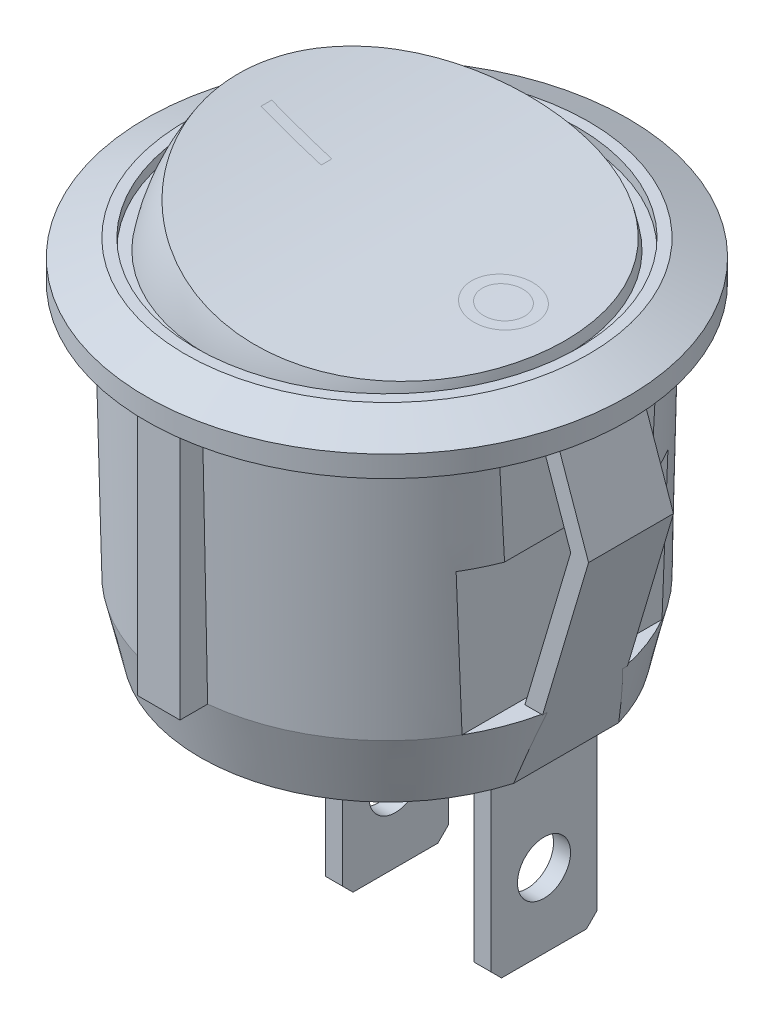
ISO-10303-21;
HEADER;
FILE_DESCRIPTION(('STEP AP214'),'2;1');
FILE_NAME('part.step','',(''),(''),'','','');
FILE_SCHEMA(('AUTOMOTIVE_DESIGN { 1 0 10303 214 1 1 1 1 }'));
ENDSEC;
DATA;
#1=APPLICATION_CONTEXT('core data for automotive mechanical design processes');
#2=APPLICATION_PROTOCOL_DEFINITION('international standard','automotive_design',2000,#1);
#3=PRODUCT_CONTEXT('',#1,'mechanical');
#4=PRODUCT('Part','Part','',(#3));
#5=PRODUCT_RELATED_PRODUCT_CATEGORY('part','',(#4));
#6=PRODUCT_DEFINITION_FORMATION('','',#4);
#7=PRODUCT_DEFINITION_CONTEXT('part definition',#1,'design');
#8=PRODUCT_DEFINITION('design','',#6,#7);
#9=PRODUCT_DEFINITION_SHAPE('','',#8);
#10=(LENGTH_UNIT() NAMED_UNIT(*) SI_UNIT(.MILLI.,.METRE.));
#11=(NAMED_UNIT(*) PLANE_ANGLE_UNIT() SI_UNIT($,.RADIAN.));
#12=(NAMED_UNIT(*) SI_UNIT($,.STERADIAN.) SOLID_ANGLE_UNIT());
#13=UNCERTAINTY_MEASURE_WITH_UNIT(LENGTH_MEASURE(1.E-05),#10,'distance_accuracy_value','');
#14=(GEOMETRIC_REPRESENTATION_CONTEXT(3) GLOBAL_UNCERTAINTY_ASSIGNED_CONTEXT((#13)) GLOBAL_UNIT_ASSIGNED_CONTEXT((#10,
#11,#12)) REPRESENTATION_CONTEXT('',''));
#15=CARTESIAN_POINT('',(0.,0.,0.));
#16=DIRECTION('',(0.,0.,1.));
#17=DIRECTION('',(1.,0.,0.));
#18=AXIS2_PLACEMENT_3D('',#15,#16,#17);
#19=CARTESIAN_POINT('',(-8.8,-15.,0.));
#20=DIRECTION('',(0.,1.,0.));
#21=DIRECTION('',(0.,0.,1.));
#22=AXIS2_PLACEMENT_3D('',#19,#20,#21);
#23=PLANE('',#22);
#24=CARTESIAN_POINT('',(0.,-15.,0.));
#25=DIRECTION('',(0.,-1.,0.));
#26=DIRECTION('',(0.,0.,-1.));
#27=AXIS2_PLACEMENT_3D('',#24,#25,#26);
#28=CIRCLE('',#27,8.8);
#29=CARTESIAN_POINT('',(8.4445096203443,-15.,2.47593563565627));
#30=VERTEX_POINT('',#29);
#31=CARTESIAN_POINT('',(-8.4445096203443,-15.,2.47593563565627));
#32=VERTEX_POINT('',#31);
#33=EDGE_CURVE('E779',#30,#32,#28,.T.);
#34=ORIENTED_EDGE('',*,*,#33,.T.);
#35=DIRECTION('',(0.,0.,1.));
#36=VECTOR('',#35,1.);
#37=CARTESIAN_POINT('',(-8.4445096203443,-15.,-11.35));
#38=LINE('',#37,#36);
#39=CARTESIAN_POINT('',(-8.4445096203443,-15.,-2.47593563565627));
#40=VERTEX_POINT('',#39);
#41=EDGE_CURVE('E947',#40,#32,#38,.T.);
#42=ORIENTED_EDGE('',*,*,#41,.F.);
#43=CARTESIAN_POINT('',(8.4445096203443,-15.,-2.47593563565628));
#44=VERTEX_POINT('',#43);
#45=EDGE_CURVE('E773',#40,#44,#28,.T.);
#46=ORIENTED_EDGE('',*,*,#45,.T.);
#47=DIRECTION('',(0.,0.,1.));
#48=VECTOR('',#47,1.);
#49=CARTESIAN_POINT('',(8.4445096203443,-15.,-11.35));
#50=LINE('',#49,#48);
#51=EDGE_CURVE('E948',#44,#30,#50,.T.);
#52=ORIENTED_EDGE('',*,*,#51,.T.);
#53=EDGE_LOOP('',(#34,#42,#46,#52));
#54=FACE_BOUND('',#53,.T.);
#55=DIRECTION('',(-1.,0.,0.));
#56=VECTOR('',#55,1.);
#57=CARTESIAN_POINT('',(0.4,-15.,-2.5));
#58=LINE('',#57,#56);
#59=CARTESIAN_POINT('',(0.4,-15.,-2.5));
#60=VERTEX_POINT('',#59);
#61=CARTESIAN_POINT('',(-0.4,-15.,-2.5));
#62=VERTEX_POINT('',#61);
#63=EDGE_CURVE('E463',#60,#62,#58,.T.);
#64=ORIENTED_EDGE('',*,*,#63,.T.);
#65=DIRECTION('',(0.,0.,1.));
#66=VECTOR('',#65,1.);
#67=CARTESIAN_POINT('',(-0.4,-15.,-2.5));
#68=LINE('',#67,#66);
#69=CARTESIAN_POINT('',(-0.4,-15.,2.5));
#70=VERTEX_POINT('',#69);
#71=EDGE_CURVE('E440',#62,#70,#68,.T.);
#72=ORIENTED_EDGE('',*,*,#71,.T.);
#73=DIRECTION('',(-1.,0.,0.));
#74=VECTOR('',#73,1.);
#75=CARTESIAN_POINT('',(0.4,-15.,2.5));
#76=LINE('',#75,#74);
#77=CARTESIAN_POINT('',(0.4,-15.,2.5));
#78=VERTEX_POINT('',#77);
#79=EDGE_CURVE('E461',#78,#70,#76,.T.);
#80=ORIENTED_EDGE('',*,*,#79,.F.);
#81=DIRECTION('',(0.,0.,1.));
#82=VECTOR('',#81,1.);
#83=CARTESIAN_POINT('',(0.4,-15.,-2.5));
#84=LINE('',#83,#82);
#85=EDGE_CURVE('E427',#60,#78,#84,.T.);
#86=ORIENTED_EDGE('',*,*,#85,.F.);
#87=EDGE_LOOP('',(#64,#72,#80,#86));
#88=FACE_BOUND('',#87,.T.);
#89=DIRECTION('',(-1.,0.,0.));
#90=VECTOR('',#89,1.);
#91=CARTESIAN_POINT('',(7.4,-15.,-2.5));
#92=LINE('',#91,#90);
#93=CARTESIAN_POINT('',(7.4,-15.,-2.5));
#94=VERTEX_POINT('',#93);
#95=CARTESIAN_POINT('',(6.6,-15.,-2.5));
#96=VERTEX_POINT('',#95);
#97=EDGE_CURVE('E95',#94,#96,#92,.T.);
#98=ORIENTED_EDGE('',*,*,#97,.T.);
#99=DIRECTION('',(0.,0.,1.));
#100=VECTOR('',#99,1.);
#101=CARTESIAN_POINT('',(6.6,-15.,-2.5));
#102=LINE('',#101,#100);
#103=CARTESIAN_POINT('',(6.6,-15.,2.5));
#104=VERTEX_POINT('',#103);
#105=EDGE_CURVE('E399',#96,#104,#102,.T.);
#106=ORIENTED_EDGE('',*,*,#105,.T.);
#107=DIRECTION('',(-1.,0.,0.));
#108=VECTOR('',#107,1.);
#109=CARTESIAN_POINT('',(7.4,-15.,2.5));
#110=LINE('',#109,#108);
#111=CARTESIAN_POINT('',(7.4,-15.,2.5));
#112=VERTEX_POINT('',#111);
#113=EDGE_CURVE('E382',#112,#104,#110,.T.);
#114=ORIENTED_EDGE('',*,*,#113,.F.);
#115=DIRECTION('',(0.,0.,1.));
#116=VECTOR('',#115,1.);
#117=CARTESIAN_POINT('',(7.4,-15.,-2.5));
#118=LINE('',#117,#116);
#119=EDGE_CURVE('E90',#94,#112,#118,.T.);
#120=ORIENTED_EDGE('',*,*,#119,.F.);
#121=EDGE_LOOP('',(#98,#106,#114,#120));
#122=FACE_BOUND('',#121,.T.);
#123=ADVANCED_FACE('F73',(#54,#88,#122),#23,.F.);
#124=CARTESIAN_POINT('',(8.39356173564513,40.4252723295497,-11.35));
#125=DIRECTION('',(0.,0.,1.));
#126=DIRECTION('',(1.,0.,0.));
#127=AXIS2_PLACEMENT_3D('',#124,#125,#126);
#128=CYLINDRICAL_SURFACE('',#127,38.6252723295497);
#129=CARTESIAN_POINT('',(-5.02842566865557,4.20701841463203,-5.53117120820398));
#130=CARTESIAN_POINT('',(-4.75794979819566,4.10678623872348,-5.84993433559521));
#131=CARTESIAN_POINT('',(-4.46254720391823,4.00076402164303,-6.14589840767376));
#132=CARTESIAN_POINT('',(-3.82782927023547,3.78292326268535,-6.68398428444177));
#133=CARTESIAN_POINT('',(-3.48849449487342,3.67110216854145,-6.92608212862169));
#134=CARTESIAN_POINT('',(-2.7579411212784,3.44273492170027,-7.35832350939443));
#135=CARTESIAN_POINT('',(-2.36511160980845,3.32619394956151,-7.54576170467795));
#136=CARTESIAN_POINT('',(-1.55050594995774,3.09960237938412,-7.84738292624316));
#137=CARTESIAN_POINT('',(-1.12873414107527,2.98955081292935,-7.9615769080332));
#138=CARTESIAN_POINT('',(-0.284572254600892,2.78509048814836,-8.10958989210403));
#139=CARTESIAN_POINT('',(0.137223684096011,2.69025506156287,-8.14621251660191));
#140=CARTESIAN_POINT('',(0.983741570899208,2.51494514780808,-8.14594797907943));
#141=CARTESIAN_POINT('',(1.40846298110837,2.4344680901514,-8.10907398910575));
#142=CARTESIAN_POINT('',(2.23852902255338,2.29128642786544,-7.96463788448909));
#143=CARTESIAN_POINT('',(2.64409461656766,2.22822265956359,-7.85868504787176));
#144=CARTESIAN_POINT('',(3.43442798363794,2.1175998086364,-7.58089609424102));
#145=CARTESIAN_POINT('',(3.81919527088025,2.07004108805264,-7.40905843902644));
#146=CARTESIAN_POINT('',(4.37417395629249,2.00923889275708,-7.1052519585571));
#147=CARTESIAN_POINT('',(4.55638556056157,1.99065687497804,-6.99559568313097));
#148=CARTESIAN_POINT('',(4.91155380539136,1.9568566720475,-6.76177117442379));
#149=CARTESIAN_POINT('',(5.08451346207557,1.94163738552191,-6.63760771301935));
#150=CARTESIAN_POINT('',(5.42012224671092,1.91425162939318,-6.37563212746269));
#151=CARTESIAN_POINT('',(5.58276682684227,1.90208649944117,-6.23781405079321));
#152=CARTESIAN_POINT('',(5.89661147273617,1.88047199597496,-5.94961405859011));
#153=CARTESIAN_POINT('',(6.0478151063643,1.87102177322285,-5.79923609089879));
#154=CARTESIAN_POINT('',(6.34297367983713,1.85417739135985,-5.48148811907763));
#155=CARTESIAN_POINT('',(6.48649269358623,1.8468663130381,-5.3137087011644));
#156=CARTESIAN_POINT('',(6.75941488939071,1.83434220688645,-4.96705612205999));
#157=CARTESIAN_POINT('',(6.8888224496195,1.82912852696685,-4.78818642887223));
#158=CARTESIAN_POINT('',(7.13285372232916,1.82038666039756,-4.42047505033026));
#159=CARTESIAN_POINT('',(7.24747049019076,1.81685926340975,-4.23162873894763));
#160=CARTESIAN_POINT('',(7.46114771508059,1.81110795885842,-3.84539273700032));
#161=CARTESIAN_POINT('',(7.56021284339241,1.80888365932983,-3.64800563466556));
#162=CARTESIAN_POINT('',(7.74570735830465,1.80531787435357,-3.23835070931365));
#163=CARTESIAN_POINT('',(7.83151853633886,1.80401288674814,-3.02580242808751));
#164=CARTESIAN_POINT('',(7.9853166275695,1.80208089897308,-2.59435385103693));
#165=CARTESIAN_POINT('',(8.05330352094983,1.8014538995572,-2.37545354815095));
#166=CARTESIAN_POINT('',(8.17106557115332,1.80059590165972,-1.93277795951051));
#167=CARTESIAN_POINT('',(8.220838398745,1.80036495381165,-1.70900205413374));
#168=CARTESIAN_POINT('',(8.30187394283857,1.80008755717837,-1.25812596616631));
#169=CARTESIAN_POINT('',(8.333136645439,1.80004110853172,-1.03102578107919));
#170=CARTESIAN_POINT('',(8.3774964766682,1.79999675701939,-0.56959283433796));
#171=CARTESIAN_POINT('',(8.39014313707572,1.80000003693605,-0.335216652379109));
#172=CARTESIAN_POINT('',(8.39577062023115,1.79999997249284,0.133688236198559));
#173=CARTESIAN_POINT('',(8.38875829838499,1.79999663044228,0.368216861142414));
#174=CARTESIAN_POINT('',(8.35511721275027,1.80001547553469,0.835963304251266));
#175=CARTESIAN_POINT('',(8.32848019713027,1.80003767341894,1.0691805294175));
#176=CARTESIAN_POINT('',(8.25575147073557,1.800228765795,1.5324784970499));
#177=CARTESIAN_POINT('',(8.20966656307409,1.80039760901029,1.76256030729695));
#178=CARTESIAN_POINT('',(8.09799449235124,1.80109031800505,2.21936489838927));
#179=CARTESIAN_POINT('',(8.03229530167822,1.80161624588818,2.44606030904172));
#180=CARTESIAN_POINT('',(7.88190071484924,1.8033159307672,2.89305549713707));
#181=CARTESIAN_POINT('',(7.79720563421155,1.80448967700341,3.11335538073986));
#182=CARTESIAN_POINT('',(7.6093477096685,1.80784762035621,3.54593813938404));
#183=CARTESIAN_POINT('',(7.50618434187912,1.81003184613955,3.75822078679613));
#184=CARTESIAN_POINT('',(7.28205947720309,1.81583327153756,4.17314654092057));
#185=CARTESIAN_POINT('',(7.16109873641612,1.81945041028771,4.37579005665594));
#186=CARTESIAN_POINT('',(6.90374390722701,1.82853056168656,4.76748812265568));
#187=CARTESIAN_POINT('',(6.7675538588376,1.83397075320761,4.95667723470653));
#188=CARTESIAN_POINT('',(6.47955103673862,1.84718283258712,5.32256664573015));
#189=CARTESIAN_POINT('',(6.32774436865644,1.85495381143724,5.49927178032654));
#190=CARTESIAN_POINT('',(6.00950765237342,1.87331589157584,5.83885687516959));
#191=CARTESIAN_POINT('',(5.84307650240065,1.88390720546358,6.00173579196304));
#192=CARTESIAN_POINT('',(5.49680549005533,1.90838539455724,6.31228603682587));
#193=CARTESIAN_POINT('',(5.31696601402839,1.92227217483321,6.45995780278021));
#194=CARTESIAN_POINT('',(4.95106235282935,1.953288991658,6.73444045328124));
#195=CARTESIAN_POINT('',(4.76537000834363,1.97030371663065,6.86176015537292));
#196=CARTESIAN_POINT('',(4.38404096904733,2.00819141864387,7.09985502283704));
#197=CARTESIAN_POINT('',(4.1884047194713,2.02906422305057,7.21063092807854));
#198=CARTESIAN_POINT('',(3.78870784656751,2.07494723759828,7.41466084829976));
#199=CARTESIAN_POINT('',(3.58464887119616,2.09995664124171,7.50791827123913));
#200=CARTESIAN_POINT('',(3.16967042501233,2.15431206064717,7.67610638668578));
#201=CARTESIAN_POINT('',(2.95875116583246,2.18365794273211,7.75103764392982));
#202=CARTESIAN_POINT('',(2.54031731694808,2.24551183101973,7.87927126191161));
#203=CARTESIAN_POINT('',(2.33300568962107,2.2778457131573,7.93332083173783));
#204=CARTESIAN_POINT('',(1.9151013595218,2.34658978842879,8.02347888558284));
#205=CARTESIAN_POINT('',(1.70450756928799,2.38300135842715,8.05958128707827));
#206=CARTESIAN_POINT('',(1.28181465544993,2.45975070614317,8.11350649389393));
#207=CARTESIAN_POINT('',(1.06971635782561,2.50008646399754,8.13133864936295));
#208=CARTESIAN_POINT('',(0.645430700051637,2.58448841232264,8.14862698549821));
#209=CARTESIAN_POINT('',(0.433243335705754,2.62855596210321,8.14807644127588));
#210=CARTESIAN_POINT('',(0.0155811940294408,2.71896448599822,8.12885321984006));
#211=CARTESIAN_POINT('',(-0.189931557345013,2.76522438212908,8.1106204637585));
#212=CARTESIAN_POINT('',(-0.598090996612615,2.86058436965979,8.05684784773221));
#213=CARTESIAN_POINT('',(-0.800736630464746,2.90968547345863,8.02130178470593));
#214=CARTESIAN_POINT('',(-1.2016626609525,3.01022136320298,7.93322986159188));
#215=CARTESIAN_POINT('',(-1.39994395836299,3.06165566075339,7.88070754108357));
#216=CARTESIAN_POINT('',(-1.79088979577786,3.16631952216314,7.75912931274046));
#217=CARTESIAN_POINT('',(-1.98355408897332,3.21954916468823,7.69007267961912));
#218=CARTESIAN_POINT('',(-2.36364664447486,3.32765106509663,7.53534065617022));
#219=CARTESIAN_POINT('',(-2.55101669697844,3.38253342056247,7.44952938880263));
#220=CARTESIAN_POINT('',(-2.91765135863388,3.49283706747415,7.26235726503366));
#221=CARTESIAN_POINT('',(-3.09691593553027,3.54825836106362,7.16099634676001));
#222=CARTESIAN_POINT('',(-3.44631458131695,3.65894829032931,6.94349142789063));
#223=CARTESIAN_POINT('',(-3.61644764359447,3.71421690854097,6.82734580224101));
#224=CARTESIAN_POINT('',(-3.94662127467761,3.82388146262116,6.58113619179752));
#225=CARTESIAN_POINT('',(-4.1066616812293,3.87827738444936,6.45107198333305));
#226=CARTESIAN_POINT('',(-4.42099531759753,3.98727861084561,6.17336155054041));
#227=CARTESIAN_POINT('',(-4.57491570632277,4.04182973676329,6.02527191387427));
#228=CARTESIAN_POINT('',(-4.87020113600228,4.1484354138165,5.71633776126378));
#229=CARTESIAN_POINT('',(-5.01157010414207,4.20049074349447,5.55549726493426));
#230=CARTESIAN_POINT('',(-5.28114907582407,4.30139275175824,5.22207245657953));
#231=CARTESIAN_POINT('',(-5.40935287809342,4.35023791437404,5.0494826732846));
#232=CARTESIAN_POINT('',(-5.65185483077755,4.44396003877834,4.69386431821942));
#233=CARTESIAN_POINT('',(-5.76615723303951,4.48883821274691,4.51083896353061));
#234=CARTESIAN_POINT('',(-5.98409264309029,4.57546132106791,4.1289735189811));
#235=CARTESIAN_POINT('',(-6.08721486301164,4.61704251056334,3.92980455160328));
#236=CARTESIAN_POINT('',(-6.27751309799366,4.69458820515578,3.52294164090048));
#237=CARTESIAN_POINT('',(-6.36468910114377,4.73055270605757,3.31524769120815));
#238=CARTESIAN_POINT('',(-6.52267147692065,4.79628168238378,2.89275714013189));
#239=CARTESIAN_POINT('',(-6.59347671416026,4.82604572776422,2.67796004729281));
#240=CARTESIAN_POINT('',(-6.71836206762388,4.87887980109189,2.24275683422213));
#241=CARTESIAN_POINT('',(-6.77244227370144,4.90194986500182,2.02235074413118));
#242=CARTESIAN_POINT('',(-6.86441033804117,4.94135340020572,1.57354931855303));
#243=CARTESIAN_POINT('',(-6.90199909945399,4.95756226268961,1.34508168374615));
#244=CARTESIAN_POINT('',(-6.95938945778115,4.98236710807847,0.885592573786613));
#245=CARTESIAN_POINT('',(-6.9791969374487,4.9909656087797,0.654571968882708));
#246=CARTESIAN_POINT('',(-7.00094958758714,5.00041064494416,0.191460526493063));
#247=CARTESIAN_POINT('',(-7.00288916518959,5.00125475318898,-0.0406306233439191));
#248=CARTESIAN_POINT('',(-6.98888173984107,4.99516997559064,-0.504167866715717));
#249=CARTESIAN_POINT('',(-6.97293489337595,4.98824115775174,-0.735613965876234));
#250=CARTESIAN_POINT('',(-6.92315660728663,4.96669736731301,-1.19695447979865));
#251=CARTESIAN_POINT('',(-6.8892689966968,4.95205825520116,-1.42684171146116));
#252=CARTESIAN_POINT('',(-6.80374986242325,4.91533647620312,-1.88268348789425));
#253=CARTESIAN_POINT('',(-6.75211842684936,4.89325384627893,-2.10863805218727));
#254=CARTESIAN_POINT('',(-6.631393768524,4.84203651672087,-2.55491644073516));
#255=CARTESIAN_POINT('',(-6.56230847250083,4.81290501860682,-2.77524277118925));
#256=CARTESIAN_POINT('',(-6.40705567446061,4.74810257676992,-3.20872296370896));
#257=CARTESIAN_POINT('',(-6.32089034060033,4.71243246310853,-3.42187773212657));
#258=CARTESIAN_POINT('',(-6.07039561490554,4.60999493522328,-3.97536691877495));
#259=CARTESIAN_POINT('',(-5.89164855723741,4.53807773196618,-4.3083805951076));
#260=CARTESIAN_POINT('',(-5.49135627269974,4.38131566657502,-4.94403644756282));
#261=CARTESIAN_POINT('',(-5.26981814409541,4.2964729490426,-5.2466836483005));
#262=CARTESIAN_POINT('',(-5.02842566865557,4.20701841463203,-5.53117120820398));
#263=B_SPLINE_CURVE_WITH_KNOTS('',3,(#129,#130,#131,#132,#133,#134,#135,#136,#137,#138,#139,
#140,#141,#142,#143,#144,#145,#146,#147,#148,#149,#150,#151,#152,#153,#154,#155,#156,#157,#158,
#159,#160,#161,#162,#163,#164,#165,#166,#167,#168,#169,#170,#171,#172,#173,#174,#175,#176,#177,
#178,#179,#180,#181,#182,#183,#184,#185,#186,#187,#188,#189,#190,#191,#192,#193,#194,#195,#196,
#197,#198,#199,#200,#201,#202,#203,#204,#205,#206,#207,#208,#209,#210,#211,#212,#213,#214,#215,
#216,#217,#218,#219,#220,#221,#222,#223,#224,#225,#226,#227,#228,#229,#230,#231,#232,#233,#234,
#235,#236,#237,#238,#239,#240,#241,#242,#243,#244,#245,#246,#247,#248,#249,#250,#251,#252,#253,
#254,#255,#256,#257,#258,#259,#260,#261,#262),.UNSPECIFIED.,.T.,.F.,(4,2,2,2,2,2,2,2,2,2,2,2,2,
2,2,2,2,2,2,2,2,2,2,2,2,2,2,2,2,2,2,2,2,2,2,2,2,2,2,2,2,2,2,2,2,2,2,2,2,2,2,2,2,2,2,2,2,2,2,2,2,
2,2,2,2,2,4),(0.,1.28850610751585,2.57758422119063,3.9225114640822,5.26723749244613,
6.56246883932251,7.85746807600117,9.12332754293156,10.389216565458,11.0290438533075,
11.6686612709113,12.3085587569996,12.9482558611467,13.6102345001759,14.2720071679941,
14.9340894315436,15.595972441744,16.2828426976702,16.9697137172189,17.6566725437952,
18.3436318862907,19.0469555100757,19.750033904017,20.4534080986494,21.1565364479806,
21.8637601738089,22.5709721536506,23.2782041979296,23.9854062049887,24.6840669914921,
25.3824556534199,26.0808969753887,26.7793181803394,27.455846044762,28.132343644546,
28.8087095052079,29.4850545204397,30.1342616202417,30.7836885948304,31.4327830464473,
32.082114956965,32.7156957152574,33.3495036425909,33.9831795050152,34.6168831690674,
35.2559571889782,35.8950337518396,36.5341806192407,37.1733377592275,37.8339340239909,
38.4943228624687,39.1550213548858,39.8155172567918,40.499036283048,41.1825558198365,
41.8661227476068,42.5496860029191,43.2451801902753,43.9404441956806,44.6359258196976,
45.3314013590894,46.0290673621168,46.7267299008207,47.424076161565,48.1213339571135,
49.2714817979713,50.4214390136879),.UNSPECIFIED.);
#264=CARTESIAN_POINT('',(-5.02842566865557,4.20701841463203,-5.53117120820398));
#265=VERTEX_POINT('',#264);
#266=EDGE_CURVE('E466',#265,#265,#263,.T.);
#267=ORIENTED_EDGE('',*,*,#266,.F.);
#268=EDGE_LOOP('',(#267));
#269=FACE_BOUND('',#268,.T.);
#270=CARTESIAN_POINT('',(6.98703458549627,1.8256176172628,0.));
#271=CARTESIAN_POINT('',(6.98693761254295,1.82562118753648,0.0214461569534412));
#272=CARTESIAN_POINT('',(6.98636255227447,1.82564210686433,0.0428896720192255));
#273=CARTESIAN_POINT('',(6.9842666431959,1.82571855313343,0.0858063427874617));
#274=CARTESIAN_POINT('',(6.98274246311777,1.82577420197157,0.107279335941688));
#275=CARTESIAN_POINT('',(6.97874872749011,1.82592038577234,0.150254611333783));
#276=CARTESIAN_POINT('',(6.97627406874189,1.82601110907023,0.171756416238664));
#277=CARTESIAN_POINT('',(6.97038117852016,1.82622793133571,0.214790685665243));
#278=CARTESIAN_POINT('',(6.96695618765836,1.82635428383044,0.23632222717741));
#279=CARTESIAN_POINT('',(6.96112675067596,1.82657032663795,0.268565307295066));
#280=CARTESIAN_POINT('',(6.9590603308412,1.82664705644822,0.279339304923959));
#281=CARTESIAN_POINT('',(6.95362649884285,1.82684930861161,0.306144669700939));
#282=CARTESIAN_POINT('',(6.95012009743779,1.82698023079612,0.322148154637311));
#283=CARTESIAN_POINT('',(6.94260767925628,1.82726190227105,0.354017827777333));
#284=CARTESIAN_POINT('',(6.93860222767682,1.82741262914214,0.369884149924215));
#285=CARTESIAN_POINT('',(6.92867349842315,1.82778799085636,0.406748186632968));
#286=CARTESIAN_POINT('',(6.92255594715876,1.82802051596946,0.427693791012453));
#287=CARTESIAN_POINT('',(6.90943460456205,1.82852282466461,0.469342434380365));
#288=CARTESIAN_POINT('',(6.9024294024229,1.82879266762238,0.490045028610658));
#289=CARTESIAN_POINT('',(6.89126949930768,1.8292259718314,0.520887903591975));
#290=CARTESIAN_POINT('',(6.88743594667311,1.829375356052,0.53114565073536));
#291=CARTESIAN_POINT('',(6.87954710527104,1.82968400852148,0.55160050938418));
#292=CARTESIAN_POINT('',(6.8754913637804,1.82984329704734,0.56179744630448));
#293=CARTESIAN_POINT('',(6.86707833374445,1.8301751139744,0.582333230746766));
#294=CARTESIAN_POINT('',(6.86271632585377,1.83034785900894,0.592670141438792));
#295=CARTESIAN_POINT('',(6.8537998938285,1.83070255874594,0.613193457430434));
#296=CARTESIAN_POINT('',(6.84924664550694,1.83088445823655,0.623380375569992));
#297=CARTESIAN_POINT('',(6.83533019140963,1.83144299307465,0.653643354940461));
#298=CARTESIAN_POINT('',(6.82564802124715,1.83183491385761,0.673573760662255));
#299=CARTESIAN_POINT('',(6.80550859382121,1.83265839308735,0.712829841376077));
#300=CARTESIAN_POINT('',(6.79505840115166,1.83308959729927,0.73215915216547));
#301=CARTESIAN_POINT('',(6.77338418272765,1.8339934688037,0.770214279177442));
#302=CARTESIAN_POINT('',(6.76216555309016,1.83446585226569,0.788943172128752));
#303=CARTESIAN_POINT('',(6.73895637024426,1.83545401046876,0.82579781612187));
#304=CARTESIAN_POINT('',(6.72696951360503,1.83596958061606,0.843925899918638));
#305=CARTESIAN_POINT('',(6.70222576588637,1.83704617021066,0.879579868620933));
#306=CARTESIAN_POINT('',(6.68947088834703,1.83760707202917,0.897107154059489));
#307=CARTESIAN_POINT('',(6.66319256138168,1.83877653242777,0.9315601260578));
#308=CARTESIAN_POINT('',(6.64966950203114,1.83938506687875,0.948486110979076));
#309=CARTESIAN_POINT('',(6.62185787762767,1.84065205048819,0.981738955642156));
#310=CARTESIAN_POINT('',(6.60756818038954,1.84131057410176,0.99806486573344));
#311=CARTESIAN_POINT('',(6.57821997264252,1.84268022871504,1.03011385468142));
#312=CARTESIAN_POINT('',(6.56315892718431,1.84339153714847,1.04583460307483));
#313=CARTESIAN_POINT('',(6.53226250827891,1.84486967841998,1.07671892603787));
#314=CARTESIAN_POINT('',(6.51642236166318,1.8456368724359,1.09187770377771));
#315=CARTESIAN_POINT('',(6.48419353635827,1.84721853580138,1.12141363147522));
#316=CARTESIAN_POINT('',(6.4678084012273,1.84803271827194,1.13579466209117));
#317=CARTESIAN_POINT('',(6.43448616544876,1.84971060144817,1.16377100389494));
#318=CARTESIAN_POINT('',(6.41755133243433,1.85057410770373,1.17736902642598));
#319=CARTESIAN_POINT('',(6.38313245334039,1.85235264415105,1.20378196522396));
#320=CARTESIAN_POINT('',(6.36564944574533,1.85326757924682,1.21659824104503));
#321=CARTESIAN_POINT('',(6.33013525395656,1.85515112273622,1.24144869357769));
#322=CARTESIAN_POINT('',(6.31210399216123,1.85611973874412,1.25348275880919));
#323=CARTESIAN_POINT('',(6.27549459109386,1.85811284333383,1.27677042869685));
#324=CARTESIAN_POINT('',(6.25691539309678,1.8591374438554,1.28802235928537));
#325=CARTESIAN_POINT('',(6.21921142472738,1.86124477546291,1.30974715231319));
#326=CARTESIAN_POINT('',(6.20008477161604,1.8623277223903,1.3202167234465));
#327=CARTESIAN_POINT('',(6.16128610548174,1.8645541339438,1.34037902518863));
#328=CARTESIAN_POINT('',(6.14161155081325,1.86569791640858,1.35006683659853));
#329=CARTESIAN_POINT('',(6.11175238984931,1.86745718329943,1.36398797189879));
#330=CARTESIAN_POINT('',(6.10171313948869,1.86805258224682,1.36853834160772));
#331=CARTESIAN_POINT('',(6.08149863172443,1.86925944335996,1.377445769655));
#332=CARTESIAN_POINT('',(6.07132297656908,1.8698709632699,1.38180191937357));
#333=CARTESIAN_POINT('',(6.05096120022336,1.87110279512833,1.39026300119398));
#334=CARTESIAN_POINT('',(6.04077577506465,1.87172300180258,1.39436962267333));
#335=CARTESIAN_POINT('',(6.02035490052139,1.87297465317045,1.40234438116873));
#336=CARTESIAN_POINT('',(6.01011975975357,1.87360604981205,1.40621331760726));
#337=CARTESIAN_POINT('',(5.97938294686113,1.8755145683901,1.41744851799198));
#338=CARTESIAN_POINT('',(5.95875920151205,1.87681150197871,1.42448089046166));
#339=CARTESIAN_POINT('',(5.91731295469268,1.87945175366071,1.43759377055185));
#340=CARTESIAN_POINT('',(5.89649169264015,1.88079484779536,1.44367824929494));
#341=CARTESIAN_POINT('',(5.85465049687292,1.8835283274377,1.45489768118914));
#342=CARTESIAN_POINT('',(5.8336311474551,1.88491859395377,1.46003483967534));
#343=CARTESIAN_POINT('',(5.79139475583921,1.88774727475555,1.46936123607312));
#344=CARTESIAN_POINT('',(5.77017779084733,1.88918567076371,1.47355082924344));
#345=CARTESIAN_POINT('',(5.72754671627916,1.89211149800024,1.48098410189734));
#346=CARTESIAN_POINT('',(5.70613234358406,1.89359900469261,1.48422624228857));
#347=CARTESIAN_POINT('',(5.66310691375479,1.89662395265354,1.48976617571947));
#348=CARTESIAN_POINT('',(5.64149542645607,1.89816155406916,1.49206053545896));
#349=CARTESIAN_POINT('',(5.59807600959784,1.90128761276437,1.49570801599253));
#350=CARTESIAN_POINT('',(5.5762676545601,1.90287630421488,1.49705586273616));
#351=CARTESIAN_POINT('',(5.53245467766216,1.90610547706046,1.4988075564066));
#352=CARTESIAN_POINT('',(5.51044979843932,1.90774625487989,1.49920433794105));
#353=CARTESIAN_POINT('',(5.4663781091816,1.9110704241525,1.49907332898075));
#354=CARTESIAN_POINT('',(5.44431131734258,1.91275393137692,1.49854268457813));
#355=CARTESIAN_POINT('',(5.40039248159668,1.91614248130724,1.49655337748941));
#356=CARTESIAN_POINT('',(5.37854009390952,1.91784725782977,1.49510190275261));
#357=CARTESIAN_POINT('',(5.33505050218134,1.92127715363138,1.49126781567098));
#358=CARTESIAN_POINT('',(5.3134127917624,1.92300209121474,1.48889080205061));
#359=CARTESIAN_POINT('',(5.27035261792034,1.92647115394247,1.48320854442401));
#360=CARTESIAN_POINT('',(5.24892963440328,1.92821517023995,1.47990717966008));
#361=CARTESIAN_POINT('',(5.2062989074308,1.93172125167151,1.47237764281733));
#362=CARTESIAN_POINT('',(5.18509078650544,1.9334832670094,1.46815158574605));
#363=CARTESIAN_POINT('',(5.14288951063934,1.93702424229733,1.45877453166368));
#364=CARTESIAN_POINT('',(5.12189628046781,1.93880319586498,1.45362387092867));
#365=CARTESIAN_POINT('',(5.08012468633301,1.94237693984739,1.44239940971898));
#366=CARTESIAN_POINT('',(5.05934670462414,1.94417175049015,1.43632419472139));
#367=CARTESIAN_POINT('',(5.01800410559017,1.94777624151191,1.42325224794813));
#368=CARTESIAN_POINT('',(4.99744046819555,1.9495859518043,1.41625241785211));
#369=CARTESIAN_POINT('',(4.96679962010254,1.95230689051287,1.405078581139));
#370=CARTESIAN_POINT('',(4.95660102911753,1.95321665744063,1.40123371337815));
#371=CARTESIAN_POINT('',(4.93625667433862,1.95503956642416,1.39331471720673));
#372=CARTESIAN_POINT('',(4.92611117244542,1.95595271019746,1.3892399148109));
#373=CARTESIAN_POINT('',(4.90596666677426,1.95777377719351,1.38089417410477));
#374=CARTESIAN_POINT('',(4.89596716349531,1.95868170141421,1.37662444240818));
#375=CARTESIAN_POINT('',(4.87609202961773,1.96049404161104,1.36787515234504));
#376=CARTESIAN_POINT('',(4.86621614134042,1.96139846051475,1.3633961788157));
#377=CARTESIAN_POINT('',(4.8368004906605,1.9641036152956,1.34965889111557));
#378=CARTESIAN_POINT('',(4.81741133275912,1.96590180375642,1.34007478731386));
#379=CARTESIAN_POINT('',(4.77912721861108,1.96948089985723,1.3200704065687));
#380=CARTESIAN_POINT('',(4.760231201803,1.97126183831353,1.30965216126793));
#381=CARTESIAN_POINT('',(4.72293141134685,1.97480436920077,1.28798114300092));
#382=CARTESIAN_POINT('',(4.7045274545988,1.97656596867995,1.2767286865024));
#383=CARTESIAN_POINT('',(4.66821099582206,1.98006771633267,1.25339099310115));
#384=CARTESIAN_POINT('',(4.65029933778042,1.98180782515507,1.24130443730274));
#385=CARTESIAN_POINT('',(4.61496616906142,1.98526459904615,1.21630016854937));
#386=CARTESIAN_POINT('',(4.59754665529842,1.98698115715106,1.2033796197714));
#387=CARTESIAN_POINT('',(4.56319650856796,1.99038889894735,1.17670881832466));
#388=CARTESIAN_POINT('',(4.54626912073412,1.99207988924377,1.16295436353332));
#389=CARTESIAN_POINT('',(4.51290160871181,1.99543466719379,1.13461722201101));
#390=CARTESIAN_POINT('',(4.49646603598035,1.99709815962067,1.12002914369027));
#391=CARTESIAN_POINT('',(4.4640813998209,2.00039608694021,1.09002534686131));
#392=CARTESIAN_POINT('',(4.4481382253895,2.00203011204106,1.07460323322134));
#393=CARTESIAN_POINT('',(4.41690011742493,2.00525057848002,1.04310171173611));
#394=CARTESIAN_POINT('',(4.40160538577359,2.0068370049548,1.02702210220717));
#395=CARTESIAN_POINT('',(4.3718492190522,2.00994058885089,0.994370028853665));
#396=CARTESIAN_POINT('',(4.35738148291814,2.01145824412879,0.977803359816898));
#397=CARTESIAN_POINT('',(4.32927893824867,2.0144214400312,0.944177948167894));
#398=CARTESIAN_POINT('',(4.31563880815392,2.01586742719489,0.927123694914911));
#399=CARTESIAN_POINT('',(4.2891899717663,2.01868473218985,0.892524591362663));
#400=CARTESIAN_POINT('',(4.27637711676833,2.02005641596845,0.874982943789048));
#401=CARTESIAN_POINT('',(4.25158141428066,2.02272272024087,0.839410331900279));
#402=CARTESIAN_POINT('',(4.2395957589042,2.02401759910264,0.82138134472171));
#403=CARTESIAN_POINT('',(4.21645279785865,2.02652809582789,0.784835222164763));
#404=CARTESIAN_POINT('',(4.20529417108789,2.02774383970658,0.766318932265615));
#405=CARTESIAN_POINT('',(4.18380359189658,2.03009404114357,0.728799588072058));
#406=CARTESIAN_POINT('',(4.17347191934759,2.03122847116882,0.709796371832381));
#407=CARTESIAN_POINT('',(4.15363314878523,2.03341423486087,0.67130318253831));
#408=CARTESIAN_POINT('',(4.1441280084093,2.03446537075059,0.651812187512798));
#409=CARTESIAN_POINT('',(4.13050334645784,2.03597672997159,0.622247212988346));
#410=CARTESIAN_POINT('',(4.12606112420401,2.03647031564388,0.612322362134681));
#411=CARTESIAN_POINT('',(4.11738283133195,2.03743603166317,0.592350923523));
#412=CARTESIAN_POINT('',(4.11314732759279,2.03790810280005,0.582304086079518));
#413=CARTESIAN_POINT('',(4.10488474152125,2.03883032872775,0.562100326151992));
#414=CARTESIAN_POINT('',(4.10085809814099,2.03928043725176,0.551943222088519));
#415=CARTESIAN_POINT('',(4.09303500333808,2.04015610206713,0.531572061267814));
#416=CARTESIAN_POINT('',(4.08923794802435,2.0405817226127,0.521358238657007));
#417=CARTESIAN_POINT('',(4.078203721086,2.04182013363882,0.490661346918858));
#418=CARTESIAN_POINT('',(4.07129654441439,2.04259748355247,0.47005700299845));
#419=CARTESIAN_POINT('',(4.0584053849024,2.04405134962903,0.428619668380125));
#420=CARTESIAN_POINT('',(4.05241896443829,2.04472813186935,0.407787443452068));
#421=CARTESIAN_POINT('',(4.04136722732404,2.04597978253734,0.365894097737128));
#422=CARTESIAN_POINT('',(4.03630120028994,2.04655472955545,0.344833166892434));
#423=CARTESIAN_POINT('',(4.02708842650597,2.04760180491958,0.302483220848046));
#424=CARTESIAN_POINT('',(4.02294275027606,2.04807381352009,0.281193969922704));
#425=CARTESIAN_POINT('',(4.01556885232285,2.04891431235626,0.238387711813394));
#426=CARTESIAN_POINT('',(4.0123434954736,2.04928247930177,0.216870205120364));
#427=CARTESIAN_POINT('',(4.00680803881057,2.04991484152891,0.173607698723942));
#428=CARTESIAN_POINT('',(4.00450256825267,2.05017851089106,0.151862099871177));
#429=CARTESIAN_POINT('',(4.0008063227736,2.05060143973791,0.108143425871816));
#430=CARTESIAN_POINT('',(3.99942188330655,2.05075997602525,0.0861698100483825));
#431=CARTESIAN_POINT('',(3.99756129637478,2.05097307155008,0.0419951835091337));
#432=CARTESIAN_POINT('',(3.99709304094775,2.05102672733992,0.019793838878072));
#433=CARTESIAN_POINT('',(3.99708110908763,2.05102809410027,-0.0245247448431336));
#434=CARTESIAN_POINT('',(3.99753391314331,2.05097620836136,-0.0466419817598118));
#435=CARTESIAN_POINT('',(3.99939160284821,2.05076344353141,-0.0906607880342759));
#436=CARTESIAN_POINT('',(4.00078891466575,2.05060343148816,-0.112562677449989));
#437=CARTESIAN_POINT('',(4.00452924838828,2.05017545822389,-0.156150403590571));
#438=CARTESIAN_POINT('',(4.00686646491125,2.04990815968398,-0.17783674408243));
#439=CARTESIAN_POINT('',(4.01248614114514,2.04926619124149,-0.220993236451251));
#440=CARTESIAN_POINT('',(4.0157646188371,2.04889197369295,-0.24246391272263));
#441=CARTESIAN_POINT('',(4.02326468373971,2.04803714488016,-0.285189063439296));
#442=CARTESIAN_POINT('',(4.02748417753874,2.04755676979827,-0.306443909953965));
#443=CARTESIAN_POINT('',(4.03686460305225,2.04649075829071,-0.348737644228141));
#444=CARTESIAN_POINT('',(4.04202534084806,2.04590514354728,-0.369776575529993));
#445=CARTESIAN_POINT('',(4.05328627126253,2.04463002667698,-0.411638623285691));
#446=CARTESIAN_POINT('',(4.05938813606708,2.04394033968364,-0.432461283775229));
#447=CARTESIAN_POINT('',(4.07253028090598,2.04245855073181,-0.473892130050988));
#448=CARTESIAN_POINT('',(4.07957402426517,2.04166607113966,-0.494499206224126));
#449=CARTESIAN_POINT('',(4.09082361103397,2.04040393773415,-0.525201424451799));
#450=CARTESIAN_POINT('',(4.09469609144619,2.03997002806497,-0.535421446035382));
#451=CARTESIAN_POINT('',(4.10267661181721,2.03907710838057,-0.555807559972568));
#452=CARTESIAN_POINT('',(4.10678539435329,2.03861801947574,-0.565973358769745));
#453=CARTESIAN_POINT('',(4.11523789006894,2.03767503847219,-0.58626428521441));
#454=CARTESIAN_POINT('',(4.11958265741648,2.03719103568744,-0.596388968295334));
#455=CARTESIAN_POINT('',(4.12846758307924,2.0362028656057,-0.616507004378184));
#456=CARTESIAN_POINT('',(4.1330069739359,2.03569877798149,-0.626500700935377));
#457=CARTESIAN_POINT('',(4.14690010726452,2.03415858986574,-0.656240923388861));
#458=CARTESIAN_POINT('',(4.15656784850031,2.03309020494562,-0.675840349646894));
#459=CARTESIAN_POINT('',(4.17669098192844,2.03087474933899,-0.714511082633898));
#460=CARTESIAN_POINT('',(4.18714256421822,2.02972806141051,-0.733584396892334));
#461=CARTESIAN_POINT('',(4.2088325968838,2.02735802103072,-0.771204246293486));
#462=CARTESIAN_POINT('',(4.22006882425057,2.02613488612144,-0.789752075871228));
#463=CARTESIAN_POINT('',(4.24332656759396,2.02361419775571,-0.826321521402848));
#464=CARTESIAN_POINT('',(4.25534741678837,2.0223167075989,-0.844343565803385));
#465=CARTESIAN_POINT('',(4.28017320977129,2.019649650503,-0.879862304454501));
#466=CARTESIAN_POINT('',(4.2929789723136,2.01828000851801,-0.897358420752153));
#467=CARTESIAN_POINT('',(4.31937299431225,2.01547116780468,-0.93182665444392));
#468=CARTESIAN_POINT('',(4.33296345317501,2.01403177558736,-0.948797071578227));
#469=CARTESIAN_POINT('',(4.36092706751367,2.01108590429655,-0.982213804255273));
#470=CARTESIAN_POINT('',(4.37530367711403,2.0095791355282,-0.998657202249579));
#471=CARTESIAN_POINT('',(4.40483371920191,2.00650174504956,-1.03102581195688));
#472=CARTESIAN_POINT('',(4.4199916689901,2.00493076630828,-1.04694686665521));
#473=CARTESIAN_POINT('',(4.45087743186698,2.00174903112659,-1.0780282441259));
#474=CARTESIAN_POINT('',(4.46660117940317,2.00013857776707,-1.0931926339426));
#475=CARTESIAN_POINT('',(4.4986161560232,1.99688023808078,-1.12272026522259));
#476=CARTESIAN_POINT('',(4.51490369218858,1.9952326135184,-1.13708753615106));
#477=CARTESIAN_POINT('',(4.54804016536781,1.99190267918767,-1.16502687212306));
#478=CARTESIAN_POINT('',(4.56488680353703,1.99022052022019,-1.17860168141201));
#479=CARTESIAN_POINT('',(4.59914158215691,1.98682368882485,-1.20495612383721));
#480=CARTESIAN_POINT('',(4.61654870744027,1.98510907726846,-1.21773708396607));
#481=CARTESIAN_POINT('',(4.65192300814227,1.98164973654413,-1.24250562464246));
#482=CARTESIAN_POINT('',(4.66989034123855,1.97990499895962,-1.25449297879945));
#483=CARTESIAN_POINT('',(4.70638425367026,1.97638780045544,-1.27767581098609));
#484=CARTESIAN_POINT('',(4.72491201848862,1.97461528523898,-1.28886941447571));
#485=CARTESIAN_POINT('',(4.76252570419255,1.97104501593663,-1.31046638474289));
#486=CARTESIAN_POINT('',(4.78161367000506,1.96924718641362,-1.32086617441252));
#487=CARTESIAN_POINT('',(4.82034809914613,1.9656287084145,-1.34087739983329));
#488=CARTESIAN_POINT('',(4.83999729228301,1.96380798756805,-1.35048354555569));
#489=CARTESIAN_POINT('',(4.86982508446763,1.9610676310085,-1.36427368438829));
#490=CARTESIAN_POINT('',(4.87985641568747,1.96014994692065,-1.36877942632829));
#491=CARTESIAN_POINT('',(4.9000592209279,1.95830980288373,-1.37759305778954));
#492=CARTESIAN_POINT('',(4.91023112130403,1.95738733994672,-1.38189997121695));
#493=CARTESIAN_POINT('',(4.93067670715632,1.95554143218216,-1.39030423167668));
#494=CARTESIAN_POINT('',(4.94095050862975,1.95461798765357,-1.3944012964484));
#495=CARTESIAN_POINT('',(4.96153675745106,1.95277600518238,-1.40236101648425));
#496=CARTESIAN_POINT('',(4.97184883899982,1.95185746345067,-1.40622461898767));
#497=CARTESIAN_POINT('',(5.00278695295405,1.94911431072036,-1.4174419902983));
#498=CARTESIAN_POINT('',(5.02353225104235,1.94729156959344,-1.4244706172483));
#499=CARTESIAN_POINT('',(5.06517925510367,1.94366676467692,-1.4375848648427));
#500=CARTESIAN_POINT('',(5.08607922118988,1.94186464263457,-1.4436760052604));
#501=CARTESIAN_POINT('',(5.1280357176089,1.93828175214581,-1.45491694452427));
#502=CARTESIAN_POINT('',(5.1490911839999,1.93650092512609,-1.46007068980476));
#503=CARTESIAN_POINT('',(5.19135776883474,1.93296139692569,-1.46943842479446));
#504=CARTESIAN_POINT('',(5.21256838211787,1.93120265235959,-1.47365467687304));
#505=CARTESIAN_POINT('',(5.25514479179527,1.92770802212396,-1.48114908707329));
#506=CARTESIAN_POINT('',(5.27651049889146,1.92597212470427,-1.48442774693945));
#507=CARTESIAN_POINT('',(5.31939667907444,1.92252391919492,-1.49004901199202));
#508=CARTESIAN_POINT('',(5.34091732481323,1.92081164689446,-1.49239032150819));
#509=CARTESIAN_POINT('',(5.38411318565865,1.91741140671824,-1.49613771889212));
#510=CARTESIAN_POINT('',(5.40578867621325,1.91572353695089,-1.49754071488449));
#511=CARTESIAN_POINT('',(5.44929402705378,1.91237281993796,-1.49941692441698));
#512=CARTESIAN_POINT('',(5.47112410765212,1.91071014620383,-1.49988531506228));
#513=CARTESIAN_POINT('',(5.51472615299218,1.90742653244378,-1.49988033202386));
#514=CARTESIAN_POINT('',(5.53649810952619,1.90580548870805,-1.49940958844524));
#515=CARTESIAN_POINT('',(5.57990086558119,1.90261086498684,-1.49750707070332));
#516=CARTESIAN_POINT('',(5.60153184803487,1.90103709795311,-1.49607981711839));
#517=CARTESIAN_POINT('',(5.64465231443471,1.89793624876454,-1.4922697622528));
#518=CARTESIAN_POINT('',(5.66614202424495,1.89640904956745,-1.48988961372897));
#519=CARTESIAN_POINT('',(5.70897983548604,1.89340054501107,-1.48417467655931));
#520=CARTESIAN_POINT('',(5.73032803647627,1.89191920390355,-1.48084065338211));
#521=CARTESIAN_POINT('',(5.77288285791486,1.88900162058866,-1.47322013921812));
#522=CARTESIAN_POINT('',(5.79408928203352,1.88756543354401,-1.4689325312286));
#523=CARTESIAN_POINT('',(5.83636083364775,1.88473735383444,-1.45940663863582));
#524=CARTESIAN_POINT('',(5.85742530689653,1.88334561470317,-1.45416540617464));
#525=CARTESIAN_POINT('',(5.89941310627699,1.88060564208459,-1.44273418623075));
#526=CARTESIAN_POINT('',(5.92033517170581,1.87925766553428,-1.43653951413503));
#527=CARTESIAN_POINT('',(5.96203956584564,1.87660436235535,-1.423202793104));
#528=CARTESIAN_POINT('',(5.98281990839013,1.87529939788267,-1.4160544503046));
#529=CARTESIAN_POINT('',(6.01381407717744,1.87337780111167,-1.40464908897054));
#530=CARTESIAN_POINT('',(6.024148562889,1.8727412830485,-1.40071993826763));
#531=CARTESIAN_POINT('',(6.04478266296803,1.87147865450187,-1.39262467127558));
#532=CARTESIAN_POINT('',(6.05508187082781,1.87085260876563,-1.38845750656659));
#533=CARTESIAN_POINT('',(6.07562080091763,1.8696123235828,-1.37989550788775));
#534=CARTESIAN_POINT('',(6.08586026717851,1.86899812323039,-1.37550005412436));
#535=CARTESIAN_POINT('',(6.10619153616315,1.86778663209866,-1.36651309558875));
#536=CARTESIAN_POINT('',(6.1162838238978,1.8671892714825,-1.36192269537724));
#537=CARTESIAN_POINT('',(6.14627441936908,1.86542583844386,-1.34788806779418));
#538=CARTESIAN_POINT('',(6.16602497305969,1.86428005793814,-1.33812273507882));
#539=CARTESIAN_POINT('',(6.20493372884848,1.86205219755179,-1.31780554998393));
#540=CARTESIAN_POINT('',(6.22409523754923,1.86096970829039,-1.30726006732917));
#541=CARTESIAN_POINT('',(6.26182709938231,1.8588656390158,-1.28538397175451));
#542=CARTESIAN_POINT('',(6.28040013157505,1.85784375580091,-1.27405801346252));
#543=CARTESIAN_POINT('',(6.31695528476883,1.85585825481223,-1.25062280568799));
#544=CARTESIAN_POINT('',(6.33493927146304,1.85489444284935,-1.23851648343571));
#545=CARTESIAN_POINT('',(6.37031708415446,1.85302249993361,-1.21352226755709));
#546=CARTESIAN_POINT('',(6.38771177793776,1.85211428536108,-1.20063560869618));
#547=CARTESIAN_POINT('',(6.42191188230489,1.85035103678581,-1.17408244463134));
#548=CARTESIAN_POINT('',(6.43871699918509,1.84949602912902,-1.16041555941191));
#549=CARTESIAN_POINT('',(6.47173894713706,1.84783677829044,-1.13230347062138));
#550=CARTESIAN_POINT('',(6.48795418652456,1.84703266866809,-1.11785638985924));
#551=CARTESIAN_POINT('',(6.51979776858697,1.84547286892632,-1.08818566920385));
#552=CARTESIAN_POINT('',(6.53542312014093,1.84471741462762,-1.07295880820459));
#553=CARTESIAN_POINT('',(6.56593600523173,1.84325995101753,-1.04188299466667));
#554=CARTESIAN_POINT('',(6.5808258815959,1.84255776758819,-1.02603635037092));
#555=CARTESIAN_POINT('',(6.60993088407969,1.84120131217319,-0.993667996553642));
#556=CARTESIAN_POINT('',(6.62414439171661,1.84054715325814,-0.9771448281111));
#557=CARTESIAN_POINT('',(6.65538684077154,1.83912567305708,-0.939185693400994));
#558=CARTESIAN_POINT('',(6.67220476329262,1.83837226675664,-0.91757513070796));
#559=CARTESIAN_POINT('',(6.70479267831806,1.83693225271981,-0.87330358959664));
#560=CARTESIAN_POINT('',(6.72055301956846,1.83624623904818,-0.850635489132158));
#561=CARTESIAN_POINT('',(6.74472443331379,1.83520781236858,-0.813846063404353));
#562=CARTESIAN_POINT('',(6.75352715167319,1.8348328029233,-0.799980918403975));
#563=CARTESIAN_POINT('',(6.77067576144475,1.83410783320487,-0.772006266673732));
#564=CARTESIAN_POINT('',(6.77902249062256,1.83375782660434,-0.757897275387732));
#565=CARTESIAN_POINT('',(6.7979639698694,1.83296937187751,-0.724694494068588));
#566=CARTESIAN_POINT('',(6.80838491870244,1.8325401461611,-0.70550107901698));
#567=CARTESIAN_POINT('',(6.8284157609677,1.83172259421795,-0.666680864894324));
#568=CARTESIAN_POINT('',(6.83802520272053,1.83133429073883,-0.647053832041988));
#569=CARTESIAN_POINT('',(6.85182290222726,1.8307814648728,-0.617310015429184));
#570=CARTESIAN_POINT('',(6.85632268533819,1.83060199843,-0.607336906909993));
#571=CARTESIAN_POINT('',(6.86511948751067,1.83025262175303,-0.587282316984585));
#572=CARTESIAN_POINT('',(6.86941617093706,1.83008272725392,-0.577200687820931));
#573=CARTESIAN_POINT('',(6.87784623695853,1.82975073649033,-0.556840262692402));
#574=CARTESIAN_POINT('',(6.88197732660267,1.82958874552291,-0.546560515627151));
#575=CARTESIAN_POINT('',(6.88999987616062,1.82927538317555,-0.525974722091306));
#576=CARTESIAN_POINT('',(6.8938925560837,1.82912395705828,-0.515669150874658));
#577=CARTESIAN_POINT('',(6.9051823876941,1.82868639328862,-0.484788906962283));
#578=CARTESIAN_POINT('',(6.91225606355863,1.82841442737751,-0.464094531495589));
#579=CARTESIAN_POINT('',(6.92543915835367,1.8279107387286,-0.422598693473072));
#580=CARTESIAN_POINT('',(6.93155641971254,1.82767868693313,-0.401799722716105));
#581=CARTESIAN_POINT('',(6.94282828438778,1.82725338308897,-0.360094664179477));
#582=CARTESIAN_POINT('',(6.94798919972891,1.82705987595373,-0.339190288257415));
#583=CARTESIAN_POINT('',(6.95734986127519,1.82671044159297,-0.297275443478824));
#584=CARTESIAN_POINT('',(6.96155423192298,1.82655433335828,-0.276266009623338));
#585=CARTESIAN_POINT('',(6.96900349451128,1.82627868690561,-0.234141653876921));
#586=CARTESIAN_POINT('',(6.97225119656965,1.82615904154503,-0.213027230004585));
#587=CARTESIAN_POINT('',(6.97778906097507,1.82595552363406,-0.17069341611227));
#588=CARTESIAN_POINT('',(6.98008013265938,1.82587161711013,-0.14947414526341));
#589=CARTESIAN_POINT('',(6.98370621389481,1.82573899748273,-0.106931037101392));
#590=CARTESIAN_POINT('',(6.98504019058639,1.82569032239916,-0.0856071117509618));
#591=CARTESIAN_POINT('',(6.98675563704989,1.82562778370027,-0.0428546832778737));
#592=CARTESIAN_POINT('',(6.98713414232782,1.82561402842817,-0.0214260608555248));
#593=CARTESIAN_POINT('',(6.98703458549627,1.8256176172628,0.));
#594=B_SPLINE_CURVE_WITH_KNOTS('',3,(#270,#271,#272,#273,#274,#275,#276,#277,#278,#279,#280,
#281,#282,#283,#284,#285,#286,#287,#288,#289,#290,#291,#292,#293,#294,#295,#296,#297,#298,#299,
#300,#301,#302,#303,#304,#305,#306,#307,#308,#309,#310,#311,#312,#313,#314,#315,#316,#317,#318,
#319,#320,#321,#322,#323,#324,#325,#326,#327,#328,#329,#330,#331,#332,#333,#334,#335,#336,#337,
#338,#339,#340,#341,#342,#343,#344,#345,#346,#347,#348,#349,#350,#351,#352,#353,#354,#355,#356,
#357,#358,#359,#360,#361,#362,#363,#364,#365,#366,#367,#368,#369,#370,#371,#372,#373,#374,#375,
#376,#377,#378,#379,#380,#381,#382,#383,#384,#385,#386,#387,#388,#389,#390,#391,#392,#393,#394,
#395,#396,#397,#398,#399,#400,#401,#402,#403,#404,#405,#406,#407,#408,#409,#410,#411,#412,#413,
#414,#415,#416,#417,#418,#419,#420,#421,#422,#423,#424,#425,#426,#427,#428,#429,#430,#431,#432,
#433,#434,#435,#436,#437,#438,#439,#440,#441,#442,#443,#444,#445,#446,#447,#448,#449,#450,#451,
#452,#453,#454,#455,#456,#457,#458,#459,#460,#461,#462,#463,#464,#465,#466,#467,#468,#469,#470,
#471,#472,#473,#474,#475,#476,#477,#478,#479,#480,#481,#482,#483,#484,#485,#486,#487,#488,#489,
#490,#491,#492,#493,#494,#495,#496,#497,#498,#499,#500,#501,#502,#503,#504,#505,#506,#507,#508,
#509,#510,#511,#512,#513,#514,#515,#516,#517,#518,#519,#520,#521,#522,#523,#524,#525,#526,#527,
#528,#529,#530,#531,#532,#533,#534,#535,#536,#537,#538,#539,#540,#541,#542,#543,#544,#545,#546,
#547,#548,#549,#550,#551,#552,#553,#554,#555,#556,#557,#558,#559,#560,#561,#562,#563,#564,#565,
#566,#567,#568,#569,#570,#571,#572,#573,#574,#575,#576,#577,#578,#579,#580,#581,#582,#583,#584,
#585,#586,#587,#588,#589,#590,#591,#592,#593),.UNSPECIFIED.,.F.,.F.,(4,2,2,2,2,2,2,2,2,2,2,2,2,
2,2,2,2,2,2,2,2,2,2,2,2,2,2,2,2,2,2,2,2,2,2,2,2,2,2,2,2,2,2,2,2,2,2,2,2,2,2,2,2,2,2,2,2,2,2,2,2,
2,2,2,2,2,2,2,2,2,2,2,2,2,2,2,2,2,2,2,2,2,2,2,2,2,2,2,2,2,2,2,2,2,2,2,2,2,2,2,2,2,2,2,2,2,2,2,2,
2,2,2,2,2,2,2,2,2,2,2,2,2,2,2,2,2,2,2,2,2,2,2,2,2,2,2,2,2,2,2,2,2,2,2,2,2,2,2,2,2,2,2,2,2,2,2,2,
2,2,2,2,4),(0.,0.0643331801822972,0.128893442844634,0.193805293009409,0.25919122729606,
0.292101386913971,0.341243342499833,0.39033014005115,0.455776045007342,0.521327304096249,
0.554180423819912,0.587103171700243,0.620763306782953,0.654240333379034,0.72070163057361,
0.786613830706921,0.852103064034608,0.917297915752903,0.982328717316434,1.04732678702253,
1.11242364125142,1.17775019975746,1.24354462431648,1.30897286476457,1.37415891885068,
1.43922816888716,1.50430667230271,1.56952043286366,1.6349946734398,1.70085313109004,
1.73396640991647,1.7672211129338,1.80021735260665,1.83309573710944,1.89855765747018,
1.96373749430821,2.02876362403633,2.09376533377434,2.15887205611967,2.22421259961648,
2.28991439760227,2.35610279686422,2.42249523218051,2.48837568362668,2.55386365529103,
2.61908080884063,2.6841503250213,2.74919622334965,2.81434265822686,2.87971321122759,
2.91252271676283,2.94543396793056,2.97816357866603,3.01080662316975,3.07589280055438,
3.1408250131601,3.20573271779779,3.27074551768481,3.33599238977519,3.40160093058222,
3.46769664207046,3.53440227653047,3.6011285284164,3.6672494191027,3.73288633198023,
3.79816335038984,3.86320661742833,3.92814363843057,3.99310254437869,4.05821133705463,
4.09086369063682,4.12360106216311,4.1564046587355,4.18911783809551,4.25433073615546,
4.31936790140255,4.38435465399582,4.44941660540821,4.51467893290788,4.58026566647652,
4.64629900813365,4.71289870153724,4.77924438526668,4.84506426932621,4.91048370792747,
4.97563036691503,5.04063351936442,5.10562329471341,5.17072990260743,5.23608285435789,
5.26889378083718,5.30181414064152,5.33489609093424,5.36785781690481,5.43347652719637,
5.49879472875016,5.56393484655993,5.62902031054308,5.69417486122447,5.759521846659,
5.82518353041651,5.89128042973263,5.95697191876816,6.02229359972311,6.08737371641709,
6.15234194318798,6.21732862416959,6.28246399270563,6.34787739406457,6.41369653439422,
6.44679947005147,6.4800506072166,6.51334535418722,6.54649441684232,6.61241069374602,
6.67792265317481,6.74315207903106,6.80822234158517,6.87325771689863,6.93838268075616,
7.00372119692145,7.06939601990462,7.13488717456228,7.20007097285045,7.26507455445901,
7.33002611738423,7.39505416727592,7.46028675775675,7.52585074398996,7.59187107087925,
7.62509260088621,7.6584738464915,7.69195101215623,7.72525878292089,7.79142387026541,
7.85709828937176,7.92241023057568,7.98749002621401,8.05246940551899,8.11748070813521,
8.18265607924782,8.24812667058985,8.31337311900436,8.37876856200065,8.46090924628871,
8.5437189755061,8.5929950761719,8.64217736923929,8.70769018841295,8.77323923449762,
8.80606540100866,8.83894404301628,8.87218137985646,8.90523127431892,8.97082424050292,
9.03584742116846,9.10042483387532,9.16468307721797,9.22875064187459,9.29275716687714,
9.35683266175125,9.42110671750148),.UNSPECIFIED.);
#595=CARTESIAN_POINT('',(6.98703458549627,1.8256176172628,0.));
#596=VERTEX_POINT('',#595);
#597=EDGE_CURVE('E498',#596,#596,#594,.T.);
#598=ORIENTED_EDGE('',*,*,#597,.T.);
#599=EDGE_LOOP('',(#598));
#600=FACE_BOUND('',#599,.T.);
#601=CARTESIAN_POINT('',(8.39356173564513,40.4252723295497,0.25));
#602=DIRECTION('',(0.,0.,1.));
#603=DIRECTION('',(-0.291046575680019,-0.956708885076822,0.));
#604=AXIS2_PLACEMENT_3D('',#601,#602,#603);
#605=CIRCLE('',#604,38.6252723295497);
#606=CARTESIAN_POINT('',(-5.68154229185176,4.45579764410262,0.25));
#607=VERTEX_POINT('',#606);
#608=CARTESIAN_POINT('',(-2.8481915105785,3.4721311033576,0.25));
#609=VERTEX_POINT('',#608);
#610=EDGE_CURVE('E516',#607,#609,#605,.T.);
#611=ORIENTED_EDGE('',*,*,#610,.F.);
#612=DIRECTION('',(0.,0.,-1.));
#613=VECTOR('',#612,1.);
#614=CARTESIAN_POINT('',(-5.68154229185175,4.45579764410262,0.25));
#615=LINE('',#614,#613);
#616=CARTESIAN_POINT('',(-5.68154229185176,4.45579764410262,-0.25));
#617=VERTEX_POINT('',#616);
#618=EDGE_CURVE('E13',#607,#617,#615,.T.);
#619=ORIENTED_EDGE('',*,*,#618,.T.);
#620=CARTESIAN_POINT('',(8.39356173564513,40.4252723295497,-0.25));
#621=DIRECTION('',(0.,0.,1.));
#622=DIRECTION('',(-0.291046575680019,-0.956708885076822,0.));
#623=AXIS2_PLACEMENT_3D('',#620,#621,#622);
#624=CIRCLE('',#623,38.6252723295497);
#625=CARTESIAN_POINT('',(-2.8481915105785,3.4721311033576,-0.25));
#626=VERTEX_POINT('',#625);
#627=EDGE_CURVE('E83',#617,#626,#624,.T.);
#628=ORIENTED_EDGE('',*,*,#627,.T.);
#629=DIRECTION('',(0.,0.,1.));
#630=VECTOR('',#629,1.);
#631=CARTESIAN_POINT('',(-2.8481915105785,3.4721311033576,-0.25));
#632=LINE('',#631,#630);
#633=EDGE_CURVE('E525',#626,#609,#632,.T.);
#634=ORIENTED_EDGE('',*,*,#633,.T.);
#635=EDGE_LOOP('',(#611,#619,#628,#634));
#636=FACE_BOUND('',#635,.T.);
#637=ADVANCED_FACE('F489',(#269,#600,#636),#128,.F.);
#638=ORIENTED_EDGE('',*,*,#597,.F.);
#639=EDGE_LOOP('',(#638));
#640=FACE_BOUND('',#639,.T.);
#641=CARTESIAN_POINT('',(6.48749800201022,1.84705848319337,0.));
#642=CARTESIAN_POINT('',(6.48746312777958,1.84706023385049,0.016217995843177));
#643=CARTESIAN_POINT('',(6.48702480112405,1.84708186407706,0.0324353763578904));
#644=CARTESIAN_POINT('',(6.48534125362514,1.84716508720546,0.0647825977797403));
#645=CARTESIAN_POINT('',(6.48409829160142,1.84722656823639,0.080912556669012));
#646=CARTESIAN_POINT('',(6.48080579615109,1.84738967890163,0.11308498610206));
#647=CARTESIAN_POINT('',(6.47875650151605,1.84749129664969,0.129127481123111));
#648=CARTESIAN_POINT('',(6.47385385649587,1.84773495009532,0.161125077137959));
#649=CARTESIAN_POINT('',(6.47099873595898,1.84787707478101,0.177079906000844));
#650=CARTESIAN_POINT('',(6.46448635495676,1.84820217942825,0.208902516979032));
#651=CARTESIAN_POINT('',(6.46082538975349,1.84838534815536,0.224769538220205));
#652=CARTESIAN_POINT('',(6.45270328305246,1.84879312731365,0.256417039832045));
#653=CARTESIAN_POINT('',(6.44823663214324,1.84901802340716,0.272196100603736));
#654=CARTESIAN_POINT('',(6.43850500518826,1.84950999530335,0.30366842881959));
#655=CARTESIAN_POINT('',(6.4332328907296,1.84977744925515,0.319359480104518));
#656=CARTESIAN_POINT('',(6.42189175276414,1.850355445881,0.350656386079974));
#657=CARTESIAN_POINT('',(6.41581416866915,1.85066645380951,0.366259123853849));
#658=CARTESIAN_POINT('',(6.40297850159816,1.85132669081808,0.397106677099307));
#659=CARTESIAN_POINT('',(6.3962232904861,1.85167575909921,0.412352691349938));
#660=CARTESIAN_POINT('',(6.38207370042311,1.8524110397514,0.442362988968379));
#661=CARTESIAN_POINT('',(6.37468620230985,1.85279685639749,0.457130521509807));
#662=CARTESIAN_POINT('',(6.35927343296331,1.85360665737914,0.486183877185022));
#663=CARTESIAN_POINT('',(6.35125345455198,1.85403032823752,0.500472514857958));
#664=CARTESIAN_POINT('',(6.33457751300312,1.85491692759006,0.528568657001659));
#665=CARTESIAN_POINT('',(6.32592520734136,1.85537963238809,0.542378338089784));
#666=CARTESIAN_POINT('',(6.30798623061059,1.85634548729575,0.569517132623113));
#667=CARTESIAN_POINT('',(6.29870158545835,1.85684850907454,0.582847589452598));
#668=CARTESIAN_POINT('',(6.27950005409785,1.85789624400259,0.609029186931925));
#669=CARTESIAN_POINT('',(6.26958361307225,1.85844092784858,0.621880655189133));
#670=CARTESIAN_POINT('',(6.24911869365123,1.85957342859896,0.647103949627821));
#671=CARTESIAN_POINT('',(6.2385691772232,1.86016131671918,0.659474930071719));
#672=CARTESIAN_POINT('',(6.21684513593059,1.86138136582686,0.683743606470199));
#673=CARTESIAN_POINT('',(6.20566825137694,1.86201369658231,0.695639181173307));
#674=CARTESIAN_POINT('',(6.18278383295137,1.86331887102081,0.718824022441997));
#675=CARTESIAN_POINT('',(6.17107831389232,1.86399156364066,0.730115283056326));
#676=CARTESIAN_POINT('',(6.14715361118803,1.86537793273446,0.752028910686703));
#677=CARTESIAN_POINT('',(6.13493691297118,1.86609141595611,0.762654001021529));
#678=CARTESIAN_POINT('',(6.1099969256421,1.8675603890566,0.783242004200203));
#679=CARTESIAN_POINT('',(6.09727457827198,1.86831580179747,0.793206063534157));
#680=CARTESIAN_POINT('',(6.07132348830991,1.86987009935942,0.812472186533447));
#681=CARTESIAN_POINT('',(6.05809431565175,1.87066902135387,0.821773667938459));
#682=CARTESIAN_POINT('',(6.0311314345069,1.87231176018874,0.83971683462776));
#683=CARTESIAN_POINT('',(6.01739611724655,1.87315572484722,0.848356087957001));
#684=CARTESIAN_POINT('',(5.98942202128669,1.87489007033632,0.86497635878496));
#685=CARTESIAN_POINT('',(5.97518068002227,1.87578070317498,0.87295303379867));
#686=CARTESIAN_POINT('',(5.94619588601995,1.87760994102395,0.888250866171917));
#687=CARTESIAN_POINT('',(5.9314491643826,1.87854889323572,0.895565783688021));
#688=CARTESIAN_POINT('',(5.90145324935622,1.88047649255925,0.909539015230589));
#689=CARTESIAN_POINT('',(5.88620031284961,1.88146557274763,0.916189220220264));
#690=CARTESIAN_POINT('',(5.85551833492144,1.88347381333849,0.928714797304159));
#691=CARTESIAN_POINT('',(5.84009153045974,1.88449268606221,0.934595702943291));
#692=CARTESIAN_POINT('',(5.8090905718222,1.88655918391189,0.945583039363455));
#693=CARTESIAN_POINT('',(5.7935182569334,1.88760655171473,0.950694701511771));
#694=CARTESIAN_POINT('',(5.76222613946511,1.88973055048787,0.960141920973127));
#695=CARTESIAN_POINT('',(5.74650744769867,1.89080701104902,0.964481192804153));
#696=CARTESIAN_POINT('',(5.71492364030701,1.89298962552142,0.972386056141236));
#697=CARTESIAN_POINT('',(5.69905903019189,1.89409569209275,0.975953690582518));
#698=CARTESIAN_POINT('',(5.66718395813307,1.8963379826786,0.98231667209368));
#699=CARTESIAN_POINT('',(5.6511735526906,1.89747419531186,0.985112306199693));
#700=CARTESIAN_POINT('',(5.6190074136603,1.89977724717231,0.989933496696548));
#701=CARTESIAN_POINT('',(5.60285145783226,1.90094414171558,0.991957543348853));
#702=CARTESIAN_POINT('',(5.57039446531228,1.90330904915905,0.995235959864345));
#703=CARTESIAN_POINT('',(5.55409310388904,1.90450717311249,0.996487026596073));
#704=CARTESIAN_POINT('',(5.52134566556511,1.90693502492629,0.998226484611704));
#705=CARTESIAN_POINT('',(5.50489933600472,1.9081649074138,0.998709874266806));
#706=CARTESIAN_POINT('',(5.47194016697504,1.91065089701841,0.998895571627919));
#707=CARTESIAN_POINT('',(5.45542731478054,1.91190708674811,0.998594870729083));
#708=CARTESIAN_POINT('',(5.42259018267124,1.91442633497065,0.997168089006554));
#709=CARTESIAN_POINT('',(5.4062655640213,1.91568922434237,0.996049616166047));
#710=CARTESIAN_POINT('',(5.37380529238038,1.9182210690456,0.992994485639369));
#711=CARTESIAN_POINT('',(5.35766910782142,1.91948992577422,0.991063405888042));
#712=CARTESIAN_POINT('',(5.32558583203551,1.9220329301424,0.986383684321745));
#713=CARTESIAN_POINT('',(5.30963823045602,1.92330703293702,0.983638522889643));
#714=CARTESIAN_POINT('',(5.27793198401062,1.92585978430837,0.977333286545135));
#715=CARTESIAN_POINT('',(5.26217307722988,1.92713842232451,0.973774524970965));
#716=CARTESIAN_POINT('',(5.23084408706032,1.92969950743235,0.96584373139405));
#717=CARTESIAN_POINT('',(5.2152742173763,1.93098195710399,0.96147085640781));
#718=CARTESIAN_POINT('',(5.18432203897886,1.93355003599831,0.951915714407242));
#719=CARTESIAN_POINT('',(5.16894063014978,1.93483565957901,0.94673053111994));
#720=CARTESIAN_POINT('',(5.13836728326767,1.93740919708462,0.935546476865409));
#721=CARTESIAN_POINT('',(5.12317713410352,1.93869707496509,0.929542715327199));
#722=CARTESIAN_POINT('',(5.09309658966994,1.94126499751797,0.916798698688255));
#723=CARTESIAN_POINT('',(5.07820640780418,1.94254503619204,0.910057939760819));
#724=CARTESIAN_POINT('',(5.04883717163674,1.94508656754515,0.89590399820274));
#725=CARTESIAN_POINT('',(5.03435646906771,1.94634812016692,0.888494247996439));
#726=CARTESIAN_POINT('',(5.00580842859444,1.9488510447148,0.872997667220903));
#727=CARTESIAN_POINT('',(4.99174012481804,1.95009246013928,0.8649126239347));
#728=CARTESIAN_POINT('',(4.96401527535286,1.95255384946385,0.848068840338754));
#729=CARTESIAN_POINT('',(4.95035863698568,1.95377382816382,0.839310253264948));
#730=CARTESIAN_POINT('',(4.92345632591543,1.95619105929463,0.821120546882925));
#731=CARTESIAN_POINT('',(4.91021158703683,1.95738825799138,0.811688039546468));
#732=CARTESIAN_POINT('',(4.88413182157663,1.95975873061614,0.792152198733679));
#733=CARTESIAN_POINT('',(4.87129887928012,1.96093187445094,0.782046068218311));
#734=CARTESIAN_POINT('',(4.84604161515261,1.96325307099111,0.76116409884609));
#735=CARTESIAN_POINT('',(4.83362061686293,1.96440090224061,0.750384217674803));
#736=CARTESIAN_POINT('',(4.80918527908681,1.9666704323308,0.728156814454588));
#737=CARTESIAN_POINT('',(4.79717554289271,1.96779180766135,0.716704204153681));
#738=CARTESIAN_POINT('',(4.77359732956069,1.97000401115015,0.6931626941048));
#739=CARTESIAN_POINT('',(4.76203321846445,1.97109451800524,0.6810693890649));
#740=CARTESIAN_POINT('',(4.73963741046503,1.97321614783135,0.656484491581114));
#741=CARTESIAN_POINT('',(4.7287985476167,1.97424782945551,0.643999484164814));
#742=CARTESIAN_POINT('',(4.70785158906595,1.97625006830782,0.618633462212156));
#743=CARTESIAN_POINT('',(4.69773732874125,1.97722112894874,0.605757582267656));
#744=CARTESIAN_POINT('',(4.67823854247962,1.97910046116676,0.579611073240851));
#745=CARTESIAN_POINT('',(4.66884909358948,1.98000915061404,0.566344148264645));
#746=CARTESIAN_POINT('',(4.65079835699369,1.98176225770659,0.539417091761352));
#747=CARTESIAN_POINT('',(4.64213362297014,1.98260697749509,0.525759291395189));
#748=CARTESIAN_POINT('',(4.62553088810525,1.98423077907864,0.49805175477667));
#749=CARTESIAN_POINT('',(4.61759111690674,1.98501002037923,0.484003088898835));
#750=CARTESIAN_POINT('',(4.60243556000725,1.98650176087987,0.45551544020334));
#751=CARTESIAN_POINT('',(4.59521983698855,1.98721425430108,0.441076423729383));
#752=CARTESIAN_POINT('',(4.5815137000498,1.98857111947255,0.411807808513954));
#753=CARTESIAN_POINT('',(4.5750252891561,1.98921530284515,0.396977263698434));
#754=CARTESIAN_POINT('',(4.56277978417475,1.99043383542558,0.366981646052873));
#755=CARTESIAN_POINT('',(4.55702411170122,1.9910080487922,0.351815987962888));
#756=CARTESIAN_POINT('',(4.54628307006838,1.99208174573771,0.321256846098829));
#757=CARTESIAN_POINT('',(4.54129569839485,1.99258142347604,0.305864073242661));
#758=CARTESIAN_POINT('',(4.53209274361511,1.9935049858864,0.274850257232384));
#759=CARTESIAN_POINT('',(4.52787702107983,1.99392888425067,0.259229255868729));
#760=CARTESIAN_POINT('',(4.52021448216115,1.99470040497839,0.227759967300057));
#761=CARTESIAN_POINT('',(4.51676945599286,1.99504784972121,0.21191124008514));
#762=CARTESIAN_POINT('',(4.51064657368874,1.99566600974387,0.179986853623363));
#763=CARTESIAN_POINT('',(4.50797244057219,1.99593635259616,0.163910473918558));
#764=CARTESIAN_POINT('',(4.50338920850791,1.99640003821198,0.131531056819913));
#765=CARTESIAN_POINT('',(4.50148570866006,1.99659281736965,0.115227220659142));
#766=CARTESIAN_POINT('',(4.49844225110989,1.99690118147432,0.0823928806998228));
#767=CARTESIAN_POINT('',(4.49730966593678,1.99701602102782,0.0658616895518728));
#768=CARTESIAN_POINT('',(4.49580486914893,1.99716862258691,0.0325726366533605));
#769=CARTESIAN_POINT('',(4.4954416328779,1.99720547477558,0.0158143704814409));
#770=CARTESIAN_POINT('',(4.49547902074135,1.99720168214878,-0.0176324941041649));
#771=CARTESIAN_POINT('',(4.49587651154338,1.99716135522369,-0.0343210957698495));
#772=CARTESIAN_POINT('',(4.49745183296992,1.99700160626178,-0.0674911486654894));
#773=CARTESIAN_POINT('',(4.49862167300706,1.99688299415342,-0.0839729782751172));
#774=CARTESIAN_POINT('',(4.50173872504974,1.99656719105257,-0.116728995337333));
#775=CARTESIAN_POINT('',(4.50367962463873,1.99637063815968,-0.133003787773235));
#776=CARTESIAN_POINT('',(4.50833744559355,1.99589944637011,-0.165345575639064));
#777=CARTESIAN_POINT('',(4.5110498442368,1.99562526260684,-0.181413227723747));
#778=CARTESIAN_POINT('',(4.51724888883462,1.99499948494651,-0.213340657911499));
#779=CARTESIAN_POINT('',(4.52073288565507,1.99464815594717,-0.229200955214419));
#780=CARTESIAN_POINT('',(4.52847286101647,1.99386895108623,-0.260714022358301));
#781=CARTESIAN_POINT('',(4.53272809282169,1.99344114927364,-0.276366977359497));
#782=CARTESIAN_POINT('',(4.54201034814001,1.99250979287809,-0.307465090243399));
#783=CARTESIAN_POINT('',(4.54703850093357,1.99200612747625,-0.322909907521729));
#784=CARTESIAN_POINT('',(4.55785860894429,1.99092475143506,-0.353594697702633));
#785=CARTESIAN_POINT('',(4.56365346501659,1.9903467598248,-0.368833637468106));
#786=CARTESIAN_POINT('',(4.57595264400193,1.98912318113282,-0.398912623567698));
#787=CARTESIAN_POINT('',(4.58245246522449,1.98847802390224,-0.413754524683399));
#788=CARTESIAN_POINT('',(4.5961848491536,1.98711890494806,-0.443037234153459));
#789=CARTESIAN_POINT('',(4.60341511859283,1.98640515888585,-0.45747912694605));
#790=CARTESIAN_POINT('',(4.61860035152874,1.98491089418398,-0.48596509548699));
#791=CARTESIAN_POINT('',(4.62655500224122,1.98413040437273,-0.500009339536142));
#792=CARTESIAN_POINT('',(4.64318879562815,1.98250402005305,-0.527700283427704));
#793=CARTESIAN_POINT('',(4.65186949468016,1.98165798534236,-0.541346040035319));
#794=CARTESIAN_POINT('',(4.66995321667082,1.97990219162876,-0.568241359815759));
#795=CARTESIAN_POINT('',(4.6793595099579,1.97899214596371,-0.581488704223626));
#796=CARTESIAN_POINT('',(4.69889307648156,1.97711004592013,-0.607588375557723));
#797=CARTESIAN_POINT('',(4.70902513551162,1.97613758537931,-0.620437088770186));
#798=CARTESIAN_POINT('',(4.73000864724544,1.97413250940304,-0.645741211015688));
#799=CARTESIAN_POINT('',(4.7408661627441,1.97309939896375,-0.658191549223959));
#800=CARTESIAN_POINT('',(4.76330051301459,1.97097485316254,-0.682699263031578));
#801=CARTESIAN_POINT('',(4.77488444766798,1.96988286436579,-0.694750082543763));
#802=CARTESIAN_POINT('',(4.79849062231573,1.96766884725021,-0.71818980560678));
#803=CARTESIAN_POINT('',(4.8105078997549,1.96654718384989,-0.72958374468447));
#804=CARTESIAN_POINT('',(4.83496404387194,1.96427657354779,-0.751700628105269));
#805=CARTESIAN_POINT('',(4.84739866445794,1.96312792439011,-0.762428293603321));
#806=CARTESIAN_POINT('',(4.87268920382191,1.96080457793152,-0.783212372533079));
#807=CARTESIAN_POINT('',(4.88554214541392,1.95963007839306,-0.793272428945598));
#808=CARTESIAN_POINT('',(4.91166787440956,1.95725640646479,-0.812722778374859));
#809=CARTESIAN_POINT('',(4.92493890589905,1.95605734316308,-0.822115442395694));
#810=CARTESIAN_POINT('',(4.95189981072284,1.95363591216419,-0.840232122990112));
#811=CARTESIAN_POINT('',(4.96558905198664,1.95241358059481,-0.848957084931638));
#812=CARTESIAN_POINT('',(4.99338514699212,1.94994703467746,-0.865740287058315));
#813=CARTESIAN_POINT('',(5.00749236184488,1.94870280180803,-0.873797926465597));
#814=CARTESIAN_POINT('',(5.03612428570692,1.94619381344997,-0.889246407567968));
#815=CARTESIAN_POINT('',(5.05065019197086,1.94492900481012,-0.896635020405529));
#816=CARTESIAN_POINT('',(5.08011600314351,1.94238054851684,-0.910753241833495));
#817=CARTESIAN_POINT('',(5.09505774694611,1.94109683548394,-0.91747899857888));
#818=CARTESIAN_POINT('',(5.12525522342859,1.93852052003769,-0.930203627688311));
#819=CARTESIAN_POINT('',(5.14051108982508,1.93722791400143,-0.936202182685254));
#820=CARTESIAN_POINT('',(5.17119676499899,1.9346466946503,-0.947369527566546));
#821=CARTESIAN_POINT('',(5.18662447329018,1.93335812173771,-0.952544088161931));
#822=CARTESIAN_POINT('',(5.21765017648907,1.93078584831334,-0.96207149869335));
#823=CARTESIAN_POINT('',(5.23324699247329,1.92950215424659,-0.966428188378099));
#824=CARTESIAN_POINT('',(5.26461074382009,1.92694022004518,-0.974320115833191));
#825=CARTESIAN_POINT('',(5.28037722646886,1.92566197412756,-0.977857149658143));
#826=CARTESIAN_POINT('',(5.31207944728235,1.92311157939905,-0.984112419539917));
#827=CARTESIAN_POINT('',(5.32801525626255,1.92183943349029,-0.986830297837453));
#828=CARTESIAN_POINT('',(5.3600557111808,1.91930184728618,-0.991448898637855));
#829=CARTESIAN_POINT('',(5.37616072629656,1.91803643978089,-0.993347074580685));
#830=CARTESIAN_POINT('',(5.40853936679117,1.91551292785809,-0.996330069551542));
#831=CARTESIAN_POINT('',(5.42481343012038,1.91425490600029,-0.997410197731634));
#832=CARTESIAN_POINT('',(5.45753010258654,1.91174675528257,-0.998753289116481));
#833=CARTESIAN_POINT('',(5.47397299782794,1.91049677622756,-0.999009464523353));
#834=CARTESIAN_POINT('',(5.50680075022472,1.90802238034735,-0.998730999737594));
#835=CARTESIAN_POINT('',(5.52318562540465,1.90679789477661,-0.998198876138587));
#836=CARTESIAN_POINT('',(5.55582369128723,1.90437966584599,-0.996361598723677));
#837=CARTESIAN_POINT('',(5.57207711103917,1.90318579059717,-0.995060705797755));
#838=CARTESIAN_POINT('',(5.60445178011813,1.90082826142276,-0.991681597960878));
#839=CARTESIAN_POINT('',(5.62057328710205,1.89966452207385,-0.98960591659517));
#840=CARTESIAN_POINT('',(5.65268414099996,1.89736671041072,-0.984680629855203));
#841=CARTESIAN_POINT('',(5.66867359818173,1.89623261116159,-0.981831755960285));
#842=CARTESIAN_POINT('',(5.70052044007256,1.89399352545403,-0.975361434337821));
#843=CARTESIAN_POINT('',(5.7163776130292,1.89288858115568,-0.971738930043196));
#844=CARTESIAN_POINT('',(5.74796023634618,1.89070723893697,-0.963723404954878));
#845=CARTESIAN_POINT('',(5.76368498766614,1.88963096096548,-0.959327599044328));
#846=CARTESIAN_POINT('',(5.79500304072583,1.88750639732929,-0.949766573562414));
#847=CARTESIAN_POINT('',(5.81059500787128,1.88645831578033,-0.944596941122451));
#848=CARTESIAN_POINT('',(5.84164879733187,1.88438952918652,-0.933492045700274));
#849=CARTESIAN_POINT('',(5.85710853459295,1.88336911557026,-0.927550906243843));
#850=CARTESIAN_POINT('',(5.88785021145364,1.88135826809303,-0.914914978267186));
#851=CARTESIAN_POINT('',(5.90313006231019,1.88036810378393,-0.908215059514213));
#852=CARTESIAN_POINT('',(5.93317327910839,1.8784387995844,-0.894157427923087));
#853=CARTESIAN_POINT('',(5.94794056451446,1.87749920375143,-0.886808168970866));
#854=CARTESIAN_POINT('',(5.97695955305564,1.87566914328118,-0.871455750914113));
#855=CARTESIAN_POINT('',(5.99121476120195,1.87477830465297,-0.86345926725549));
#856=CARTESIAN_POINT('',(6.01920969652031,1.87304398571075,-0.846813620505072));
#857=CARTESIAN_POINT('',(6.03295228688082,1.87220022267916,-0.83816930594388));
#858=CARTESIAN_POINT('',(6.0599227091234,1.8705583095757,-0.820230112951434));
#859=CARTESIAN_POINT('',(6.0731525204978,1.86975997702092,-0.810938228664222));
#860=CARTESIAN_POINT('',(6.09909788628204,1.86820725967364,-0.791705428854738));
#861=CARTESIAN_POINT('',(6.11181431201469,1.86745279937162,-0.781765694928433));
#862=CARTESIAN_POINT('',(6.13673512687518,1.86598613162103,-0.761240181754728));
#863=CARTESIAN_POINT('',(6.14893907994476,1.86527395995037,-0.750653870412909));
#864=CARTESIAN_POINT('',(6.17283186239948,1.86389054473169,-0.728832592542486));
#865=CARTESIAN_POINT('',(6.18451877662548,1.86321945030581,-0.717595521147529));
#866=CARTESIAN_POINT('',(6.20737386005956,1.86191696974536,-0.694511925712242));
#867=CARTESIAN_POINT('',(6.21853968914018,1.86128575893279,-0.68266307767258));
#868=CARTESIAN_POINT('',(6.24023785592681,1.86006811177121,-0.658483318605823));
#869=CARTESIAN_POINT('',(6.25077257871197,1.85948150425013,-0.646154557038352));
#870=CARTESIAN_POINT('',(6.27120518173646,1.85835166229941,-0.621012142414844));
#871=CARTESIAN_POINT('',(6.2811040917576,1.85780835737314,-0.608199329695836));
#872=CARTESIAN_POINT('',(6.30026759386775,1.85676348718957,-0.582091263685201));
#873=CARTESIAN_POINT('',(6.30953169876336,1.85626195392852,-0.568795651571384));
#874=CARTESIAN_POINT('',(6.32742673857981,1.85529917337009,-0.541722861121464));
#875=CARTESIAN_POINT('',(6.33605556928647,1.85483805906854,-0.527944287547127));
#876=CARTESIAN_POINT('',(6.35268170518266,1.85395473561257,-0.499906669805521));
#877=CARTESIAN_POINT('',(6.36067523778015,1.85353275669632,-0.485645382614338));
#878=CARTESIAN_POINT('',(6.37603236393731,1.85272642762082,-0.456643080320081));
#879=CARTESIAN_POINT('',(6.38339051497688,1.85234239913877,-0.441899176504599));
#880=CARTESIAN_POINT('',(6.39747845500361,1.85161079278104,-0.411932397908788));
#881=CARTESIAN_POINT('',(6.40420117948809,1.85126362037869,-0.396706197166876));
#882=CARTESIAN_POINT('',(6.416975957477,1.85060691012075,-0.365880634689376));
#883=CARTESIAN_POINT('',(6.42302431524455,1.85029757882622,-0.350279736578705));
#884=CARTESIAN_POINT('',(6.43430112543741,1.84972318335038,-0.318990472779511));
#885=CARTESIAN_POINT('',(6.43953839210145,1.84945764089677,-0.30330529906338));
#886=CARTESIAN_POINT('',(6.44919421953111,1.84896975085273,-0.271848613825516));
#887=CARTESIAN_POINT('',(6.45362015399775,1.84874701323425,-0.256079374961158));
#888=CARTESIAN_POINT('',(6.46165481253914,1.84834380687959,-0.224455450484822));
#889=CARTESIAN_POINT('',(6.4652692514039,1.84816304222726,-0.208602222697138));
#890=CARTESIAN_POINT('',(6.47168257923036,1.84784300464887,-0.176811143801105));
#891=CARTESIAN_POINT('',(6.47448534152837,1.84770353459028,-0.16087407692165));
#892=CARTESIAN_POINT('',(6.47927731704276,1.84746545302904,-0.128915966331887));
#893=CARTESIAN_POINT('',(6.48126842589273,1.84736674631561,-0.112895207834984));
#894=CARTESIAN_POINT('',(6.48443863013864,1.84720972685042,-0.080770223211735));
#895=CARTESIAN_POINT('',(6.48561756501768,1.84715142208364,-0.0646659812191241));
#896=CARTESIAN_POINT('',(6.48716722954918,1.84707482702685,-0.0323741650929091));
#897=CARTESIAN_POINT('',(6.48753572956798,1.84705664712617,-0.0161864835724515));
#898=CARTESIAN_POINT('',(6.48749800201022,1.84705848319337,0.));
#899=B_SPLINE_CURVE_WITH_KNOTS('',3,(#641,#642,#643,#644,#645,#646,#647,#648,#649,#650,#651,
#652,#653,#654,#655,#656,#657,#658,#659,#660,#661,#662,#663,#664,#665,#666,#667,#668,#669,#670,
#671,#672,#673,#674,#675,#676,#677,#678,#679,#680,#681,#682,#683,#684,#685,#686,#687,#688,#689,
#690,#691,#692,#693,#694,#695,#696,#697,#698,#699,#700,#701,#702,#703,#704,#705,#706,#707,#708,
#709,#710,#711,#712,#713,#714,#715,#716,#717,#718,#719,#720,#721,#722,#723,#724,#725,#726,#727,
#728,#729,#730,#731,#732,#733,#734,#735,#736,#737,#738,#739,#740,#741,#742,#743,#744,#745,#746,
#747,#748,#749,#750,#751,#752,#753,#754,#755,#756,#757,#758,#759,#760,#761,#762,#763,#764,#765,
#766,#767,#768,#769,#770,#771,#772,#773,#774,#775,#776,#777,#778,#779,#780,#781,#782,#783,#784,
#785,#786,#787,#788,#789,#790,#791,#792,#793,#794,#795,#796,#797,#798,#799,#800,#801,#802,#803,
#804,#805,#806,#807,#808,#809,#810,#811,#812,#813,#814,#815,#816,#817,#818,#819,#820,#821,#822,
#823,#824,#825,#826,#827,#828,#829,#830,#831,#832,#833,#834,#835,#836,#837,#838,#839,#840,#841,
#842,#843,#844,#845,#846,#847,#848,#849,#850,#851,#852,#853,#854,#855,#856,#857,#858,#859,#860,
#861,#862,#863,#864,#865,#866,#867,#868,#869,#870,#871,#872,#873,#874,#875,#876,#877,#878,#879,
#880,#881,#882,#883,#884,#885,#886,#887,#888,#889,#890,#891,#892,#893,#894,#895,#896,#897,#898),
.UNSPECIFIED.,.F.,.F.,(4,2,2,2,2,2,2,2,2,2,2,2,2,2,2,2,2,2,2,2,2,2,2,2,2,2,2,2,2,2,2,2,2,2,2,2,
2,2,2,2,2,2,2,2,2,2,2,2,2,2,2,2,2,2,2,2,2,2,2,2,2,2,2,2,2,2,2,2,2,2,2,2,2,2,2,2,2,2,2,2,2,2,2,2,
2,2,2,2,2,2,2,2,2,2,2,2,2,2,2,2,2,2,2,2,2,2,2,2,2,2,2,2,2,2,2,2,2,2,2,2,2,2,2,2,2,2,2,2,4),(0.,
0.0486494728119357,0.0971629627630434,0.145662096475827,0.194268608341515,0.243103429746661,
0.292285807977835,0.341932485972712,0.392156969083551,0.442176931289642,0.491708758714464,
0.54086288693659,0.589752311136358,0.638491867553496,0.68719745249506,0.735985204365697,
0.784970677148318,0.8337830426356,0.882380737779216,0.930891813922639,0.979445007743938,
1.0281687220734,1.07719001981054,1.12663366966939,1.17662127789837,1.22622683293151,
1.2754781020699,1.32448570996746,1.37336193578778,1.42221996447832,1.47117310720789,
1.52033401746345,1.5698139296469,1.61948397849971,1.66869771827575,1.71757901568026,
1.76625427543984,1.81485151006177,1.86349934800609,1.91232601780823,1.96145834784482,
2.01062447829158,2.05955131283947,2.1083525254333,2.15714266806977,2.20603637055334,
2.25514753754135,2.30458857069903,2.35446964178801,2.40475505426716,2.4544323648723,
2.50361860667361,2.55243434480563,2.60100290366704,2.64944949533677,2.69790027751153,
2.74648137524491,2.79515533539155,2.84370020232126,2.89223628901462,2.94088397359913,
2.98976280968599,3.03899066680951,3.08868293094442,3.13895179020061,3.18901404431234,
3.23856631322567,3.28772100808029,3.33659328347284,3.38530029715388,3.43396040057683,
3.48269228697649,3.53161412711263,3.58024015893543,3.62871801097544,3.6771750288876,
3.72573872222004,3.77453576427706,3.82369102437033,3.87332666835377,3.92356135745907,
3.97333777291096,4.02270754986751,4.07178095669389,4.12067026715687,4.16948902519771,
4.21835126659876,4.2673707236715,4.31666004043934,4.36597079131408,4.41491937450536,
4.46363206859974,4.5122369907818,4.56086311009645,4.60963922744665,4.65869296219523,
4.7081497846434,4.75744905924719,4.80647762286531,4.85534724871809,4.90417080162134,
4.9530614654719,5.00213195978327,5.05149377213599,5.10125643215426,5.15137827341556,
5.20092351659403,5.25001058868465,5.29876125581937,5.34729981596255,5.39575219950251,
5.44424500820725,5.4929045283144,5.54176488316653,5.59042712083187,5.63900844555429,
5.68762664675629,5.73639924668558,5.78544265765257,5.83487137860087,5.88479725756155,
5.93498453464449,5.98458097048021,6.03370150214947,6.08246443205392,6.13099067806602,
6.17940293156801,6.22782475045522,6.2763796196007),.UNSPECIFIED.);
#900=CARTESIAN_POINT('',(6.48749800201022,1.84705848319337,0.));
#901=VERTEX_POINT('',#900);
#902=EDGE_CURVE('E503',#901,#901,#899,.T.);
#903=ORIENTED_EDGE('',*,*,#902,.T.);
#904=EDGE_LOOP('',(#903));
#905=FACE_BOUND('',#904,.T.);
#906=ADVANCED_FACE('F537',(#640,#905),#128,.F.);
#907=ORIENTED_EDGE('',*,*,#618,.F.);
#908=ORIENTED_EDGE('',*,*,#610,.T.);
#909=ORIENTED_EDGE('',*,*,#633,.F.);
#910=ORIENTED_EDGE('',*,*,#627,.F.);
#911=EDGE_LOOP('',(#907,#908,#909,#910));
#912=FACE_BOUND('',#911,.T.);
#913=ADVANCED_FACE('F490',(#912),#128,.F.);
#914=CARTESIAN_POINT('',(-11.35,0.,0.));
#915=DIRECTION('',(0.,1.,0.));
#916=DIRECTION('',(0.,0.,1.));
#917=AXIS2_PLACEMENT_3D('',#914,#915,#916);
#918=PLANE('',#917);
#919=CARTESIAN_POINT('',(0.,0.,0.));
#920=DIRECTION('',(0.,-1.,0.));
#921=DIRECTION('',(0.,0.,-1.));
#922=AXIS2_PLACEMENT_3D('',#919,#920,#921);
#923=CIRCLE('',#922,11.35);
#924=CARTESIAN_POINT('',(0.,0.,-11.35));
#925=VERTEX_POINT('',#924);
#926=EDGE_CURVE('E757',#925,#925,#923,.T.);
#927=ORIENTED_EDGE('',*,*,#926,.T.);
#928=EDGE_LOOP('',(#927));
#929=FACE_BOUND('',#928,.T.);
#930=DIRECTION('',(0.,0.,-1.));
#931=VECTOR('',#930,1.);
#932=CARTESIAN_POINT('',(-1.,0.,8.74299719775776));
#933=LINE('',#932,#931);
#934=CARTESIAN_POINT('',(-1.,0.,10.75));
#935=VERTEX_POINT('',#934);
#936=CARTESIAN_POINT('',(-1.,0.,9.69858237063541));
#937=VERTEX_POINT('',#936);
#938=EDGE_CURVE('E474',#935,#937,#933,.T.);
#939=ORIENTED_EDGE('',*,*,#938,.F.);
#940=DIRECTION('',(-1.,0.,0.));
#941=VECTOR('',#940,1.);
#942=CARTESIAN_POINT('',(-1.,0.,10.75));
#943=LINE('',#942,#941);
#944=CARTESIAN_POINT('',(1.,0.,10.75));
#945=VERTEX_POINT('',#944);
#946=EDGE_CURVE('E959',#945,#935,#943,.T.);
#947=ORIENTED_EDGE('',*,*,#946,.F.);
#948=DIRECTION('',(0.,0.,1.));
#949=VECTOR('',#948,1.);
#950=CARTESIAN_POINT('',(1.,0.,8.74299719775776));
#951=LINE('',#950,#949);
#952=CARTESIAN_POINT('',(1.,0.,9.69858237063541));
#953=VERTEX_POINT('',#952);
#954=EDGE_CURVE('E961',#953,#945,#951,.T.);
#955=ORIENTED_EDGE('',*,*,#954,.F.);
#956=CARTESIAN_POINT('',(0.,0.,0.));
#957=DIRECTION('',(0.,-1.,0.));
#958=DIRECTION('',(0.,0.,-1.));
#959=AXIS2_PLACEMENT_3D('',#956,#957,#958);
#960=CIRCLE('',#959,9.75);
#961=CARTESIAN_POINT('',(9.,0.,3.75));
#962=VERTEX_POINT('',#961);
#963=EDGE_CURVE('E769',#962,#953,#960,.T.);
#964=ORIENTED_EDGE('',*,*,#963,.F.);
#965=DIRECTION('',(0.,0.,1.));
#966=VECTOR('',#965,1.);
#967=CARTESIAN_POINT('',(9.,0.,-11.35));
#968=LINE('',#967,#966);
#969=CARTESIAN_POINT('',(9.,0.,2.));
#970=VERTEX_POINT('',#969);
#971=EDGE_CURVE('E831',#970,#962,#968,.T.);
#972=ORIENTED_EDGE('',*,*,#971,.F.);
#973=DIRECTION('',(-1.,0.,0.));
#974=VECTOR('',#973,1.);
#975=CARTESIAN_POINT('',(9.84798027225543,0.,2.));
#976=LINE('',#975,#974);
#977=CARTESIAN_POINT('',(9.84798027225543,0.,2.));
#978=VERTEX_POINT('',#977);
#979=EDGE_CURVE('E896',#978,#970,#976,.T.);
#980=ORIENTED_EDGE('',*,*,#979,.F.);
#981=DIRECTION('',(0.,0.,-1.));
#982=VECTOR('',#981,1.);
#983=CARTESIAN_POINT('',(9.84798027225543,0.,2.));
#984=LINE('',#983,#982);
#985=CARTESIAN_POINT('',(9.84798027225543,0.,-2.));
#986=VERTEX_POINT('',#985);
#987=EDGE_CURVE('E938',#978,#986,#984,.T.);
#988=ORIENTED_EDGE('',*,*,#987,.T.);
#989=DIRECTION('',(-1.,0.,0.));
#990=VECTOR('',#989,1.);
#991=CARTESIAN_POINT('',(9.84798027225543,0.,-2.));
#992=LINE('',#991,#990);
#993=CARTESIAN_POINT('',(9.,0.,-2.));
#994=VERTEX_POINT('',#993);
#995=EDGE_CURVE('E913',#986,#994,#992,.T.);
#996=ORIENTED_EDGE('',*,*,#995,.T.);
#997=CARTESIAN_POINT('',(9.,0.,-3.75));
#998=VERTEX_POINT('',#997);
#999=EDGE_CURVE('E828',#998,#994,#968,.T.);
#1000=ORIENTED_EDGE('',*,*,#999,.F.);
#1001=CARTESIAN_POINT('',(-9.,0.,-3.75));
#1002=VERTEX_POINT('',#1001);
#1003=EDGE_CURVE('E762',#1002,#998,#960,.T.);
#1004=ORIENTED_EDGE('',*,*,#1003,.F.);
#1005=DIRECTION('',(0.,0.,1.));
#1006=VECTOR('',#1005,1.);
#1007=CARTESIAN_POINT('',(-9.,0.,-11.35));
#1008=LINE('',#1007,#1006);
#1009=CARTESIAN_POINT('',(-9.,0.,-2.));
#1010=VERTEX_POINT('',#1009);
#1011=EDGE_CURVE('E820',#1002,#1010,#1008,.T.);
#1012=ORIENTED_EDGE('',*,*,#1011,.T.);
#1013=DIRECTION('',(-1.,0.,0.));
#1014=VECTOR('',#1013,1.);
#1015=CARTESIAN_POINT('',(-9.84798027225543,0.,-2.));
#1016=LINE('',#1015,#1014);
#1017=CARTESIAN_POINT('',(-9.84798027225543,0.,-2.));
#1018=VERTEX_POINT('',#1017);
#1019=EDGE_CURVE('E876',#1010,#1018,#1016,.T.);
#1020=ORIENTED_EDGE('',*,*,#1019,.T.);
#1021=DIRECTION('',(0.,0.,-1.));
#1022=VECTOR('',#1021,1.);
#1023=CARTESIAN_POINT('',(-9.84798027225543,0.,2.));
#1024=LINE('',#1023,#1022);
#1025=CARTESIAN_POINT('',(-9.84798027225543,0.,2.));
#1026=VERTEX_POINT('',#1025);
#1027=EDGE_CURVE('E839',#1026,#1018,#1024,.T.);
#1028=ORIENTED_EDGE('',*,*,#1027,.F.);
#1029=DIRECTION('',(-1.,0.,0.));
#1030=VECTOR('',#1029,1.);
#1031=CARTESIAN_POINT('',(-9.84798027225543,0.,2.));
#1032=LINE('',#1031,#1030);
#1033=CARTESIAN_POINT('',(-9.,0.,2.));
#1034=VERTEX_POINT('',#1033);
#1035=EDGE_CURVE('E864',#1034,#1026,#1032,.T.);
#1036=ORIENTED_EDGE('',*,*,#1035,.F.);
#1037=CARTESIAN_POINT('',(-9.,0.,3.75));
#1038=VERTEX_POINT('',#1037);
#1039=EDGE_CURVE('E817',#1034,#1038,#1008,.T.);
#1040=ORIENTED_EDGE('',*,*,#1039,.T.);
#1041=EDGE_CURVE('E768',#937,#1038,#960,.T.);
#1042=ORIENTED_EDGE('',*,*,#1041,.F.);
#1043=EDGE_LOOP('',(#939,#947,#955,#964,#972,#980,#988,#996,#1000,#1004,#1012,#1020,#1028,#1036,
#1040,#1042));
#1044=FACE_BOUND('',#1043,.T.);
#1045=ADVANCED_FACE('F536',(#929,#1044),#918,.F.);
#1046=CARTESIAN_POINT('',(0.,0.,0.));
#1047=DIRECTION('',(0.,1.,0.));
#1048=DIRECTION('',(0.,0.,1.));
#1049=AXIS2_PLACEMENT_3D('',#1046,#1047,#1048);
#1050=CONICAL_SURFACE('',#1049,9.75,0.0208303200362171);
#1051=CARTESIAN_POINT('',(-1.,12.0423781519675,9.95076169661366));
#1052=CARTESIAN_POINT('',(-1.,5.51259157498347,9.8140416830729));
#1053=CARTESIAN_POINT('',(-1.,-1.01719433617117,9.67728988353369));
#1054=CARTESIAN_POINT('',(-1.,-13.0454462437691,9.4253264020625));
#1055=CARTESIAN_POINT('',(-1.,-18.5439124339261,9.31012396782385));
#1056=CARTESIAN_POINT('',(-1.,-24.0423781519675,9.1948989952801));
#1057=B_SPLINE_CURVE_WITH_KNOTS('',3,(#1051,#1052,#1053,#1054,#1055,#1056),.UNSPECIFIED.,.F.,
.F.,(4,2,4),(0.,19.5936532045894,36.0926719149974),.UNSPECIFIED.);
#1058=CARTESIAN_POINT('',(-1.,-12.,9.44722181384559));
#1059=VERTEX_POINT('',#1058);
#1060=EDGE_CURVE('E504',#937,#1059,#1057,.T.);
#1061=ORIENTED_EDGE('',*,*,#1060,.F.);
#1062=ORIENTED_EDGE('',*,*,#1041,.T.);
#1063=CARTESIAN_POINT('',(-9.,20.181627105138,4.73688343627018));
#1064=CARTESIAN_POINT('',(-9.,18.5227018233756,4.66265772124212));
#1065=CARTESIAN_POINT('',(-9.,16.8638347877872,4.58710904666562));
#1066=CARTESIAN_POINT('',(-9.,13.5462606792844,4.43284550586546));
#1067=CARTESIAN_POINT('',(-9.,11.8875536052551,4.35413066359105));
#1068=CARTESIAN_POINT('',(-9.,8.57045989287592,4.19302030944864));
#1069=CARTESIAN_POINT('',(-9.,6.91207323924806,4.11062511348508));
#1070=CARTESIAN_POINT('',(-9.,3.59551096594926,3.94141393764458));
#1071=CARTESIAN_POINT('',(-9.,1.93733534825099,3.85459791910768));
#1072=CARTESIAN_POINT('',(-9.,-1.86099618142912,3.64957699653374));
#1073=CARTESIAN_POINT('',(-9.,-4.0010570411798,3.52958703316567));
#1074=CARTESIAN_POINT('',(-9.,-7.21059215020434,3.34053931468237));
#1075=CARTESIAN_POINT('',(-9.,-8.28033352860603,3.27601365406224));
#1076=CARTESIAN_POINT('',(-9.,-10.4195960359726,3.14333843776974));
#1077=CARTESIAN_POINT('',(-9.,-11.4891171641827,3.07518886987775));
#1078=CARTESIAN_POINT('',(-9.,-13.6279994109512,2.93448314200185));
#1079=CARTESIAN_POINT('',(-9.,-14.6973604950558,2.86192645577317));
#1080=CARTESIAN_POINT('',(-9.,-16.8356866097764,2.71131025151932));
#1081=CARTESIAN_POINT('',(-9.,-17.9046516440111,2.63325078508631));
#1082=CARTESIAN_POINT('',(-9.,-20.0421202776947,2.4700059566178));
#1083=CARTESIAN_POINT('',(-9.,-21.1106238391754,2.38482009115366));
#1084=CARTESIAN_POINT('',(-9.,-22.7127797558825,2.24971848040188));
#1085=CARTESIAN_POINT('',(-9.,-23.2467402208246,2.20346335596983));
#1086=CARTESIAN_POINT('',(-9.,-24.314397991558,2.10796017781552));
#1087=CARTESIAN_POINT('',(-9.,-24.8480952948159,2.05871209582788));
#1088=CARTESIAN_POINT('',(-9.,-25.3816271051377,2.00769180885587));
#1089=B_SPLINE_CURVE_WITH_KNOTS('',3,(#1063,#1064,#1065,#1066,#1067,#1068,#1069,#1070,#1071,
#1072,#1073,#1074,#1075,#1076,#1077,#1078,#1079,#1080,#1081,#1082,#1083,#1084,#1085,#1086,#1087,
#1088),.UNSPECIFIED.,.F.,.F.,(4,2,2,2,2,2,2,2,2,2,2,2,4),(0.,4.98175583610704,9.96347399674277,
14.9447653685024,19.9261003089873,26.3563367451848,29.5713890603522,32.7864522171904,
36.0019000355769,39.2173177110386,42.4329627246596,44.0408358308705,45.6487241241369),.UNSPECIFIED.);
#1090=CARTESIAN_POINT('',(-9.,-5.2,3.45857428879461));
#1091=VERTEX_POINT('',#1090);
#1092=EDGE_CURVE('E596',#1038,#1091,#1089,.T.);
#1093=ORIENTED_EDGE('',*,*,#1092,.T.);
#1094=CARTESIAN_POINT('',(0.,-5.20000000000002,0.));
#1095=DIRECTION('',(0.,1.,0.));
#1096=DIRECTION('',(-1.,0.,0.));
#1097=AXIS2_PLACEMENT_3D('',#1094,#1095,#1096);
#1098=CIRCLE('',#1097,9.64166666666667);
#1099=CARTESIAN_POINT('',(-8.25,-5.2,4.98991343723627));
#1100=VERTEX_POINT('',#1099);
#1101=EDGE_CURVE('E640',#1091,#1100,#1098,.T.);
#1102=ORIENTED_EDGE('',*,*,#1101,.T.);
#1103=CARTESIAN_POINT('',(-8.25,15.4518343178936,5.77762371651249));
#1104=CARTESIAN_POINT('',(-8.25,12.1651828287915,5.65818369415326));
#1105=CARTESIAN_POINT('',(-8.25,8.87861320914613,5.53640691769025));
#1106=CARTESIAN_POINT('',(-8.25,2.30573174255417,5.28678912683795));
#1107=CARTESIAN_POINT('',(-8.25,-0.980580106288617,5.15894816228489));
#1108=CARTESIAN_POINT('',(-8.25,-6.63259404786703,4.93265624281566));
#1109=CARTESIAN_POINT('',(-8.25,-8.99836786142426,4.83600121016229));
#1110=CARTESIAN_POINT('',(-8.25,-13.7297198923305,4.63804927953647));
#1111=CARTESIAN_POINT('',(-8.25,-16.0952981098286,4.53675238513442));
#1112=CARTESIAN_POINT('',(-8.25,-20.8262351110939,4.32851245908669));
#1113=CARTESIAN_POINT('',(-8.25,-23.1915938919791,4.22156936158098));
#1114=CARTESIAN_POINT('',(-8.25,-26.7393874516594,4.05584635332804));
#1115=CARTESIAN_POINT('',(-8.25,-27.9219462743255,3.99972053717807));
#1116=CARTESIAN_POINT('',(-8.25,-30.2869669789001,3.88544684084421));
#1117=CARTESIAN_POINT('',(-8.25,-31.46942886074,3.82729895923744));
#1118=CARTESIAN_POINT('',(-8.25,-32.6518343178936,3.7680137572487));
#1119=B_SPLINE_CURVE_WITH_KNOTS('',3,(#1103,#1104,#1105,#1106,#1107,#1108,#1109,#1110,#1111,
#1112,#1113,#1114,#1115,#1116,#1117,#1118),.UNSPECIFIED.,.F.,.F.,(4,2,2,2,2,2,2,4),(0.,
9.86646710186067,19.7328531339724,26.836091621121,33.939324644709,41.0426405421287,
44.5943089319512,48.1459798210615),.UNSPECIFIED.);
#1120=CARTESIAN_POINT('',(-8.25,-12.,4.7103609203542));
#1121=VERTEX_POINT('',#1120);
#1122=EDGE_CURVE('E628',#1100,#1121,#1119,.T.);
#1123=ORIENTED_EDGE('',*,*,#1122,.T.);
#1124=CARTESIAN_POINT('',(0.,-12.,0.));
#1125=DIRECTION('',(0.,-1.,0.));
#1126=DIRECTION('',(0.,0.,-1.));
#1127=AXIS2_PLACEMENT_3D('',#1124,#1125,#1126);
#1128=CIRCLE('',#1127,9.5);
#1129=EDGE_CURVE('E775',#1059,#1121,#1128,.T.);
#1130=ORIENTED_EDGE('',*,*,#1129,.F.);
#1131=EDGE_LOOP('',(#1061,#1062,#1093,#1102,#1123,#1130));
#1132=FACE_BOUND('',#1131,.T.);
#1133=ADVANCED_FACE('F542',(#1132),#1050,.T.);
#1134=CARTESIAN_POINT('',(1.,-24.0423781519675,9.1948989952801));
#1135=CARTESIAN_POINT('',(1.,-18.0034374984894,9.32144988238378));
#1136=CARTESIAN_POINT('',(1.,-11.9644962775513,9.44797367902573));
#1137=CARTESIAN_POINT('',(1.,0.0637558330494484,9.69992746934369));
#1138=CARTESIAN_POINT('',(1.,6.05306671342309,9.82535790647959));
#1139=CARTESIAN_POINT('',(1.,12.0423781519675,9.95076169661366));
#1140=B_SPLINE_CURVE_WITH_KNOTS('',3,(#1134,#1135,#1136,#1137,#1138,#1139),.UNSPECIFIED.,.F.,
.F.,(4,2,4),(0.,18.120799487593,36.0926719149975),.UNSPECIFIED.);
#1141=CARTESIAN_POINT('',(1.,-12.,9.44722181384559));
#1142=VERTEX_POINT('',#1141);
#1143=EDGE_CURVE('E634',#1142,#953,#1140,.T.);
#1144=ORIENTED_EDGE('',*,*,#1143,.F.);
#1145=CARTESIAN_POINT('',(8.25,-12.,4.71036092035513));
#1146=VERTEX_POINT('',#1145);
#1147=EDGE_CURVE('E776',#1146,#1142,#1128,.T.);
#1148=ORIENTED_EDGE('',*,*,#1147,.F.);
#1149=CARTESIAN_POINT('',(8.25,-32.6518343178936,3.7680137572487));
#1150=CARTESIAN_POINT('',(8.25,-31.1728855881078,3.84215854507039));
#1151=CARTESIAN_POINT('',(8.25,-29.6938496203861,3.91453745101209));
#1152=CARTESIAN_POINT('',(8.25,-26.7356324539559,4.05622879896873));
#1153=CARTESIAN_POINT('',(8.25,-25.2564512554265,4.12554124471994));
#1154=CARTESIAN_POINT('',(8.25,-20.8187546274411,4.32957589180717));
#1155=CARTESIAN_POINT('',(8.25,-17.8600598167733,4.46039670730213));
#1156=CARTESIAN_POINT('',(8.25,-12.372169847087,4.6956550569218));
#1157=CARTESIAN_POINT('',(8.25,-9.84302023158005,4.80116451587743));
#1158=CARTESIAN_POINT('',(8.25,-4.78452491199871,5.00740247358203));
#1159=CARTESIAN_POINT('',(8.25,-2.25517920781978,5.10813096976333));
#1160=CARTESIAN_POINT('',(8.25,2.80370699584,5.30560080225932));
#1161=CARTESIAN_POINT('',(8.25,5.33324749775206,5.40234207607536));
#1162=CARTESIAN_POINT('',(8.25,10.3924531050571,5.59240511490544));
#1163=CARTESIAN_POINT('',(8.25,12.9221182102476,5.68572688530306));
#1164=CARTESIAN_POINT('',(8.25,15.4518343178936,5.77762371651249));
#1165=B_SPLINE_CURVE_WITH_KNOTS('',3,(#1149,#1150,#1151,#1152,#1153,#1154,#1155,#1156,#1157,
#1158,#1159,#1160,#1161,#1162,#1163,#1164),.UNSPECIFIED.,.F.,.F.,(4,2,2,2,2,2,2,4),(0.,
4.44241536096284,8.88482530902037,17.7695660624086,25.3636098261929,32.9576576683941,
40.5518245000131,48.1459793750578),.UNSPECIFIED.);
#1166=CARTESIAN_POINT('',(8.25,-5.2,4.98991343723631));
#1167=VERTEX_POINT('',#1166);
#1168=EDGE_CURVE('E604',#1146,#1167,#1165,.T.);
#1169=ORIENTED_EDGE('',*,*,#1168,.T.);
#1170=CARTESIAN_POINT('',(0.,-5.20000000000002,0.));
#1171=DIRECTION('',(0.,1.,0.));
#1172=DIRECTION('',(-1.,0.,0.));
#1173=AXIS2_PLACEMENT_3D('',#1170,#1171,#1172);
#1174=CIRCLE('',#1173,9.64166666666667);
#1175=CARTESIAN_POINT('',(9.,-5.2,3.45857428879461));
#1176=VERTEX_POINT('',#1175);
#1177=EDGE_CURVE('E786',#1167,#1176,#1174,.T.);
#1178=ORIENTED_EDGE('',*,*,#1177,.T.);
#1179=CARTESIAN_POINT('',(9.,-25.3816271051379,2.00769180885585));
#1180=CARTESIAN_POINT('',(9.,-24.6319823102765,2.07930551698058));
#1181=CARTESIAN_POINT('',(9.,-23.8820250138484,2.14753228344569));
#1182=CARTESIAN_POINT('',(9.,-22.3816433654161,2.27849650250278));
#1183=CARTESIAN_POINT('',(9.,-21.6312190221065,2.34123405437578));
#1184=CARTESIAN_POINT('',(9.,-20.1300720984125,2.46250384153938));
#1185=CARTESIAN_POINT('',(9.,-19.3793495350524,2.52103628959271));
#1186=CARTESIAN_POINT('',(9.,-17.8776405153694,2.63465593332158));
#1187=CARTESIAN_POINT('',(9.,-17.1266540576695,2.68974311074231));
#1188=CARTESIAN_POINT('',(9.,-14.873551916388,2.85074117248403));
#1189=CARTESIAN_POINT('',(9.,-13.3711326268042,2.95240129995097));
#1190=CARTESIAN_POINT('',(9.,-10.3657406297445,3.14746252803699));
#1191=CARTESIAN_POINT('',(9.,-8.86276791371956,3.24086349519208));
#1192=CARTESIAN_POINT('',(9.,-5.06579576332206,3.46877781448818));
#1193=CARTESIAN_POINT('',(9.,-2.77154380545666,3.59907512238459));
#1194=CARTESIAN_POINT('',(9.,1.81752151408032,3.84909592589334));
#1195=CARTESIAN_POINT('',(9.,4.11233487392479,3.96881945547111));
#1196=CARTESIAN_POINT('',(9.,8.7027297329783,4.20023915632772));
#1197=CARTESIAN_POINT('',(9.,10.9983112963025,4.31193404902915));
#1198=CARTESIAN_POINT('',(9.,15.5897695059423,4.52886010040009));
#1199=CARTESIAN_POINT('',(9.,17.8856461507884,4.63409129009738));
#1200=CARTESIAN_POINT('',(9.,20.181627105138,4.73688343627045));
#1201=B_SPLINE_CURVE_WITH_KNOTS('',3,(#1179,#1180,#1181,#1182,#1183,#1184,#1185,#1186,#1187,
#1188,#1189,#1190,#1191,#1192,#1193,#1194,#1195,#1196,#1197,#1198,#1199,#1200),.UNSPECIFIED.,
.F.,.F.,(4,2,2,2,2,2,2,2,2,2,4),(0.,2.25914946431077,4.51825805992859,6.77725227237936,
9.03625845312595,13.5537868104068,18.0713881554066,24.9651966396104,31.8589829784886,
38.7538647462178,45.6487134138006),.UNSPECIFIED.);
#1202=EDGE_CURVE('E570',#1176,#962,#1201,.T.);
#1203=ORIENTED_EDGE('',*,*,#1202,.T.);
#1204=ORIENTED_EDGE('',*,*,#963,.T.);
#1205=EDGE_LOOP('',(#1144,#1148,#1169,#1178,#1203,#1204));
#1206=FACE_BOUND('',#1205,.T.);
#1207=ADVANCED_FACE('F565',(#1206),#1050,.T.);
#1208=CARTESIAN_POINT('',(0.,-12.,0.));
#1209=DIRECTION('',(0.,1.,0.));
#1210=DIRECTION('',(0.,0.,1.));
#1211=AXIS2_PLACEMENT_3D('',#1208,#1209,#1210);
#1212=CONICAL_SURFACE('',#1211,9.5,0.229231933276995);
#1213=CARTESIAN_POINT('',(-9.28708781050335,-12.,2.));
#1214=VERTEX_POINT('',#1213);
#1215=CARTESIAN_POINT('',(-9.33445827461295,-12.,1.76575443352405));
#1216=VERTEX_POINT('',#1215);
#1217=EDGE_CURVE('E998',#1214,#1216,#1128,.T.);
#1218=ORIENTED_EDGE('',*,*,#1217,.T.);
#1219=CARTESIAN_POINT('',(-4.45111153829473,-28.4616690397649,0.));
#1220=DIRECTION('',(0.958705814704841,0.284399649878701,0.));
#1221=DIRECTION('',(-0.284399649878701,0.958705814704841,0.));
#1222=AXIS2_PLACEMENT_3D('',#1219,#1220,#1221);
#1223=ELLIPSE('',#1222,19.8978581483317,3.49446019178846);
#1224=EDGE_CURVE('E941',#1216,#32,#1223,.T.);
#1225=ORIENTED_EDGE('',*,*,#1224,.T.);
#1226=ORIENTED_EDGE('',*,*,#33,.F.);
#1227=CARTESIAN_POINT('',(4.45111153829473,-28.4616690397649,0.));
#1228=DIRECTION('',(-0.958705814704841,0.284399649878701,0.));
#1229=DIRECTION('',(0.284399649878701,0.958705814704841,0.));
#1230=AXIS2_PLACEMENT_3D('',#1227,#1228,#1229);
#1231=ELLIPSE('',#1230,19.8978581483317,3.49446019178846);
#1232=CARTESIAN_POINT('',(9.33445827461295,-12.,1.76575443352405));
#1233=VERTEX_POINT('',#1232);
#1234=EDGE_CURVE('E945',#30,#1233,#1231,.T.);
#1235=ORIENTED_EDGE('',*,*,#1234,.T.);
#1236=CARTESIAN_POINT('',(9.28708781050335,-12.,2.));
#1237=VERTEX_POINT('',#1236);
#1238=EDGE_CURVE('E983',#1233,#1237,#1128,.T.);
#1239=ORIENTED_EDGE('',*,*,#1238,.T.);
#1240=EDGE_CURVE('E982',#1237,#1146,#1128,.T.);
#1241=ORIENTED_EDGE('',*,*,#1240,.T.);
#1242=ORIENTED_EDGE('',*,*,#1147,.T.);
#1243=EDGE_CURVE('E971',#1142,#1059,#1128,.T.);
#1244=ORIENTED_EDGE('',*,*,#1243,.T.);
#1245=ORIENTED_EDGE('',*,*,#1129,.T.);
#1246=EDGE_CURVE('E979',#1121,#1214,#1128,.T.);
#1247=ORIENTED_EDGE('',*,*,#1246,.T.);
#1248=EDGE_LOOP('',(#1218,#1225,#1226,#1235,#1239,#1241,#1242,#1244,#1245,#1247));
#1249=FACE_BOUND('',#1248,.T.);
#1250=ADVANCED_FACE('F560',(#1249),#1212,.T.);
#1251=CARTESIAN_POINT('',(-11.35,-12.,-11.35));
#1252=DIRECTION('',(0.,-1.,0.));
#1253=DIRECTION('',(0.,0.,-1.));
#1254=AXIS2_PLACEMENT_3D('',#1251,#1252,#1253);
#1255=PLANE('',#1254);
#1256=DIRECTION('',(1.,0.,0.));
#1257=VECTOR('',#1256,1.);
#1258=CARTESIAN_POINT('',(-8.5,-12.,2.));
#1259=LINE('',#1258,#1257);
#1260=CARTESIAN_POINT('',(-8.5,-12.,2.));
#1261=VERTEX_POINT('',#1260);
#1262=EDGE_CURVE('E886',#1214,#1261,#1259,.T.);
#1263=ORIENTED_EDGE('',*,*,#1262,.F.);
#1264=ORIENTED_EDGE('',*,*,#1246,.F.);
#1265=DIRECTION('',(0.,0.,1.));
#1266=VECTOR('',#1265,1.);
#1267=CARTESIAN_POINT('',(-8.25,-12.,-11.35));
#1268=LINE('',#1267,#1266);
#1269=CARTESIAN_POINT('',(-8.25,-12.,-4.71036092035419));
#1270=VERTEX_POINT('',#1269);
#1271=EDGE_CURVE('E822',#1270,#1121,#1268,.T.);
#1272=ORIENTED_EDGE('',*,*,#1271,.F.);
#1273=CARTESIAN_POINT('',(-9.28708781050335,-12.,-2.));
#1274=VERTEX_POINT('',#1273);
#1275=EDGE_CURVE('E989',#1274,#1270,#1128,.T.);
#1276=ORIENTED_EDGE('',*,*,#1275,.F.);
#1277=DIRECTION('',(1.,0.,0.));
#1278=VECTOR('',#1277,1.);
#1279=CARTESIAN_POINT('',(-8.5,-12.,-2.));
#1280=LINE('',#1279,#1278);
#1281=CARTESIAN_POINT('',(-8.5,-12.,-2.));
#1282=VERTEX_POINT('',#1281);
#1283=EDGE_CURVE('E870',#1274,#1282,#1280,.T.);
#1284=ORIENTED_EDGE('',*,*,#1283,.T.);
#1285=DIRECTION('',(0.,0.,-1.));
#1286=VECTOR('',#1285,1.);
#1287=CARTESIAN_POINT('',(-8.5,-12.,2.));
#1288=LINE('',#1287,#1286);
#1289=EDGE_CURVE('E852',#1261,#1282,#1288,.T.);
#1290=ORIENTED_EDGE('',*,*,#1289,.F.);
#1291=EDGE_LOOP('',(#1263,#1264,#1272,#1276,#1284,#1290));
#1292=FACE_BOUND('',#1291,.T.);
#1293=ADVANCED_FACE('F729',(#1292),#1255,.F.);
#1294=CARTESIAN_POINT('',(0.,1.8,0.));
#1295=DIRECTION('',(0.,-1.,0.));
#1296=DIRECTION('',(0.,0.,-1.));
#1297=AXIS2_PLACEMENT_3D('',#1294,#1295,#1296);
#1298=CONICAL_SURFACE('',#1297,9.5,1.16264722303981);
#1299=CARTESIAN_POINT('',(0.,1.,0.));
#1300=DIRECTION('',(0.,-1.,0.));
#1301=DIRECTION('',(0.,0.,-1.));
#1302=AXIS2_PLACEMENT_3D('',#1299,#1300,#1301);
#1303=CIRCLE('',#1302,11.35);
#1304=CARTESIAN_POINT('',(0.,1.,-11.35));
#1305=VERTEX_POINT('',#1304);
#1306=EDGE_CURVE('E760',#1305,#1305,#1303,.T.);
#1307=ORIENTED_EDGE('',*,*,#1306,.F.);
#1308=EDGE_LOOP('',(#1307));
#1309=FACE_BOUND('',#1308,.T.);
#1310=CARTESIAN_POINT('',(0.,1.8,0.));
#1311=DIRECTION('',(0.,-1.,0.));
#1312=DIRECTION('',(0.883532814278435,0.,-0.46836926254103));
#1313=AXIS2_PLACEMENT_3D('',#1310,#1311,#1312);
#1314=CIRCLE('',#1313,9.5);
#1315=CARTESIAN_POINT('',(8.39356173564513,1.8,-4.44950799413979));
#1316=VERTEX_POINT('',#1315);
#1317=CARTESIAN_POINT('',(8.39356173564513,1.8,4.44950799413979));
#1318=VERTEX_POINT('',#1317);
#1319=EDGE_CURVE('E788',#1316,#1318,#1314,.T.);
#1320=ORIENTED_EDGE('',*,*,#1319,.T.);
#1321=CARTESIAN_POINT('',(0.,1.8,0.));
#1322=DIRECTION('',(0.,-1.,0.));
#1323=DIRECTION('',(0.,0.,-1.));
#1324=AXIS2_PLACEMENT_3D('',#1321,#1322,#1323);
#1325=CIRCLE('',#1324,9.5);
#1326=EDGE_CURVE('E794',#1318,#1316,#1325,.T.);
#1327=ORIENTED_EDGE('',*,*,#1326,.T.);
#1328=EDGE_LOOP('',(#1320,#1327));
#1329=FACE_BOUND('',#1328,.T.);
#1330=ADVANCED_FACE('F75',(#1309,#1329),#1298,.T.);
#1331=CARTESIAN_POINT('',(-9.,1.8,0.));
#1332=DIRECTION('',(0.,-1.,0.));
#1333=DIRECTION('',(0.,0.,-1.));
#1334=AXIS2_PLACEMENT_3D('',#1331,#1332,#1333);
#1335=PLANE('',#1334);
#1336=CARTESIAN_POINT('',(0.,1.8,0.));
#1337=DIRECTION('',(0.,-1.,0.));
#1338=DIRECTION('',(0.,0.,-1.));
#1339=AXIS2_PLACEMENT_3D('',#1336,#1337,#1338);
#1340=CIRCLE('',#1339,9.);
#1341=CARTESIAN_POINT('',(8.39356173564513,1.8,3.24778715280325));
#1342=VERTEX_POINT('',#1341);
#1343=CARTESIAN_POINT('',(8.39356173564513,1.8,-3.24778715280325));
#1344=VERTEX_POINT('',#1343);
#1345=EDGE_CURVE('E785',#1342,#1344,#1340,.T.);
#1346=ORIENTED_EDGE('',*,*,#1345,.T.);
#1347=CARTESIAN_POINT('',(8.39356173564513,1.8,-3.24778715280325));
#1348=CARTESIAN_POINT('',(8.99985992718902,1.8,-1.68087372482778));
#1349=CARTESIAN_POINT('',(9.,1.8,0.));
#1350=CARTESIAN_POINT('',(9.00014001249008,1.8,1.68014987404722));
#1351=CARTESIAN_POINT('',(8.39356173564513,1.8,3.24778715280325));
#1352=B_SPLINE_CURVE_WITH_KNOTS('',2,(#1347,#1348,#1349,#1350,#1351),.UNSPECIFIED.,.F.,.F.,(3,2,
3),(0.,0.5,1.),.UNSPECIFIED.);
#1353=EDGE_CURVE('E1680',#1344,#1342,#1352,.T.);
#1354=ORIENTED_EDGE('',*,*,#1353,.T.);
#1355=EDGE_LOOP('',(#1346,#1354));
#1356=FACE_BOUND('',#1355,.T.);
#1357=ORIENTED_EDGE('',*,*,#1319,.F.);
#1358=ORIENTED_EDGE('',*,*,#1326,.F.);
#1359=EDGE_LOOP('',(#1357,#1358));
#1360=FACE_BOUND('',#1359,.T.);
#1361=ADVANCED_FACE('F1387',(#1356,#1360),#1335,.F.);
#1362=CARTESIAN_POINT('',(0.,0.,0.));
#1363=DIRECTION('',(0.,-1.,0.));
#1364=DIRECTION('',(0.,0.,-1.));
#1365=AXIS2_PLACEMENT_3D('',#1362,#1363,#1364);
#1366=CYLINDRICAL_SURFACE('',#1365,9.);
#1367=ORIENTED_EDGE('',*,*,#1353,.F.);
#1368=ORIENTED_EDGE('',*,*,#1345,.F.);
#1369=EDGE_LOOP('',(#1367,#1368));
#1370=FACE_BOUND('',#1369,.T.);
#1371=CARTESIAN_POINT('',(0.,1.3,0.));
#1372=DIRECTION('',(0.,-1.,0.));
#1373=DIRECTION('',(0.,0.,-1.));
#1374=AXIS2_PLACEMENT_3D('',#1371,#1372,#1373);
#1375=CIRCLE('',#1374,9.);
#1376=CARTESIAN_POINT('',(0.,1.3,-9.));
#1377=VERTEX_POINT('',#1376);
#1378=EDGE_CURVE('E783',#1377,#1377,#1375,.T.);
#1379=ORIENTED_EDGE('',*,*,#1378,.T.);
#1380=EDGE_LOOP('',(#1379));
#1381=FACE_BOUND('',#1380,.T.);
#1382=ADVANCED_FACE('F1381',(#1370,#1381),#1366,.F.);
#1383=CARTESIAN_POINT('',(-9.,1.3,0.));
#1384=DIRECTION('',(0.,-1.,0.));
#1385=DIRECTION('',(0.,0.,-1.));
#1386=AXIS2_PLACEMENT_3D('',#1383,#1384,#1385);
#1387=PLANE('',#1386);
#1388=ORIENTED_EDGE('',*,*,#1378,.F.);
#1389=EDGE_LOOP('',(#1388));
#1390=FACE_BOUND('',#1389,.T.);
#1391=CARTESIAN_POINT('',(0.,1.3,0.));
#1392=DIRECTION('',(0.,-1.,0.));
#1393=DIRECTION('',(0.,0.,-1.));
#1394=AXIS2_PLACEMENT_3D('',#1391,#1392,#1393);
#1395=CIRCLE('',#1394,8.5);
#1396=CARTESIAN_POINT('',(0.,1.3,-8.5));
#1397=VERTEX_POINT('',#1396);
#1398=EDGE_CURVE('E780',#1397,#1397,#1395,.T.);
#1399=ORIENTED_EDGE('',*,*,#1398,.T.);
#1400=EDGE_LOOP('',(#1399));
#1401=FACE_BOUND('',#1400,.T.);
#1402=ADVANCED_FACE('F1371',(#1390,#1401),#1387,.F.);
#1403=CARTESIAN_POINT('',(0.,-0.531430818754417,0.));
#1404=DIRECTION('',(0.,-1.,0.));
#1405=DIRECTION('',(0.,0.,-1.));
#1406=AXIS2_PLACEMENT_3D('',#1403,#1404,#1405);
#1407=DEGENERATE_TOROIDAL_SURFACE('',#1406,1.33086268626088,10.,.F.);
#1408=ORIENTED_EDGE('',*,*,#266,.T.);
#1409=EDGE_LOOP('',(#1408));
#1410=FACE_BOUND('',#1409,.T.);
#1411=ORIENTED_EDGE('',*,*,#1398,.F.);
#1412=EDGE_LOOP('',(#1411));
#1413=FACE_BOUND('',#1412,.T.);
#1414=ADVANCED_FACE('F477',(#1410,#1413),#1407,.F.);
#1415=ORIENTED_EDGE('',*,*,#45,.F.);
#1416=CARTESIAN_POINT('',(-9.33445827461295,-12.,-1.76575443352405));
#1417=VERTEX_POINT('',#1416);
#1418=EDGE_CURVE('E942',#40,#1417,#1223,.T.);
#1419=ORIENTED_EDGE('',*,*,#1418,.T.);
#1420=EDGE_CURVE('E993',#1417,#1274,#1128,.T.);
#1421=ORIENTED_EDGE('',*,*,#1420,.T.);
#1422=ORIENTED_EDGE('',*,*,#1275,.T.);
#1423=CARTESIAN_POINT('',(8.25,-12.,-4.71036092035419));
#1424=VERTEX_POINT('',#1423);
#1425=EDGE_CURVE('E994',#1270,#1424,#1128,.T.);
#1426=ORIENTED_EDGE('',*,*,#1425,.T.);
#1427=CARTESIAN_POINT('',(9.28708781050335,-12.,-2.));
#1428=VERTEX_POINT('',#1427);
#1429=EDGE_CURVE('E770',#1424,#1428,#1128,.T.);
#1430=ORIENTED_EDGE('',*,*,#1429,.T.);
#1431=CARTESIAN_POINT('',(9.33445827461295,-12.,-1.76575443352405));
#1432=VERTEX_POINT('',#1431);
#1433=EDGE_CURVE('E774',#1428,#1432,#1128,.T.);
#1434=ORIENTED_EDGE('',*,*,#1433,.T.);
#1435=EDGE_CURVE('E944',#1432,#44,#1231,.T.);
#1436=ORIENTED_EDGE('',*,*,#1435,.T.);
#1437=EDGE_LOOP('',(#1415,#1419,#1421,#1422,#1426,#1430,#1434,#1436));
#1438=FACE_BOUND('',#1437,.T.);
#1439=ADVANCED_FACE('F555',(#1438),#1212,.T.);
#1440=CARTESIAN_POINT('',(-8.25,-5.2,-4.98991343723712));
#1441=VERTEX_POINT('',#1440);
#1442=CARTESIAN_POINT('',(-9.,-5.2,-3.45857428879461));
#1443=VERTEX_POINT('',#1442);
#1444=EDGE_CURVE('E801',#1441,#1443,#1098,.T.);
#1445=ORIENTED_EDGE('',*,*,#1444,.T.);
#1446=CARTESIAN_POINT('',(-9.,-25.3816271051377,-2.00769180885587));
#1447=CARTESIAN_POINT('',(-9.,-24.6319823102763,-2.0793055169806));
#1448=CARTESIAN_POINT('',(-9.,-23.8820250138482,-2.14753228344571));
#1449=CARTESIAN_POINT('',(-9.,-22.3816433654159,-2.2784965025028));
#1450=CARTESIAN_POINT('',(-9.,-21.6312190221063,-2.34123405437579));
#1451=CARTESIAN_POINT('',(-9.,-20.1300720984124,-2.46250384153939));
#1452=CARTESIAN_POINT('',(-9.,-19.3793495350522,-2.52103628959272));
#1453=CARTESIAN_POINT('',(-9.,-17.8776405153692,-2.6346559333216));
#1454=CARTESIAN_POINT('',(-9.,-17.1266540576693,-2.68974311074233));
#1455=CARTESIAN_POINT('',(-9.,-14.8735519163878,-2.85074117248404));
#1456=CARTESIAN_POINT('',(-9.,-13.371132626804,-2.95240129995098));
#1457=CARTESIAN_POINT('',(-9.,-10.3657406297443,-3.147462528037));
#1458=CARTESIAN_POINT('',(-9.,-8.86276791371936,-3.24086349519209));
#1459=CARTESIAN_POINT('',(-9.,-5.06579576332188,-3.46877781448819));
#1460=CARTESIAN_POINT('',(-9.,-2.7715438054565,-3.5990751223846));
#1461=CARTESIAN_POINT('',(-9.,1.81752151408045,-3.84909592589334));
#1462=CARTESIAN_POINT('',(-9.,4.11233487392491,-3.96881945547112));
#1463=CARTESIAN_POINT('',(-9.,8.70272973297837,-4.20023915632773));
#1464=CARTESIAN_POINT('',(-9.,10.9983112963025,-4.31193404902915));
#1465=CARTESIAN_POINT('',(-9.,15.5897695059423,-4.52886010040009));
#1466=CARTESIAN_POINT('',(-9.,17.8856461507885,-4.63409129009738));
#1467=CARTESIAN_POINT('',(-9.,20.181627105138,-4.73688343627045));
#1468=B_SPLINE_CURVE_WITH_KNOTS('',3,(#1446,#1447,#1448,#1449,#1450,#1451,#1452,#1453,#1454,
#1455,#1456,#1457,#1458,#1459,#1460,#1461,#1462,#1463,#1464,#1465,#1466,#1467),.UNSPECIFIED.,
.F.,.F.,(4,2,2,2,2,2,2,2,2,2,4),(0.,2.25914946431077,4.51825805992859,6.77725227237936,
9.03625845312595,13.5537868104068,18.0713881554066,24.9651966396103,31.8589829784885,
38.7538647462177,45.6487134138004),.UNSPECIFIED.);
#1469=EDGE_CURVE('E588',#1443,#1002,#1468,.T.);
#1470=ORIENTED_EDGE('',*,*,#1469,.T.);
#1471=ORIENTED_EDGE('',*,*,#1003,.T.);
#1472=CARTESIAN_POINT('',(9.,20.181627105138,-4.73688343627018));
#1473=CARTESIAN_POINT('',(9.,18.5227018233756,-4.66265772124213));
#1474=CARTESIAN_POINT('',(9.,16.8638347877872,-4.58710904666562));
#1475=CARTESIAN_POINT('',(9.,13.5462606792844,-4.43284550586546));
#1476=CARTESIAN_POINT('',(9.,11.8875536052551,-4.35413066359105));
#1477=CARTESIAN_POINT('',(9.,8.57045989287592,-4.19302030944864));
#1478=CARTESIAN_POINT('',(9.,6.91207323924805,-4.11062511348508));
#1479=CARTESIAN_POINT('',(9.,3.59551096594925,-3.94141393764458));
#1480=CARTESIAN_POINT('',(9.,1.93733534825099,-3.85459791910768));
#1481=CARTESIAN_POINT('',(9.,-1.86099618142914,-3.64957699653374));
#1482=CARTESIAN_POINT('',(9.,-4.00105704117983,-3.52958703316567));
#1483=CARTESIAN_POINT('',(9.,-7.21059215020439,-3.34053931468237));
#1484=CARTESIAN_POINT('',(9.,-8.28033352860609,-3.27601365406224));
#1485=CARTESIAN_POINT('',(9.,-10.4195960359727,-3.14333843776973));
#1486=CARTESIAN_POINT('',(9.,-11.4891171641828,-3.07518886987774));
#1487=CARTESIAN_POINT('',(9.,-13.6279994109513,-2.93448314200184));
#1488=CARTESIAN_POINT('',(9.,-14.6973604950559,-2.86192645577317));
#1489=CARTESIAN_POINT('',(9.,-16.8356866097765,-2.71131025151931));
#1490=CARTESIAN_POINT('',(9.,-17.9046516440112,-2.6332507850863));
#1491=CARTESIAN_POINT('',(9.,-20.0421202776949,-2.47000595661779));
#1492=CARTESIAN_POINT('',(9.,-21.1106238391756,-2.38482009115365));
#1493=CARTESIAN_POINT('',(9.,-22.7127797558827,-2.24971848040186));
#1494=CARTESIAN_POINT('',(9.,-23.2467402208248,-2.20346335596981));
#1495=CARTESIAN_POINT('',(9.,-24.3143979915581,-2.1079601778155));
#1496=CARTESIAN_POINT('',(9.,-24.8480952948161,-2.05871209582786));
#1497=CARTESIAN_POINT('',(9.,-25.3816271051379,-2.00769180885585));
#1498=B_SPLINE_CURVE_WITH_KNOTS('',3,(#1472,#1473,#1474,#1475,#1476,#1477,#1478,#1479,#1480,
#1481,#1482,#1483,#1484,#1485,#1486,#1487,#1488,#1489,#1490,#1491,#1492,#1493,#1494,#1495,#1496,
#1497),.UNSPECIFIED.,.F.,.F.,(4,2,2,2,2,2,2,2,2,2,2,2,4),(0.,4.98175583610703,9.96347399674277,
14.9447653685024,19.9261003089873,26.3563367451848,29.5713890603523,32.7864522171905,
36.001900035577,39.2173177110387,42.4329627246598,44.0408358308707,45.6487241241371),.UNSPECIFIED.);
#1499=CARTESIAN_POINT('',(9.,-5.2,-3.45857428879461));
#1500=VERTEX_POINT('',#1499);
#1501=EDGE_CURVE('E581',#998,#1500,#1498,.T.);
#1502=ORIENTED_EDGE('',*,*,#1501,.T.);
#1503=CARTESIAN_POINT('',(8.25,-5.2,-4.98991343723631));
#1504=VERTEX_POINT('',#1503);
#1505=EDGE_CURVE('E789',#1500,#1504,#1174,.T.);
#1506=ORIENTED_EDGE('',*,*,#1505,.T.);
#1507=CARTESIAN_POINT('',(8.25,15.4518343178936,-5.77762371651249));
#1508=CARTESIAN_POINT('',(8.25,12.1651828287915,-5.65818369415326));
#1509=CARTESIAN_POINT('',(8.25,8.87861320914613,-5.53640691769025));
#1510=CARTESIAN_POINT('',(8.25,2.30573174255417,-5.28678912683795));
#1511=CARTESIAN_POINT('',(8.25,-0.980580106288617,-5.15894816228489));
#1512=CARTESIAN_POINT('',(8.25,-6.63259404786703,-4.93265624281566));
#1513=CARTESIAN_POINT('',(8.25,-8.99836786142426,-4.83600121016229));
#1514=CARTESIAN_POINT('',(8.25,-13.7297198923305,-4.63804927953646));
#1515=CARTESIAN_POINT('',(8.25,-16.0952981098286,-4.53675238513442));
#1516=CARTESIAN_POINT('',(8.25,-20.826235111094,-4.32851245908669));
#1517=CARTESIAN_POINT('',(8.25,-23.1915938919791,-4.22156936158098));
#1518=CARTESIAN_POINT('',(8.25,-26.7393874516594,-4.05584635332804));
#1519=CARTESIAN_POINT('',(8.25,-27.9219462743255,-3.99972053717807));
#1520=CARTESIAN_POINT('',(8.25,-30.2869669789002,-3.88544684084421));
#1521=CARTESIAN_POINT('',(8.25,-31.46942886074,-3.82729895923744));
#1522=CARTESIAN_POINT('',(8.25,-32.6518343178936,-3.7680137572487));
#1523=B_SPLINE_CURVE_WITH_KNOTS('',3,(#1507,#1508,#1509,#1510,#1511,#1512,#1513,#1514,#1515,
#1516,#1517,#1518,#1519,#1520,#1521,#1522),.UNSPECIFIED.,.F.,.F.,(4,2,2,2,2,2,2,4),(0.,
9.86646710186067,19.7328531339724,26.836091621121,33.939324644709,41.0426405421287,
44.5943089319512,48.1459798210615),.UNSPECIFIED.);
#1524=EDGE_CURVE('E613',#1504,#1424,#1523,.T.);
#1525=ORIENTED_EDGE('',*,*,#1524,.T.);
#1526=ORIENTED_EDGE('',*,*,#1425,.F.);
#1527=CARTESIAN_POINT('',(-8.25,-32.6518343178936,-3.76801375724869));
#1528=CARTESIAN_POINT('',(-8.25,-31.1728855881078,-3.84215854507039));
#1529=CARTESIAN_POINT('',(-8.25,-29.6938496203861,-3.91453745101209));
#1530=CARTESIAN_POINT('',(-8.25,-26.7356324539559,-4.05622879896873));
#1531=CARTESIAN_POINT('',(-8.25,-25.2564512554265,-4.12554124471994));
#1532=CARTESIAN_POINT('',(-8.25,-20.8187546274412,-4.32957589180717));
#1533=CARTESIAN_POINT('',(-8.25,-17.8600598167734,-4.46039670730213));
#1534=CARTESIAN_POINT('',(-8.25,-12.372169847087,-4.6956550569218));
#1535=CARTESIAN_POINT('',(-8.25,-9.84302023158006,-4.80116451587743));
#1536=CARTESIAN_POINT('',(-8.25,-4.78452491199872,-5.00740247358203));
#1537=CARTESIAN_POINT('',(-8.25,-2.25517920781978,-5.10813096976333));
#1538=CARTESIAN_POINT('',(-8.25,2.80370699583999,-5.30560080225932));
#1539=CARTESIAN_POINT('',(-8.25,5.33324749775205,-5.40234207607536));
#1540=CARTESIAN_POINT('',(-8.25,10.3924531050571,-5.59240511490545));
#1541=CARTESIAN_POINT('',(-8.25,12.9221182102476,-5.68572688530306));
#1542=CARTESIAN_POINT('',(-8.25,15.4518343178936,-5.77762371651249));
#1543=B_SPLINE_CURVE_WITH_KNOTS('',3,(#1527,#1528,#1529,#1530,#1531,#1532,#1533,#1534,#1535,
#1536,#1537,#1538,#1539,#1540,#1541,#1542),.UNSPECIFIED.,.F.,.F.,(4,2,2,2,2,2,2,4),(0.,
4.44241536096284,8.88482530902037,17.7695660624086,25.3636098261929,32.9576576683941,
40.5518245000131,48.1459793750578),.UNSPECIFIED.);
#1544=EDGE_CURVE('E620',#1270,#1441,#1543,.T.);
#1545=ORIENTED_EDGE('',*,*,#1544,.T.);
#1546=EDGE_LOOP('',(#1445,#1470,#1471,#1502,#1506,#1525,#1526,#1545));
#1547=FACE_BOUND('',#1546,.T.);
#1548=ADVANCED_FACE('F558',(#1547),#1050,.T.);
#1549=CARTESIAN_POINT('',(0.,0.,0.));
#1550=DIRECTION('',(0.,-1.,0.));
#1551=DIRECTION('',(0.,0.,-1.));
#1552=AXIS2_PLACEMENT_3D('',#1549,#1550,#1551);
#1553=CYLINDRICAL_SURFACE('',#1552,11.35);
#1554=ORIENTED_EDGE('',*,*,#926,.F.);
#1555=EDGE_LOOP('',(#1554));
#1556=FACE_BOUND('',#1555,.T.);
#1557=ORIENTED_EDGE('',*,*,#1306,.T.);
#1558=EDGE_LOOP('',(#1557));
#1559=FACE_BOUND('',#1558,.T.);
#1560=ADVANCED_FACE('F563',(#1556,#1559),#1553,.T.);
#1561=CARTESIAN_POINT('',(11.35,-12.,-11.35));
#1562=DIRECTION('',(0.,-1.,0.));
#1563=DIRECTION('',(0.,0.,-1.));
#1564=AXIS2_PLACEMENT_3D('',#1561,#1562,#1563);
#1565=PLANE('',#1564);
#1566=ORIENTED_EDGE('',*,*,#1240,.F.);
#1567=DIRECTION('',(1.,0.,0.));
#1568=VECTOR('',#1567,1.);
#1569=CARTESIAN_POINT('',(8.5,-12.,2.));
#1570=LINE('',#1569,#1568);
#1571=CARTESIAN_POINT('',(8.5,-12.,2.));
#1572=VERTEX_POINT('',#1571);
#1573=EDGE_CURVE('E904',#1572,#1237,#1570,.T.);
#1574=ORIENTED_EDGE('',*,*,#1573,.F.);
#1575=DIRECTION('',(0.,0.,-1.));
#1576=VECTOR('',#1575,1.);
#1577=CARTESIAN_POINT('',(8.5,-12.,2.));
#1578=LINE('',#1577,#1576);
#1579=CARTESIAN_POINT('',(8.5,-12.,-2.));
#1580=VERTEX_POINT('',#1579);
#1581=EDGE_CURVE('E931',#1572,#1580,#1578,.T.);
#1582=ORIENTED_EDGE('',*,*,#1581,.T.);
#1583=DIRECTION('',(1.,0.,0.));
#1584=VECTOR('',#1583,1.);
#1585=CARTESIAN_POINT('',(8.5,-12.,-2.));
#1586=LINE('',#1585,#1584);
#1587=EDGE_CURVE('E921',#1580,#1428,#1586,.T.);
#1588=ORIENTED_EDGE('',*,*,#1587,.T.);
#1589=ORIENTED_EDGE('',*,*,#1429,.F.);
#1590=DIRECTION('',(0.,0.,1.));
#1591=VECTOR('',#1590,1.);
#1592=CARTESIAN_POINT('',(8.25,-12.,-11.35));
#1593=LINE('',#1592,#1591);
#1594=EDGE_CURVE('E837',#1424,#1146,#1593,.T.);
#1595=ORIENTED_EDGE('',*,*,#1594,.T.);
#1596=EDGE_LOOP('',(#1566,#1574,#1582,#1588,#1589,#1595));
#1597=FACE_BOUND('',#1596,.T.);
#1598=ADVANCED_FACE('F745',(#1597),#1565,.F.);
#1599=CARTESIAN_POINT('',(8.25,-12.,-11.35));
#1600=DIRECTION('',(-1.,0.,0.));
#1601=DIRECTION('',(0.,0.,1.));
#1602=AXIS2_PLACEMENT_3D('',#1599,#1600,#1601);
#1603=PLANE('',#1602);
#1604=DIRECTION('',(0.,0.,1.));
#1605=VECTOR('',#1604,1.);
#1606=CARTESIAN_POINT('',(8.25,-5.2,-11.35));
#1607=LINE('',#1606,#1605);
#1608=EDGE_CURVE('E835',#1504,#1167,#1607,.T.);
#1609=ORIENTED_EDGE('',*,*,#1608,.T.);
#1610=ORIENTED_EDGE('',*,*,#1168,.F.);
#1611=ORIENTED_EDGE('',*,*,#1594,.F.);
#1612=ORIENTED_EDGE('',*,*,#1524,.F.);
#1613=EDGE_LOOP('',(#1609,#1610,#1611,#1612));
#1614=FACE_BOUND('',#1613,.T.);
#1615=ADVANCED_FACE('F740',(#1614),#1603,.F.);
#1616=CARTESIAN_POINT('',(8.25,-5.2,-11.35));
#1617=DIRECTION('',(0.,1.,0.));
#1618=DIRECTION('',(-1.,0.,0.));
#1619=AXIS2_PLACEMENT_3D('',#1616,#1617,#1618);
#1620=PLANE('',#1619);
#1621=ORIENTED_EDGE('',*,*,#1608,.F.);
#1622=ORIENTED_EDGE('',*,*,#1505,.F.);
#1623=DIRECTION('',(0.,0.,1.));
#1624=VECTOR('',#1623,1.);
#1625=CARTESIAN_POINT('',(9.,-5.2,-11.35));
#1626=LINE('',#1625,#1624);
#1627=EDGE_CURVE('E832',#1500,#1176,#1626,.T.);
#1628=ORIENTED_EDGE('',*,*,#1627,.T.);
#1629=ORIENTED_EDGE('',*,*,#1177,.F.);
#1630=EDGE_LOOP('',(#1621,#1622,#1628,#1629));
#1631=FACE_BOUND('',#1630,.T.);
#1632=ADVANCED_FACE('F736',(#1631),#1620,.F.);
#1633=CARTESIAN_POINT('',(9.,-5.2,-11.35));
#1634=DIRECTION('',(-1.,0.,0.));
#1635=DIRECTION('',(0.,0.,1.));
#1636=AXIS2_PLACEMENT_3D('',#1633,#1634,#1635);
#1637=PLANE('',#1636);
#1638=ORIENTED_EDGE('',*,*,#999,.T.);
#1639=DIRECTION('',(0.,0.,-1.));
#1640=VECTOR('',#1639,1.);
#1641=CARTESIAN_POINT('',(9.,0.,2.));
#1642=LINE('',#1641,#1640);
#1643=EDGE_CURVE('E936',#970,#994,#1642,.T.);
#1644=ORIENTED_EDGE('',*,*,#1643,.F.);
#1645=ORIENTED_EDGE('',*,*,#971,.T.);
#1646=ORIENTED_EDGE('',*,*,#1202,.F.);
#1647=ORIENTED_EDGE('',*,*,#1627,.F.);
#1648=ORIENTED_EDGE('',*,*,#1501,.F.);
#1649=EDGE_LOOP('',(#1638,#1644,#1645,#1646,#1647,#1648));
#1650=FACE_BOUND('',#1649,.T.);
#1651=ADVANCED_FACE('F723',(#1650),#1637,.F.);
#1652=CARTESIAN_POINT('',(-8.25,-5.2,-11.35));
#1653=DIRECTION('',(0.,1.,0.));
#1654=DIRECTION('',(-1.,0.,0.));
#1655=AXIS2_PLACEMENT_3D('',#1652,#1653,#1654);
#1656=PLANE('',#1655);
#1657=DIRECTION('',(0.,0.,1.));
#1658=VECTOR('',#1657,1.);
#1659=CARTESIAN_POINT('',(-9.,-5.2,-11.35));
#1660=LINE('',#1659,#1658);
#1661=EDGE_CURVE('E814',#1443,#1091,#1660,.T.);
#1662=ORIENTED_EDGE('',*,*,#1661,.F.);
#1663=ORIENTED_EDGE('',*,*,#1444,.F.);
#1664=DIRECTION('',(0.,0.,1.));
#1665=VECTOR('',#1664,1.);
#1666=CARTESIAN_POINT('',(-8.25,-5.2,-11.35));
#1667=LINE('',#1666,#1665);
#1668=EDGE_CURVE('E816',#1441,#1100,#1667,.T.);
#1669=ORIENTED_EDGE('',*,*,#1668,.T.);
#1670=ORIENTED_EDGE('',*,*,#1101,.F.);
#1671=EDGE_LOOP('',(#1662,#1663,#1669,#1670));
#1672=FACE_BOUND('',#1671,.T.);
#1673=ADVANCED_FACE('F720',(#1672),#1656,.F.);
#1674=CARTESIAN_POINT('',(-8.25,-12.,-11.35));
#1675=DIRECTION('',(1.,0.,0.));
#1676=DIRECTION('',(0.,0.,-1.));
#1677=AXIS2_PLACEMENT_3D('',#1674,#1675,#1676);
#1678=PLANE('',#1677);
#1679=ORIENTED_EDGE('',*,*,#1668,.F.);
#1680=ORIENTED_EDGE('',*,*,#1544,.F.);
#1681=ORIENTED_EDGE('',*,*,#1271,.T.);
#1682=ORIENTED_EDGE('',*,*,#1122,.F.);
#1683=EDGE_LOOP('',(#1679,#1680,#1681,#1682));
#1684=FACE_BOUND('',#1683,.T.);
#1685=ADVANCED_FACE('F718',(#1684),#1678,.F.);
#1686=CARTESIAN_POINT('',(-9.,-5.2,-11.35));
#1687=DIRECTION('',(1.,0.,0.));
#1688=DIRECTION('',(0.,0.,-1.));
#1689=AXIS2_PLACEMENT_3D('',#1686,#1687,#1688);
#1690=PLANE('',#1689);
#1691=ORIENTED_EDGE('',*,*,#1011,.F.);
#1692=ORIENTED_EDGE('',*,*,#1469,.F.);
#1693=ORIENTED_EDGE('',*,*,#1661,.T.);
#1694=ORIENTED_EDGE('',*,*,#1092,.F.);
#1695=ORIENTED_EDGE('',*,*,#1039,.F.);
#1696=DIRECTION('',(0.,0.,-1.));
#1697=VECTOR('',#1696,1.);
#1698=CARTESIAN_POINT('',(-9.,0.,2.));
#1699=LINE('',#1698,#1697);
#1700=EDGE_CURVE('E858',#1034,#1010,#1699,.T.);
#1701=ORIENTED_EDGE('',*,*,#1700,.T.);
#1702=EDGE_LOOP('',(#1691,#1692,#1693,#1694,#1695,#1701));
#1703=FACE_BOUND('',#1702,.T.);
#1704=ADVANCED_FACE('F714',(#1703),#1690,.F.);
#1705=CARTESIAN_POINT('',(-8.5,-12.,2.));
#1706=DIRECTION('',(0.,1.,0.));
#1707=DIRECTION('',(0.,0.,1.));
#1708=AXIS2_PLACEMENT_3D('',#1705,#1706,#1707);
#1709=PLANE('',#1708);
#1710=CARTESIAN_POINT('',(-9.33445827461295,-12.,-2.));
#1711=VERTEX_POINT('',#1710);
#1712=EDGE_CURVE('E867',#1711,#1274,#1280,.T.);
#1713=ORIENTED_EDGE('',*,*,#1712,.T.);
#1714=ORIENTED_EDGE('',*,*,#1420,.F.);
#1715=DIRECTION('',(0.,0.,-1.));
#1716=VECTOR('',#1715,1.);
#1717=CARTESIAN_POINT('',(-9.33445827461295,-12.,2.));
#1718=LINE('',#1717,#1716);
#1719=EDGE_CURVE('E851',#1417,#1711,#1718,.T.);
#1720=ORIENTED_EDGE('',*,*,#1719,.T.);
#1721=EDGE_LOOP('',(#1713,#1714,#1720));
#1722=FACE_BOUND('',#1721,.T.);
#1723=ADVANCED_FACE('F707',(#1722),#1709,.F.);
#1724=CARTESIAN_POINT('',(-11.5,-4.7,2.));
#1725=DIRECTION('',(0.943418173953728,-0.331605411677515,0.));
#1726=DIRECTION('',(0.331605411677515,0.943418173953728,0.));
#1727=AXIS2_PLACEMENT_3D('',#1724,#1725,#1726);
#1728=PLANE('',#1727);
#1729=DIRECTION('',(-0.331605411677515,-0.943418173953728,0.));
#1730=VECTOR('',#1729,1.);
#1731=CARTESIAN_POINT('',(-11.5,-4.7,-2.));
#1732=LINE('',#1731,#1730);
#1733=CARTESIAN_POINT('',(-11.5,-4.7,-2.));
#1734=VERTEX_POINT('',#1733);
#1735=EDGE_CURVE('E874',#1018,#1734,#1732,.T.);
#1736=ORIENTED_EDGE('',*,*,#1735,.T.);
#1737=DIRECTION('',(0.,0.,-1.));
#1738=VECTOR('',#1737,1.);
#1739=CARTESIAN_POINT('',(-11.5,-4.7,2.));
#1740=LINE('',#1739,#1738);
#1741=CARTESIAN_POINT('',(-11.5,-4.7,2.));
#1742=VERTEX_POINT('',#1741);
#1743=EDGE_CURVE('E843',#1742,#1734,#1740,.T.);
#1744=ORIENTED_EDGE('',*,*,#1743,.F.);
#1745=DIRECTION('',(-0.331605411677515,-0.943418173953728,0.));
#1746=VECTOR('',#1745,1.);
#1747=CARTESIAN_POINT('',(-11.5,-4.7,2.));
#1748=LINE('',#1747,#1746);
#1749=EDGE_CURVE('E889',#1026,#1742,#1748,.T.);
#1750=ORIENTED_EDGE('',*,*,#1749,.F.);
#1751=ORIENTED_EDGE('',*,*,#1027,.T.);
#1752=EDGE_LOOP('',(#1736,#1744,#1750,#1751));
#1753=FACE_BOUND('',#1752,.T.);
#1754=ADVANCED_FACE('F710',(#1753),#1728,.F.);
#1755=CARTESIAN_POINT('',(-9.33445827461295,-12.,2.));
#1756=DIRECTION('',(0.958705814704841,0.284399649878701,0.));
#1757=DIRECTION('',(-0.284399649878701,0.958705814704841,0.));
#1758=AXIS2_PLACEMENT_3D('',#1755,#1756,#1757);
#1759=PLANE('',#1758);
#1760=DIRECTION('',(0.284399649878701,-0.958705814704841,0.));
#1761=VECTOR('',#1760,1.);
#1762=CARTESIAN_POINT('',(-9.33445827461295,-12.,-2.));
#1763=LINE('',#1762,#1761);
#1764=EDGE_CURVE('E871',#1734,#1711,#1763,.T.);
#1765=ORIENTED_EDGE('',*,*,#1764,.T.);
#1766=ORIENTED_EDGE('',*,*,#1719,.F.);
#1767=ORIENTED_EDGE('',*,*,#1418,.F.);
#1768=ORIENTED_EDGE('',*,*,#41,.T.);
#1769=ORIENTED_EDGE('',*,*,#1224,.F.);
#1770=CARTESIAN_POINT('',(-9.33445827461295,-12.,2.));
#1771=VERTEX_POINT('',#1770);
#1772=EDGE_CURVE('E846',#1771,#1216,#1718,.T.);
#1773=ORIENTED_EDGE('',*,*,#1772,.F.);
#1774=DIRECTION('',(0.284399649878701,-0.958705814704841,0.));
#1775=VECTOR('',#1774,1.);
#1776=CARTESIAN_POINT('',(-9.33445827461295,-12.,2.));
#1777=LINE('',#1776,#1775);
#1778=EDGE_CURVE('E887',#1742,#1771,#1777,.T.);
#1779=ORIENTED_EDGE('',*,*,#1778,.F.);
#1780=ORIENTED_EDGE('',*,*,#1743,.T.);
#1781=EDGE_LOOP('',(#1765,#1766,#1767,#1768,#1769,#1773,#1779,#1780));
#1782=FACE_BOUND('',#1781,.T.);
#1783=ADVANCED_FACE('F705',(#1782),#1759,.F.);
#1784=ORIENTED_EDGE('',*,*,#1772,.T.);
#1785=ORIENTED_EDGE('',*,*,#1217,.F.);
#1786=EDGE_CURVE('E883',#1771,#1214,#1259,.T.);
#1787=ORIENTED_EDGE('',*,*,#1786,.F.);
#1788=EDGE_LOOP('',(#1784,#1785,#1787));
#1789=FACE_BOUND('',#1788,.T.);
#1790=ADVANCED_FACE('F701',(#1789),#1709,.F.);
#1791=CARTESIAN_POINT('',(-10.6593528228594,-4.72086267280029,2.));
#1792=DIRECTION('',(-0.95870581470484,-0.284399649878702,0.));
#1793=DIRECTION('',(0.284399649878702,-0.958705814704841,0.));
#1794=AXIS2_PLACEMENT_3D('',#1791,#1792,#1793);
#1795=PLANE('',#1794);
#1796=DIRECTION('',(-0.284399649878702,0.95870581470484,0.));
#1797=VECTOR('',#1796,1.);
#1798=CARTESIAN_POINT('',(-10.6593528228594,-4.72086267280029,-2.));
#1799=LINE('',#1798,#1797);
#1800=CARTESIAN_POINT('',(-10.6593528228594,-4.72086267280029,-2.));
#1801=VERTEX_POINT('',#1800);
#1802=EDGE_CURVE('E865',#1282,#1801,#1799,.T.);
#1803=ORIENTED_EDGE('',*,*,#1802,.T.);
#1804=DIRECTION('',(0.,0.,-1.));
#1805=VECTOR('',#1804,1.);
#1806=CARTESIAN_POINT('',(-10.6593528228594,-4.72086267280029,2.));
#1807=LINE('',#1806,#1805);
#1808=CARTESIAN_POINT('',(-10.6593528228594,-4.72086267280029,2.));
#1809=VERTEX_POINT('',#1808);
#1810=EDGE_CURVE('E855',#1809,#1801,#1807,.T.);
#1811=ORIENTED_EDGE('',*,*,#1810,.F.);
#1812=DIRECTION('',(-0.284399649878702,0.95870581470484,0.));
#1813=VECTOR('',#1812,1.);
#1814=CARTESIAN_POINT('',(-10.6593528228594,-4.72086267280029,2.));
#1815=LINE('',#1814,#1813);
#1816=EDGE_CURVE('E881',#1261,#1809,#1815,.T.);
#1817=ORIENTED_EDGE('',*,*,#1816,.F.);
#1818=ORIENTED_EDGE('',*,*,#1289,.T.);
#1819=EDGE_LOOP('',(#1803,#1811,#1817,#1818));
#1820=FACE_BOUND('',#1819,.T.);
#1821=ADVANCED_FACE('F697',(#1820),#1795,.F.);
#1822=CARTESIAN_POINT('',(-9.,0.,2.));
#1823=DIRECTION('',(-0.943418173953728,0.331605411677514,0.));
#1824=DIRECTION('',(-0.331605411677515,-0.943418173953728,0.));
#1825=AXIS2_PLACEMENT_3D('',#1822,#1823,#1824);
#1826=PLANE('',#1825);
#1827=DIRECTION('',(0.331605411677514,0.943418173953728,0.));
#1828=VECTOR('',#1827,1.);
#1829=CARTESIAN_POINT('',(-9.,0.,-2.));
#1830=LINE('',#1829,#1828);
#1831=EDGE_CURVE('E861',#1801,#1010,#1830,.T.);
#1832=ORIENTED_EDGE('',*,*,#1831,.T.);
#1833=ORIENTED_EDGE('',*,*,#1700,.F.);
#1834=DIRECTION('',(0.331605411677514,0.943418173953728,0.));
#1835=VECTOR('',#1834,1.);
#1836=CARTESIAN_POINT('',(-9.,0.,2.));
#1837=LINE('',#1836,#1835);
#1838=EDGE_CURVE('E860',#1809,#1034,#1837,.T.);
#1839=ORIENTED_EDGE('',*,*,#1838,.F.);
#1840=ORIENTED_EDGE('',*,*,#1810,.T.);
#1841=EDGE_LOOP('',(#1832,#1833,#1839,#1840));
#1842=FACE_BOUND('',#1841,.T.);
#1843=ADVANCED_FACE('F690',(#1842),#1826,.F.);
#1844=CARTESIAN_POINT('',(0.,0.,2.));
#1845=DIRECTION('',(0.,0.,-1.));
#1846=DIRECTION('',(-1.,0.,0.));
#1847=AXIS2_PLACEMENT_3D('',#1844,#1845,#1846);
#1848=PLANE('',#1847);
#1849=ORIENTED_EDGE('',*,*,#1035,.T.);
#1850=ORIENTED_EDGE('',*,*,#1749,.T.);
#1851=ORIENTED_EDGE('',*,*,#1778,.T.);
#1852=ORIENTED_EDGE('',*,*,#1786,.T.);
#1853=ORIENTED_EDGE('',*,*,#1262,.T.);
#1854=ORIENTED_EDGE('',*,*,#1816,.T.);
#1855=ORIENTED_EDGE('',*,*,#1838,.T.);
#1856=EDGE_LOOP('',(#1849,#1850,#1851,#1852,#1853,#1854,#1855));
#1857=FACE_BOUND('',#1856,.T.);
#1858=ADVANCED_FACE('F686',(#1857),#1848,.F.);
#1859=CARTESIAN_POINT('',(0.,0.,-2.));
#1860=DIRECTION('',(0.,0.,-1.));
#1861=DIRECTION('',(-1.,0.,0.));
#1862=AXIS2_PLACEMENT_3D('',#1859,#1860,#1861);
#1863=PLANE('',#1862);
#1864=ORIENTED_EDGE('',*,*,#1019,.F.);
#1865=ORIENTED_EDGE('',*,*,#1831,.F.);
#1866=ORIENTED_EDGE('',*,*,#1802,.F.);
#1867=ORIENTED_EDGE('',*,*,#1283,.F.);
#1868=ORIENTED_EDGE('',*,*,#1712,.F.);
#1869=ORIENTED_EDGE('',*,*,#1764,.F.);
#1870=ORIENTED_EDGE('',*,*,#1735,.F.);
#1871=EDGE_LOOP('',(#1864,#1865,#1866,#1867,#1868,#1869,#1870));
#1872=FACE_BOUND('',#1871,.T.);
#1873=ADVANCED_FACE('F689',(#1872),#1863,.T.);
#1874=CARTESIAN_POINT('',(8.5,-12.,2.));
#1875=DIRECTION('',(0.,1.,0.));
#1876=DIRECTION('',(0.,0.,1.));
#1877=AXIS2_PLACEMENT_3D('',#1874,#1875,#1876);
#1878=PLANE('',#1877);
#1879=CARTESIAN_POINT('',(9.33445827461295,-12.,2.));
#1880=VERTEX_POINT('',#1879);
#1881=EDGE_CURVE('E907',#1237,#1880,#1570,.T.);
#1882=ORIENTED_EDGE('',*,*,#1881,.F.);
#1883=ORIENTED_EDGE('',*,*,#1238,.F.);
#1884=DIRECTION('',(0.,0.,-1.));
#1885=VECTOR('',#1884,1.);
#1886=CARTESIAN_POINT('',(9.33445827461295,-12.,2.));
#1887=LINE('',#1886,#1885);
#1888=EDGE_CURVE('E927',#1880,#1233,#1887,.T.);
#1889=ORIENTED_EDGE('',*,*,#1888,.F.);
#1890=EDGE_LOOP('',(#1882,#1883,#1889));
#1891=FACE_BOUND('',#1890,.T.);
#1892=ADVANCED_FACE('F662',(#1891),#1878,.F.);
#1893=CARTESIAN_POINT('',(11.5,-4.7,2.));
#1894=DIRECTION('',(-0.943418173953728,-0.331605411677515,0.));
#1895=DIRECTION('',(0.331605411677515,-0.943418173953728,0.));
#1896=AXIS2_PLACEMENT_3D('',#1893,#1894,#1895);
#1897=PLANE('',#1896);
#1898=DIRECTION('',(-0.331605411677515,0.943418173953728,0.));
#1899=VECTOR('',#1898,1.);
#1900=CARTESIAN_POINT('',(11.5,-4.7,-2.));
#1901=LINE('',#1900,#1899);
#1902=CARTESIAN_POINT('',(11.5,-4.7,-2.));
#1903=VERTEX_POINT('',#1902);
#1904=EDGE_CURVE('E878',#1903,#986,#1901,.T.);
#1905=ORIENTED_EDGE('',*,*,#1904,.T.);
#1906=ORIENTED_EDGE('',*,*,#987,.F.);
#1907=DIRECTION('',(-0.331605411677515,0.943418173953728,0.));
#1908=VECTOR('',#1907,1.);
#1909=CARTESIAN_POINT('',(11.5,-4.7,2.));
#1910=LINE('',#1909,#1908);
#1911=CARTESIAN_POINT('',(11.5,-4.7,2.));
#1912=VERTEX_POINT('',#1911);
#1913=EDGE_CURVE('E893',#1912,#978,#1910,.T.);
#1914=ORIENTED_EDGE('',*,*,#1913,.F.);
#1915=DIRECTION('',(0.,0.,-1.));
#1916=VECTOR('',#1915,1.);
#1917=CARTESIAN_POINT('',(11.5,-4.7,2.));
#1918=LINE('',#1917,#1916);
#1919=EDGE_CURVE('E910',#1912,#1903,#1918,.T.);
#1920=ORIENTED_EDGE('',*,*,#1919,.T.);
#1921=EDGE_LOOP('',(#1905,#1906,#1914,#1920));
#1922=FACE_BOUND('',#1921,.T.);
#1923=ADVANCED_FACE('F658',(#1922),#1897,.F.);
#1924=CARTESIAN_POINT('',(9.,0.,2.));
#1925=DIRECTION('',(0.943418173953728,0.331605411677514,0.));
#1926=DIRECTION('',(-0.331605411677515,0.943418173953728,0.));
#1927=AXIS2_PLACEMENT_3D('',#1924,#1925,#1926);
#1928=PLANE('',#1927);
#1929=DIRECTION('',(0.331605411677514,-0.943418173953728,0.));
#1930=VECTOR('',#1929,1.);
#1931=CARTESIAN_POINT('',(9.,0.,-2.));
#1932=LINE('',#1931,#1930);
#1933=CARTESIAN_POINT('',(10.6593528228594,-4.72086267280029,-2.));
#1934=VERTEX_POINT('',#1933);
#1935=EDGE_CURVE('E916',#994,#1934,#1932,.T.);
#1936=ORIENTED_EDGE('',*,*,#1935,.T.);
#1937=DIRECTION('',(0.,0.,-1.));
#1938=VECTOR('',#1937,1.);
#1939=CARTESIAN_POINT('',(10.6593528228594,-4.72086267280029,2.));
#1940=LINE('',#1939,#1938);
#1941=CARTESIAN_POINT('',(10.6593528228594,-4.72086267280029,2.));
#1942=VERTEX_POINT('',#1941);
#1943=EDGE_CURVE('E933',#1942,#1934,#1940,.T.);
#1944=ORIENTED_EDGE('',*,*,#1943,.F.);
#1945=DIRECTION('',(0.331605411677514,-0.943418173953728,0.));
#1946=VECTOR('',#1945,1.);
#1947=CARTESIAN_POINT('',(9.,0.,2.));
#1948=LINE('',#1947,#1946);
#1949=EDGE_CURVE('E899',#970,#1942,#1948,.T.);
#1950=ORIENTED_EDGE('',*,*,#1949,.F.);
#1951=ORIENTED_EDGE('',*,*,#1643,.T.);
#1952=EDGE_LOOP('',(#1936,#1944,#1950,#1951));
#1953=FACE_BOUND('',#1952,.T.);
#1954=ADVANCED_FACE('F661',(#1953),#1928,.F.);
#1955=CARTESIAN_POINT('',(10.6593528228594,-4.72086267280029,2.));
#1956=DIRECTION('',(0.95870581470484,-0.284399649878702,0.));
#1957=DIRECTION('',(0.284399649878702,0.958705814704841,0.));
#1958=AXIS2_PLACEMENT_3D('',#1955,#1956,#1957);
#1959=PLANE('',#1958);
#1960=DIRECTION('',(-0.284399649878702,-0.95870581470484,0.));
#1961=VECTOR('',#1960,1.);
#1962=CARTESIAN_POINT('',(10.6593528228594,-4.72086267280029,-2.));
#1963=LINE('',#1962,#1961);
#1964=EDGE_CURVE('E918',#1934,#1580,#1963,.T.);
#1965=ORIENTED_EDGE('',*,*,#1964,.T.);
#1966=ORIENTED_EDGE('',*,*,#1581,.F.);
#1967=DIRECTION('',(-0.284399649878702,-0.95870581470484,0.));
#1968=VECTOR('',#1967,1.);
#1969=CARTESIAN_POINT('',(10.6593528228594,-4.72086267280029,2.));
#1970=LINE('',#1969,#1968);
#1971=EDGE_CURVE('E901',#1942,#1572,#1970,.T.);
#1972=ORIENTED_EDGE('',*,*,#1971,.F.);
#1973=ORIENTED_EDGE('',*,*,#1943,.T.);
#1974=EDGE_LOOP('',(#1965,#1966,#1972,#1973));
#1975=FACE_BOUND('',#1974,.T.);
#1976=ADVANCED_FACE('F666',(#1975),#1959,.F.);
#1977=CARTESIAN_POINT('',(9.33445827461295,-12.,-2.));
#1978=VERTEX_POINT('',#1977);
#1979=EDGE_CURVE('E930',#1432,#1978,#1887,.T.);
#1980=ORIENTED_EDGE('',*,*,#1979,.F.);
#1981=ORIENTED_EDGE('',*,*,#1433,.F.);
#1982=EDGE_CURVE('E923',#1428,#1978,#1586,.T.);
#1983=ORIENTED_EDGE('',*,*,#1982,.T.);
#1984=EDGE_LOOP('',(#1980,#1981,#1983));
#1985=FACE_BOUND('',#1984,.T.);
#1986=ADVANCED_FACE('F670',(#1985),#1878,.F.);
#1987=CARTESIAN_POINT('',(9.33445827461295,-12.,2.));
#1988=DIRECTION('',(-0.958705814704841,0.284399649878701,0.));
#1989=DIRECTION('',(-0.284399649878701,-0.958705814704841,0.));
#1990=AXIS2_PLACEMENT_3D('',#1987,#1988,#1989);
#1991=PLANE('',#1990);
#1992=DIRECTION('',(0.284399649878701,0.958705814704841,0.));
#1993=VECTOR('',#1992,1.);
#1994=CARTESIAN_POINT('',(9.33445827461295,-12.,-2.));
#1995=LINE('',#1994,#1993);
#1996=EDGE_CURVE('E895',#1978,#1903,#1995,.T.);
#1997=ORIENTED_EDGE('',*,*,#1996,.T.);
#1998=ORIENTED_EDGE('',*,*,#1919,.F.);
#1999=DIRECTION('',(0.284399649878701,0.958705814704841,0.));
#2000=VECTOR('',#1999,1.);
#2001=CARTESIAN_POINT('',(9.33445827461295,-12.,2.));
#2002=LINE('',#2001,#2000);
#2003=EDGE_CURVE('E908',#1880,#1912,#2002,.T.);
#2004=ORIENTED_EDGE('',*,*,#2003,.F.);
#2005=ORIENTED_EDGE('',*,*,#1888,.T.);
#2006=ORIENTED_EDGE('',*,*,#1234,.F.);
#2007=ORIENTED_EDGE('',*,*,#51,.F.);
#2008=ORIENTED_EDGE('',*,*,#1435,.F.);
#2009=ORIENTED_EDGE('',*,*,#1979,.T.);
#2010=EDGE_LOOP('',(#1997,#1998,#2004,#2005,#2006,#2007,#2008,#2009));
#2011=FACE_BOUND('',#2010,.T.);
#2012=ADVANCED_FACE('F674',(#2011),#1991,.F.);
#2013=CARTESIAN_POINT('',(0.,0.,2.));
#2014=DIRECTION('',(0.,0.,1.));
#2015=DIRECTION('',(1.,0.,0.));
#2016=AXIS2_PLACEMENT_3D('',#2013,#2014,#2015);
#2017=PLANE('',#2016);
#2018=ORIENTED_EDGE('',*,*,#1913,.T.);
#2019=ORIENTED_EDGE('',*,*,#979,.T.);
#2020=ORIENTED_EDGE('',*,*,#1949,.T.);
#2021=ORIENTED_EDGE('',*,*,#1971,.T.);
#2022=ORIENTED_EDGE('',*,*,#1573,.T.);
#2023=ORIENTED_EDGE('',*,*,#1881,.T.);
#2024=ORIENTED_EDGE('',*,*,#2003,.T.);
#2025=EDGE_LOOP('',(#2018,#2019,#2020,#2021,#2022,#2023,#2024));
#2026=FACE_BOUND('',#2025,.T.);
#2027=ADVANCED_FACE('F678',(#2026),#2017,.T.);
#2028=CARTESIAN_POINT('',(0.,0.,-2.));
#2029=DIRECTION('',(0.,0.,1.));
#2030=DIRECTION('',(1.,0.,0.));
#2031=AXIS2_PLACEMENT_3D('',#2028,#2029,#2030);
#2032=PLANE('',#2031);
#2033=ORIENTED_EDGE('',*,*,#1904,.F.);
#2034=ORIENTED_EDGE('',*,*,#1996,.F.);
#2035=ORIENTED_EDGE('',*,*,#1982,.F.);
#2036=ORIENTED_EDGE('',*,*,#1587,.F.);
#2037=ORIENTED_EDGE('',*,*,#1964,.F.);
#2038=ORIENTED_EDGE('',*,*,#1935,.F.);
#2039=ORIENTED_EDGE('',*,*,#995,.F.);
#2040=EDGE_LOOP('',(#2033,#2034,#2035,#2036,#2037,#2038,#2039));
#2041=FACE_BOUND('',#2040,.T.);
#2042=ADVANCED_FACE('F656',(#2041),#2032,.F.);
#2043=CARTESIAN_POINT('',(-1.,-12.,8.74299719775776));
#2044=DIRECTION('',(1.,0.,0.));
#2045=DIRECTION('',(0.,0.,-1.));
#2046=AXIS2_PLACEMENT_3D('',#2043,#2044,#2045);
#2047=PLANE('',#2046);
#2048=ORIENTED_EDGE('',*,*,#938,.T.);
#2049=ORIENTED_EDGE('',*,*,#1060,.T.);
#2050=DIRECTION('',(0.,0.,-1.));
#2051=VECTOR('',#2050,1.);
#2052=CARTESIAN_POINT('',(-1.,-12.,8.74299719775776));
#2053=LINE('',#2052,#2051);
#2054=CARTESIAN_POINT('',(-1.,-12.,10.75));
#2055=VERTEX_POINT('',#2054);
#2056=EDGE_CURVE('E475',#2055,#1059,#2053,.T.);
#2057=ORIENTED_EDGE('',*,*,#2056,.F.);
#2058=DIRECTION('',(0.,1.,0.));
#2059=VECTOR('',#2058,1.);
#2060=CARTESIAN_POINT('',(-1.,-12.,10.75));
#2061=LINE('',#2060,#2059);
#2062=EDGE_CURVE('E955',#2055,#935,#2061,.T.);
#2063=ORIENTED_EDGE('',*,*,#2062,.T.);
#2064=EDGE_LOOP('',(#2048,#2049,#2057,#2063));
#2065=FACE_BOUND('',#2064,.T.);
#2066=ADVANCED_FACE('F651',(#2065),#2047,.F.);
#2067=CARTESIAN_POINT('',(1.,-12.,8.74299719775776));
#2068=DIRECTION('',(-1.,0.,0.));
#2069=DIRECTION('',(0.,0.,1.));
#2070=AXIS2_PLACEMENT_3D('',#2067,#2068,#2069);
#2071=PLANE('',#2070);
#2072=DIRECTION('',(0.,0.,1.));
#2073=VECTOR('',#2072,1.);
#2074=CARTESIAN_POINT('',(1.,-12.,8.74299719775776));
#2075=LINE('',#2074,#2073);
#2076=CARTESIAN_POINT('',(1.,-12.,10.75));
#2077=VERTEX_POINT('',#2076);
#2078=EDGE_CURVE('E964',#1142,#2077,#2075,.T.);
#2079=ORIENTED_EDGE('',*,*,#2078,.F.);
#2080=ORIENTED_EDGE('',*,*,#1143,.T.);
#2081=ORIENTED_EDGE('',*,*,#954,.T.);
#2082=DIRECTION('',(0.,1.,0.));
#2083=VECTOR('',#2082,1.);
#2084=CARTESIAN_POINT('',(1.,-12.,10.75));
#2085=LINE('',#2084,#2083);
#2086=EDGE_CURVE('E951',#2077,#945,#2085,.T.);
#2087=ORIENTED_EDGE('',*,*,#2086,.F.);
#2088=EDGE_LOOP('',(#2079,#2080,#2081,#2087));
#2089=FACE_BOUND('',#2088,.T.);
#2090=ADVANCED_FACE('F647',(#2089),#2071,.F.);
#2091=CARTESIAN_POINT('',(-1.,-12.,10.75));
#2092=DIRECTION('',(0.,0.,-1.));
#2093=DIRECTION('',(-1.,0.,0.));
#2094=AXIS2_PLACEMENT_3D('',#2091,#2092,#2093);
#2095=PLANE('',#2094);
#2096=ORIENTED_EDGE('',*,*,#946,.T.);
#2097=ORIENTED_EDGE('',*,*,#2062,.F.);
#2098=DIRECTION('',(-1.,0.,0.));
#2099=VECTOR('',#2098,1.);
#2100=CARTESIAN_POINT('',(-1.,-12.,10.75));
#2101=LINE('',#2100,#2099);
#2102=EDGE_CURVE('E958',#2077,#2055,#2101,.T.);
#2103=ORIENTED_EDGE('',*,*,#2102,.F.);
#2104=ORIENTED_EDGE('',*,*,#2086,.T.);
#2105=EDGE_LOOP('',(#2096,#2097,#2103,#2104));
#2106=FACE_BOUND('',#2105,.T.);
#2107=ADVANCED_FACE('F650',(#2106),#2095,.F.);
#2108=CARTESIAN_POINT('',(0.,-12.,0.));
#2109=DIRECTION('',(0.,1.,0.));
#2110=DIRECTION('',(0.,0.,1.));
#2111=AXIS2_PLACEMENT_3D('',#2108,#2109,#2110);
#2112=PLANE('',#2111);
#2113=ORIENTED_EDGE('',*,*,#2056,.T.);
#2114=ORIENTED_EDGE('',*,*,#1243,.F.);
#2115=ORIENTED_EDGE('',*,*,#2078,.T.);
#2116=ORIENTED_EDGE('',*,*,#2102,.T.);
#2117=EDGE_LOOP('',(#2113,#2114,#2115,#2116));
#2118=FACE_BOUND('',#2117,.T.);
#2119=ADVANCED_FACE('F487',(#2118),#2112,.F.);
#2120=ORIENTED_EDGE('',*,*,#902,.F.);
#2121=EDGE_LOOP('',(#2120));
#2122=FACE_BOUND('',#2121,.T.);
#2123=ADVANCED_FACE('F481',(#2122),#128,.F.);
#2124=CARTESIAN_POINT('',(0.4,0.,0.));
#2125=DIRECTION('',(1.,0.,0.));
#2126=DIRECTION('',(0.,0.,-1.));
#2127=AXIS2_PLACEMENT_3D('',#2124,#2125,#2126);
#2128=PLANE('',#2127);
#2129=DIRECTION('',(0.,1.,0.));
#2130=VECTOR('',#2129,1.);
#2131=CARTESIAN_POINT('',(0.4,-23.2,-2.5));
#2132=LINE('',#2131,#2130);
#2133=CARTESIAN_POINT('',(0.4,-23.2,-2.5));
#2134=VERTEX_POINT('',#2133);
#2135=EDGE_CURVE('E425',#2134,#60,#2132,.T.);
#2136=ORIENTED_EDGE('',*,*,#2135,.T.);
#2137=ORIENTED_EDGE('',*,*,#85,.T.);
#2138=DIRECTION('',(0.,-1.,0.));
#2139=VECTOR('',#2138,1.);
#2140=CARTESIAN_POINT('',(0.4,-15.,2.5));
#2141=LINE('',#2140,#2139);
#2142=CARTESIAN_POINT('',(0.4,-23.2,2.5));
#2143=VERTEX_POINT('',#2142);
#2144=EDGE_CURVE('E430',#78,#2143,#2141,.T.);
#2145=ORIENTED_EDGE('',*,*,#2144,.T.);
#2146=DIRECTION('',(0.,-0.707106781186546,-0.707106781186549));
#2147=VECTOR('',#2146,1.);
#2148=CARTESIAN_POINT('',(0.4,-23.2,2.5));
#2149=LINE('',#2148,#2147);
#2150=CARTESIAN_POINT('',(0.4,-23.7,1.99999999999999));
#2151=VERTEX_POINT('',#2150);
#2152=EDGE_CURVE('E432',#2143,#2151,#2149,.T.);
#2153=ORIENTED_EDGE('',*,*,#2152,.T.);
#2154=DIRECTION('',(0.,0.,-1.));
#2155=VECTOR('',#2154,1.);
#2156=CARTESIAN_POINT('',(0.4,-23.7,1.99999999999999));
#2157=LINE('',#2156,#2155);
#2158=CARTESIAN_POINT('',(0.4,-23.7,-2.));
#2159=VERTEX_POINT('',#2158);
#2160=EDGE_CURVE('E434',#2151,#2159,#2157,.T.);
#2161=ORIENTED_EDGE('',*,*,#2160,.T.);
#2162=DIRECTION('',(0.,0.707106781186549,-0.707106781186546));
#2163=VECTOR('',#2162,1.);
#2164=CARTESIAN_POINT('',(0.4,-23.7,-2.));
#2165=LINE('',#2164,#2163);
#2166=EDGE_CURVE('E436',#2159,#2134,#2165,.T.);
#2167=ORIENTED_EDGE('',*,*,#2166,.T.);
#2168=EDGE_LOOP('',(#2136,#2137,#2145,#2153,#2161,#2167));
#2169=FACE_BOUND('',#2168,.T.);
#2170=CARTESIAN_POINT('',(0.4,-20.2,0.));
#2171=DIRECTION('',(1.,0.,0.));
#2172=DIRECTION('',(0.,0.,-1.));
#2173=AXIS2_PLACEMENT_3D('',#2170,#2171,#2172);
#2174=CIRCLE('',#2173,1.25);
#2175=CARTESIAN_POINT('',(0.4,-20.2,-1.25));
#2176=VERTEX_POINT('',#2175);
#2177=EDGE_CURVE('E419',#2176,#2176,#2174,.T.);
#2178=ORIENTED_EDGE('',*,*,#2177,.F.);
#2179=EDGE_LOOP('',(#2178));
#2180=FACE_BOUND('',#2179,.T.);
#2181=ADVANCED_FACE('F486',(#2169,#2180),#2128,.T.);
#2182=CARTESIAN_POINT('',(-0.4,0.,0.));
#2183=DIRECTION('',(1.,0.,0.));
#2184=DIRECTION('',(0.,0.,-1.));
#2185=AXIS2_PLACEMENT_3D('',#2182,#2183,#2184);
#2186=PLANE('',#2185);
#2187=DIRECTION('',(0.,1.,0.));
#2188=VECTOR('',#2187,1.);
#2189=CARTESIAN_POINT('',(-0.4,-23.2,-2.5));
#2190=LINE('',#2189,#2188);
#2191=CARTESIAN_POINT('',(-0.4,-23.2,-2.5));
#2192=VERTEX_POINT('',#2191);
#2193=EDGE_CURVE('E422',#2192,#62,#2190,.T.);
#2194=ORIENTED_EDGE('',*,*,#2193,.F.);
#2195=DIRECTION('',(0.,0.707106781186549,-0.707106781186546));
#2196=VECTOR('',#2195,1.);
#2197=CARTESIAN_POINT('',(-0.4,-23.7,-2.));
#2198=LINE('',#2197,#2196);
#2199=CARTESIAN_POINT('',(-0.4,-23.7,-2.));
#2200=VERTEX_POINT('',#2199);
#2201=EDGE_CURVE('E428',#2200,#2192,#2198,.T.);
#2202=ORIENTED_EDGE('',*,*,#2201,.F.);
#2203=DIRECTION('',(0.,0.,-1.));
#2204=VECTOR('',#2203,1.);
#2205=CARTESIAN_POINT('',(-0.4,-23.7,1.99999999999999));
#2206=LINE('',#2205,#2204);
#2207=CARTESIAN_POINT('',(-0.4,-23.7,1.99999999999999));
#2208=VERTEX_POINT('',#2207);
#2209=EDGE_CURVE('E447',#2208,#2200,#2206,.T.);
#2210=ORIENTED_EDGE('',*,*,#2209,.F.);
#2211=DIRECTION('',(0.,-0.707106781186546,-0.707106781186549));
#2212=VECTOR('',#2211,1.);
#2213=CARTESIAN_POINT('',(-0.4,-23.2,2.5));
#2214=LINE('',#2213,#2212);
#2215=CARTESIAN_POINT('',(-0.4,-23.2,2.5));
#2216=VERTEX_POINT('',#2215);
#2217=EDGE_CURVE('E445',#2216,#2208,#2214,.T.);
#2218=ORIENTED_EDGE('',*,*,#2217,.F.);
#2219=DIRECTION('',(0.,-1.,0.));
#2220=VECTOR('',#2219,1.);
#2221=CARTESIAN_POINT('',(-0.4,-15.,2.5));
#2222=LINE('',#2221,#2220);
#2223=EDGE_CURVE('E443',#70,#2216,#2222,.T.);
#2224=ORIENTED_EDGE('',*,*,#2223,.F.);
#2225=ORIENTED_EDGE('',*,*,#71,.F.);
#2226=EDGE_LOOP('',(#2194,#2202,#2210,#2218,#2224,#2225));
#2227=FACE_BOUND('',#2226,.T.);
#2228=CARTESIAN_POINT('',(-0.4,-20.2,0.));
#2229=DIRECTION('',(1.,0.,0.));
#2230=DIRECTION('',(0.,0.,-1.));
#2231=AXIS2_PLACEMENT_3D('',#2228,#2229,#2230);
#2232=CIRCLE('',#2231,1.25);
#2233=CARTESIAN_POINT('',(-0.4,-20.2,-1.25));
#2234=VERTEX_POINT('',#2233);
#2235=EDGE_CURVE('E418',#2234,#2234,#2232,.T.);
#2236=ORIENTED_EDGE('',*,*,#2235,.T.);
#2237=EDGE_LOOP('',(#2236));
#2238=FACE_BOUND('',#2237,.T.);
#2239=ADVANCED_FACE('F1140',(#2227,#2238),#2186,.F.);
#2240=CARTESIAN_POINT('',(0.4,-23.2,-2.5));
#2241=DIRECTION('',(0.,0.,1.));
#2242=DIRECTION('',(0.,-1.,0.));
#2243=AXIS2_PLACEMENT_3D('',#2240,#2241,#2242);
#2244=PLANE('',#2243);
#2245=ORIENTED_EDGE('',*,*,#2193,.T.);
#2246=ORIENTED_EDGE('',*,*,#63,.F.);
#2247=ORIENTED_EDGE('',*,*,#2135,.F.);
#2248=DIRECTION('',(-1.,0.,0.));
#2249=VECTOR('',#2248,1.);
#2250=CARTESIAN_POINT('',(0.4,-23.2,-2.5));
#2251=LINE('',#2250,#2249);
#2252=EDGE_CURVE('E438',#2134,#2192,#2251,.T.);
#2253=ORIENTED_EDGE('',*,*,#2252,.T.);
#2254=EDGE_LOOP('',(#2245,#2246,#2247,#2253));
#2255=FACE_BOUND('',#2254,.T.);
#2256=ADVANCED_FACE('F491',(#2255),#2244,.F.);
#2257=CARTESIAN_POINT('',(0.4,-15.,2.5));
#2258=DIRECTION('',(0.,0.,-1.));
#2259=DIRECTION('',(0.,1.,0.));
#2260=AXIS2_PLACEMENT_3D('',#2257,#2258,#2259);
#2261=PLANE('',#2260);
#2262=ORIENTED_EDGE('',*,*,#2223,.T.);
#2263=DIRECTION('',(-1.,0.,0.));
#2264=VECTOR('',#2263,1.);
#2265=CARTESIAN_POINT('',(0.4,-23.2,2.5));
#2266=LINE('',#2265,#2264);
#2267=EDGE_CURVE('E458',#2143,#2216,#2266,.T.);
#2268=ORIENTED_EDGE('',*,*,#2267,.F.);
#2269=ORIENTED_EDGE('',*,*,#2144,.F.);
#2270=ORIENTED_EDGE('',*,*,#79,.T.);
#2271=EDGE_LOOP('',(#2262,#2268,#2269,#2270));
#2272=FACE_BOUND('',#2271,.T.);
#2273=ADVANCED_FACE('F1155',(#2272),#2261,.F.);
#2274=CARTESIAN_POINT('',(0.4,-23.2,2.5));
#2275=DIRECTION('',(0.,0.707106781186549,-0.707106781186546));
#2276=DIRECTION('',(0.,0.707106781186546,0.707106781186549));
#2277=AXIS2_PLACEMENT_3D('',#2274,#2275,#2276);
#2278=PLANE('',#2277);
#2279=ORIENTED_EDGE('',*,*,#2217,.T.);
#2280=DIRECTION('',(-1.,0.,0.));
#2281=VECTOR('',#2280,1.);
#2282=CARTESIAN_POINT('',(0.4,-23.7,1.99999999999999));
#2283=LINE('',#2282,#2281);
#2284=EDGE_CURVE('E455',#2151,#2208,#2283,.T.);
#2285=ORIENTED_EDGE('',*,*,#2284,.F.);
#2286=ORIENTED_EDGE('',*,*,#2152,.F.);
#2287=ORIENTED_EDGE('',*,*,#2267,.T.);
#2288=EDGE_LOOP('',(#2279,#2285,#2286,#2287));
#2289=FACE_BOUND('',#2288,.T.);
#2290=ADVANCED_FACE('F1162',(#2289),#2278,.F.);
#2291=CARTESIAN_POINT('',(0.4,-23.7,1.99999999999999));
#2292=DIRECTION('',(0.,1.,0.));
#2293=DIRECTION('',(0.,0.,1.));
#2294=AXIS2_PLACEMENT_3D('',#2291,#2292,#2293);
#2295=PLANE('',#2294);
#2296=ORIENTED_EDGE('',*,*,#2209,.T.);
#2297=DIRECTION('',(-1.,0.,0.));
#2298=VECTOR('',#2297,1.);
#2299=CARTESIAN_POINT('',(0.4,-23.7,-2.));
#2300=LINE('',#2299,#2298);
#2301=EDGE_CURVE('E452',#2159,#2200,#2300,.T.);
#2302=ORIENTED_EDGE('',*,*,#2301,.F.);
#2303=ORIENTED_EDGE('',*,*,#2160,.F.);
#2304=ORIENTED_EDGE('',*,*,#2284,.T.);
#2305=EDGE_LOOP('',(#2296,#2302,#2303,#2304));
#2306=FACE_BOUND('',#2305,.T.);
#2307=ADVANCED_FACE('F1169',(#2306),#2295,.F.);
#2308=CARTESIAN_POINT('',(0.4,-23.7,-2.));
#2309=DIRECTION('',(0.,0.707106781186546,0.707106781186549));
#2310=DIRECTION('',(0.,-0.707106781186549,0.707106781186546));
#2311=AXIS2_PLACEMENT_3D('',#2308,#2309,#2310);
#2312=PLANE('',#2311);
#2313=ORIENTED_EDGE('',*,*,#2201,.T.);
#2314=ORIENTED_EDGE('',*,*,#2252,.F.);
#2315=ORIENTED_EDGE('',*,*,#2166,.F.);
#2316=ORIENTED_EDGE('',*,*,#2301,.T.);
#2317=EDGE_LOOP('',(#2313,#2314,#2315,#2316));
#2318=FACE_BOUND('',#2317,.T.);
#2319=ADVANCED_FACE('F1177',(#2318),#2312,.F.);
#2320=CARTESIAN_POINT('',(0.4,-20.2,0.));
#2321=DIRECTION('',(-1.,0.,0.));
#2322=DIRECTION('',(0.,0.,1.));
#2323=AXIS2_PLACEMENT_3D('',#2320,#2321,#2322);
#2324=CYLINDRICAL_SURFACE('',#2323,1.25);
#2325=ORIENTED_EDGE('',*,*,#2177,.T.);
#2326=EDGE_LOOP('',(#2325));
#2327=FACE_BOUND('',#2326,.T.);
#2328=ORIENTED_EDGE('',*,*,#2235,.F.);
#2329=EDGE_LOOP('',(#2328));
#2330=FACE_BOUND('',#2329,.T.);
#2331=ADVANCED_FACE('F1185',(#2327,#2330),#2324,.F.);
#2332=CARTESIAN_POINT('',(7.4,0.,0.));
#2333=DIRECTION('',(1.,0.,0.));
#2334=DIRECTION('',(0.,0.,-1.));
#2335=AXIS2_PLACEMENT_3D('',#2332,#2333,#2334);
#2336=PLANE('',#2335);
#2337=DIRECTION('',(0.,1.,0.));
#2338=VECTOR('',#2337,1.);
#2339=CARTESIAN_POINT('',(7.4,-23.2,-2.5));
#2340=LINE('',#2339,#2338);
#2341=CARTESIAN_POINT('',(7.4,-23.2,-2.5));
#2342=VERTEX_POINT('',#2341);
#2343=EDGE_CURVE('E409',#2342,#94,#2340,.T.);
#2344=ORIENTED_EDGE('',*,*,#2343,.T.);
#2345=ORIENTED_EDGE('',*,*,#119,.T.);
#2346=DIRECTION('',(0.,-1.,0.));
#2347=VECTOR('',#2346,1.);
#2348=CARTESIAN_POINT('',(7.4,-15.,2.5));
#2349=LINE('',#2348,#2347);
#2350=CARTESIAN_POINT('',(7.4,-23.2,2.5));
#2351=VERTEX_POINT('',#2350);
#2352=EDGE_CURVE('E365',#112,#2351,#2349,.T.);
#2353=ORIENTED_EDGE('',*,*,#2352,.T.);
#2354=DIRECTION('',(0.,-0.707106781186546,-0.707106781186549));
#2355=VECTOR('',#2354,1.);
#2356=CARTESIAN_POINT('',(7.4,-23.2,2.5));
#2357=LINE('',#2356,#2355);
#2358=CARTESIAN_POINT('',(7.4,-23.7,1.99999999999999));
#2359=VERTEX_POINT('',#2358);
#2360=EDGE_CURVE('E370',#2351,#2359,#2357,.T.);
#2361=ORIENTED_EDGE('',*,*,#2360,.T.);
#2362=DIRECTION('',(0.,0.,-1.));
#2363=VECTOR('',#2362,1.);
#2364=CARTESIAN_POINT('',(7.4,-23.7,1.99999999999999));
#2365=LINE('',#2364,#2363);
#2366=CARTESIAN_POINT('',(7.4,-23.7,-2.));
#2367=VERTEX_POINT('',#2366);
#2368=EDGE_CURVE('E388',#2359,#2367,#2365,.T.);
#2369=ORIENTED_EDGE('',*,*,#2368,.T.);
#2370=DIRECTION('',(0.,0.707106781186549,-0.707106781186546));
#2371=VECTOR('',#2370,1.);
#2372=CARTESIAN_POINT('',(7.4,-23.7,-2.));
#2373=LINE('',#2372,#2371);
#2374=EDGE_CURVE('E390',#2367,#2342,#2373,.T.);
#2375=ORIENTED_EDGE('',*,*,#2374,.T.);
#2376=EDGE_LOOP('',(#2344,#2345,#2353,#2361,#2369,#2375));
#2377=FACE_BOUND('',#2376,.T.);
#2378=CARTESIAN_POINT('',(7.4,-20.2,0.));
#2379=DIRECTION('',(1.,0.,0.));
#2380=DIRECTION('',(0.,0.,-1.));
#2381=AXIS2_PLACEMENT_3D('',#2378,#2379,#2380);
#2382=CIRCLE('',#2381,1.25);
#2383=CARTESIAN_POINT('',(7.4,-20.2,-1.25));
#2384=VERTEX_POINT('',#2383);
#2385=EDGE_CURVE('E400',#2384,#2384,#2382,.T.);
#2386=ORIENTED_EDGE('',*,*,#2385,.F.);
#2387=EDGE_LOOP('',(#2386));
#2388=FACE_BOUND('',#2387,.T.);
#2389=ADVANCED_FACE('F367',(#2377,#2388),#2336,.T.);
#2390=CARTESIAN_POINT('',(6.6,0.,0.));
#2391=DIRECTION('',(1.,0.,0.));
#2392=DIRECTION('',(0.,0.,-1.));
#2393=AXIS2_PLACEMENT_3D('',#2390,#2391,#2392);
#2394=PLANE('',#2393);
#2395=DIRECTION('',(0.,1.,0.));
#2396=VECTOR('',#2395,1.);
#2397=CARTESIAN_POINT('',(6.6,-23.2,-2.5));
#2398=LINE('',#2397,#2396);
#2399=CARTESIAN_POINT('',(6.6,-23.2,-2.5));
#2400=VERTEX_POINT('',#2399);
#2401=EDGE_CURVE('E396',#2400,#96,#2398,.T.);
#2402=ORIENTED_EDGE('',*,*,#2401,.F.);
#2403=DIRECTION('',(0.,0.707106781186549,-0.707106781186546));
#2404=VECTOR('',#2403,1.);
#2405=CARTESIAN_POINT('',(6.6,-23.7,-2.));
#2406=LINE('',#2405,#2404);
#2407=CARTESIAN_POINT('',(6.6,-23.7,-2.));
#2408=VERTEX_POINT('',#2407);
#2409=EDGE_CURVE('E407',#2408,#2400,#2406,.T.);
#2410=ORIENTED_EDGE('',*,*,#2409,.F.);
#2411=DIRECTION('',(0.,0.,-1.));
#2412=VECTOR('',#2411,1.);
#2413=CARTESIAN_POINT('',(6.6,-23.7,1.99999999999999));
#2414=LINE('',#2413,#2412);
#2415=CARTESIAN_POINT('',(6.6,-23.7,1.99999999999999));
#2416=VERTEX_POINT('',#2415);
#2417=EDGE_CURVE('E405',#2416,#2408,#2414,.T.);
#2418=ORIENTED_EDGE('',*,*,#2417,.F.);
#2419=DIRECTION('',(0.,-0.707106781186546,-0.707106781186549));
#2420=VECTOR('',#2419,1.);
#2421=CARTESIAN_POINT('',(6.6,-23.2,2.5));
#2422=LINE('',#2421,#2420);
#2423=CARTESIAN_POINT('',(6.6,-23.2,2.5));
#2424=VERTEX_POINT('',#2423);
#2425=EDGE_CURVE('E403',#2424,#2416,#2422,.T.);
#2426=ORIENTED_EDGE('',*,*,#2425,.F.);
#2427=DIRECTION('',(0.,-1.,0.));
#2428=VECTOR('',#2427,1.);
#2429=CARTESIAN_POINT('',(6.6,-15.,2.5));
#2430=LINE('',#2429,#2428);
#2431=EDGE_CURVE('E379',#104,#2424,#2430,.T.);
#2432=ORIENTED_EDGE('',*,*,#2431,.F.);
#2433=ORIENTED_EDGE('',*,*,#105,.F.);
#2434=EDGE_LOOP('',(#2402,#2410,#2418,#2426,#2432,#2433));
#2435=FACE_BOUND('',#2434,.T.);
#2436=CARTESIAN_POINT('',(6.6,-20.2,0.));
#2437=DIRECTION('',(1.,0.,0.));
#2438=DIRECTION('',(0.,0.,-1.));
#2439=AXIS2_PLACEMENT_3D('',#2436,#2437,#2438);
#2440=CIRCLE('',#2439,1.25);
#2441=CARTESIAN_POINT('',(6.6,-20.2,-1.25));
#2442=VERTEX_POINT('',#2441);
#2443=EDGE_CURVE('E1822',#2442,#2442,#2440,.T.);
#2444=ORIENTED_EDGE('',*,*,#2443,.T.);
#2445=EDGE_LOOP('',(#2444));
#2446=FACE_BOUND('',#2445,.T.);
#2447=ADVANCED_FACE('F1200',(#2435,#2446),#2394,.F.);
#2448=CARTESIAN_POINT('',(7.4,-23.2,-2.5));
#2449=DIRECTION('',(0.,0.,1.));
#2450=DIRECTION('',(0.,-1.,0.));
#2451=AXIS2_PLACEMENT_3D('',#2448,#2449,#2450);
#2452=PLANE('',#2451);
#2453=ORIENTED_EDGE('',*,*,#2401,.T.);
#2454=ORIENTED_EDGE('',*,*,#97,.F.);
#2455=ORIENTED_EDGE('',*,*,#2343,.F.);
#2456=DIRECTION('',(-1.,0.,0.));
#2457=VECTOR('',#2456,1.);
#2458=CARTESIAN_POINT('',(7.4,-23.2,-2.5));
#2459=LINE('',#2458,#2457);
#2460=EDGE_CURVE('E395',#2342,#2400,#2459,.T.);
#2461=ORIENTED_EDGE('',*,*,#2460,.T.);
#2462=EDGE_LOOP('',(#2453,#2454,#2455,#2461));
#2463=FACE_BOUND('',#2462,.T.);
#2464=ADVANCED_FACE('F1207',(#2463),#2452,.F.);
#2465=CARTESIAN_POINT('',(7.4,-15.,2.5));
#2466=DIRECTION('',(0.,0.,-1.));
#2467=DIRECTION('',(0.,1.,0.));
#2468=AXIS2_PLACEMENT_3D('',#2465,#2466,#2467);
#2469=PLANE('',#2468);
#2470=ORIENTED_EDGE('',*,*,#2431,.T.);
#2471=DIRECTION('',(-1.,0.,0.));
#2472=VECTOR('',#2471,1.);
#2473=CARTESIAN_POINT('',(7.4,-23.2,2.5));
#2474=LINE('',#2473,#2472);
#2475=EDGE_CURVE('E376',#2351,#2424,#2474,.T.);
#2476=ORIENTED_EDGE('',*,*,#2475,.F.);
#2477=ORIENTED_EDGE('',*,*,#2352,.F.);
#2478=ORIENTED_EDGE('',*,*,#113,.T.);
#2479=EDGE_LOOP('',(#2470,#2476,#2477,#2478));
#2480=FACE_BOUND('',#2479,.T.);
#2481=ADVANCED_FACE('F377',(#2480),#2469,.F.);
#2482=CARTESIAN_POINT('',(7.4,-23.2,2.5));
#2483=DIRECTION('',(0.,0.707106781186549,-0.707106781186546));
#2484=DIRECTION('',(0.,0.707106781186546,0.707106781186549));
#2485=AXIS2_PLACEMENT_3D('',#2482,#2483,#2484);
#2486=PLANE('',#2485);
#2487=ORIENTED_EDGE('',*,*,#2425,.T.);
#2488=DIRECTION('',(-1.,0.,0.));
#2489=VECTOR('',#2488,1.);
#2490=CARTESIAN_POINT('',(7.4,-23.7,1.99999999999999));
#2491=LINE('',#2490,#2489);
#2492=EDGE_CURVE('E383',#2359,#2416,#2491,.T.);
#2493=ORIENTED_EDGE('',*,*,#2492,.F.);
#2494=ORIENTED_EDGE('',*,*,#2360,.F.);
#2495=ORIENTED_EDGE('',*,*,#2475,.T.);
#2496=EDGE_LOOP('',(#2487,#2493,#2494,#2495));
#2497=FACE_BOUND('',#2496,.T.);
#2498=ADVANCED_FACE('F385',(#2497),#2486,.F.);
#2499=CARTESIAN_POINT('',(7.4,-23.7,1.99999999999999));
#2500=DIRECTION('',(0.,1.,0.));
#2501=DIRECTION('',(0.,0.,1.));
#2502=AXIS2_PLACEMENT_3D('',#2499,#2500,#2501);
#2503=PLANE('',#2502);
#2504=ORIENTED_EDGE('',*,*,#2417,.T.);
#2505=DIRECTION('',(-1.,0.,0.));
#2506=VECTOR('',#2505,1.);
#2507=CARTESIAN_POINT('',(7.4,-23.7,-2.));
#2508=LINE('',#2507,#2506);
#2509=EDGE_CURVE('E412',#2367,#2408,#2508,.T.);
#2510=ORIENTED_EDGE('',*,*,#2509,.F.);
#2511=ORIENTED_EDGE('',*,*,#2368,.F.);
#2512=ORIENTED_EDGE('',*,*,#2492,.T.);
#2513=EDGE_LOOP('',(#2504,#2510,#2511,#2512));
#2514=FACE_BOUND('',#2513,.T.);
#2515=ADVANCED_FACE('F1228',(#2514),#2503,.F.);
#2516=CARTESIAN_POINT('',(7.4,-23.7,-2.));
#2517=DIRECTION('',(0.,0.707106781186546,0.707106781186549));
#2518=DIRECTION('',(0.,-0.707106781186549,0.707106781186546));
#2519=AXIS2_PLACEMENT_3D('',#2516,#2517,#2518);
#2520=PLANE('',#2519);
#2521=ORIENTED_EDGE('',*,*,#2409,.T.);
#2522=ORIENTED_EDGE('',*,*,#2460,.F.);
#2523=ORIENTED_EDGE('',*,*,#2374,.F.);
#2524=ORIENTED_EDGE('',*,*,#2509,.T.);
#2525=EDGE_LOOP('',(#2521,#2522,#2523,#2524));
#2526=FACE_BOUND('',#2525,.T.);
#2527=ADVANCED_FACE('F1235',(#2526),#2520,.F.);
#2528=CARTESIAN_POINT('',(7.4,-20.2,0.));
#2529=DIRECTION('',(-1.,0.,0.));
#2530=DIRECTION('',(0.,0.,1.));
#2531=AXIS2_PLACEMENT_3D('',#2528,#2529,#2530);
#2532=CYLINDRICAL_SURFACE('',#2531,1.25);
#2533=ORIENTED_EDGE('',*,*,#2385,.T.);
#2534=EDGE_LOOP('',(#2533));
#2535=FACE_BOUND('',#2534,.T.);
#2536=ORIENTED_EDGE('',*,*,#2443,.F.);
#2537=EDGE_LOOP('',(#2536));
#2538=FACE_BOUND('',#2537,.T.);
#2539=ADVANCED_FACE('F1243',(#2535,#2538),#2532,.F.);
#2540=CLOSED_SHELL('',(#123,#637,#906,#913,#1045,#1133,#1207,#1250,#1293,#1330,#1361,#1382,
#1402,#1414,#1439,#1548,#1560,#1598,#1615,#1632,#1651,#1673,#1685,#1704,#1723,#1754,#1783,#1790,
#1821,#1843,#1858,#1873,#1892,#1923,#1954,#1976,#1986,#2012,#2027,#2042,#2066,#2090,#2107,#2119,
#2123,#2181,#2239,#2256,#2273,#2290,#2307,#2319,#2331,#2389,#2447,#2464,#2481,#2498,#2515,#2527,#2539));
#2541=MANIFOLD_SOLID_BREP('B2',#2540);
#2542=ADVANCED_BREP_SHAPE_REPRESENTATION('',(#18,#2541),#14);
#2543=SHAPE_DEFINITION_REPRESENTATION(#9,#2542);
ENDSEC;
END-ISO-10303-21;
